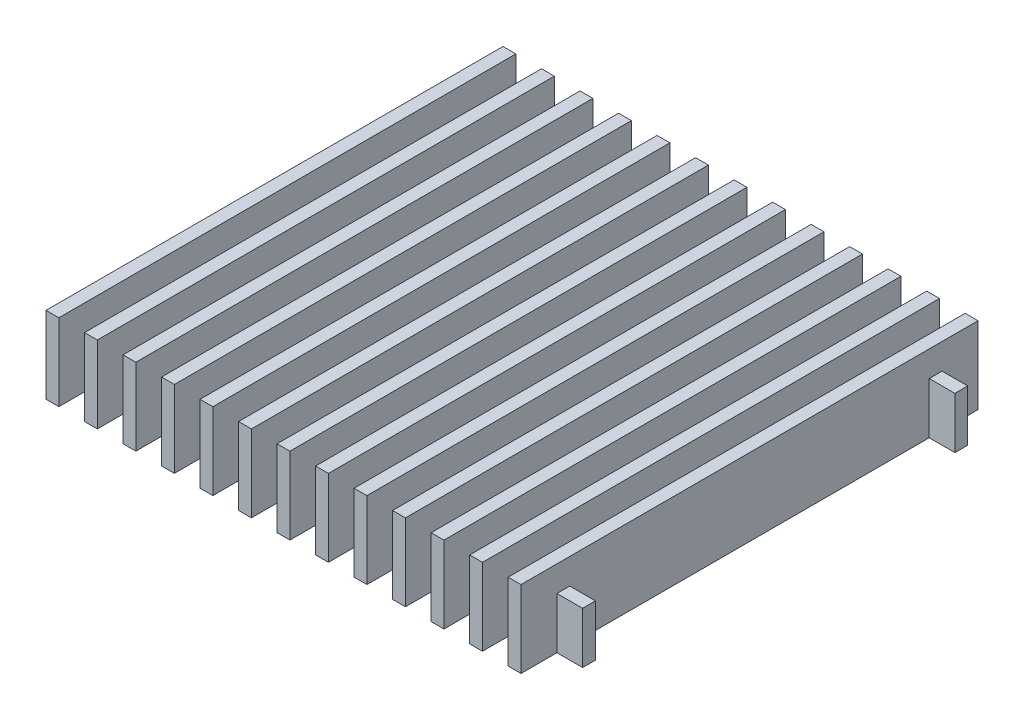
ISO-10303-21;
HEADER;
FILE_DESCRIPTION(('STEP AP214'),'2;1');
FILE_NAME('part.step','',(''),(''),'','','');
FILE_SCHEMA(('AUTOMOTIVE_DESIGN { 1 0 10303 214 1 1 1 1 }'));
ENDSEC;
DATA;
#1=APPLICATION_CONTEXT('core data for automotive mechanical design processes');
#2=APPLICATION_PROTOCOL_DEFINITION('international standard','automotive_design',2000,#1);
#3=PRODUCT_CONTEXT('',#1,'mechanical');
#4=PRODUCT('Part','Part','',(#3));
#5=PRODUCT_RELATED_PRODUCT_CATEGORY('part','',(#4));
#6=PRODUCT_DEFINITION_FORMATION('','',#4);
#7=PRODUCT_DEFINITION_CONTEXT('part definition',#1,'design');
#8=PRODUCT_DEFINITION('design','',#6,#7);
#9=PRODUCT_DEFINITION_SHAPE('','',#8);
#10=(LENGTH_UNIT() NAMED_UNIT(*) SI_UNIT(.MILLI.,.METRE.));
#11=(NAMED_UNIT(*) PLANE_ANGLE_UNIT() SI_UNIT($,.RADIAN.));
#12=(NAMED_UNIT(*) SI_UNIT($,.STERADIAN.) SOLID_ANGLE_UNIT());
#13=UNCERTAINTY_MEASURE_WITH_UNIT(LENGTH_MEASURE(1.E-05),#10,'distance_accuracy_value','');
#14=(GEOMETRIC_REPRESENTATION_CONTEXT(3) GLOBAL_UNCERTAINTY_ASSIGNED_CONTEXT((#13)) GLOBAL_UNIT_ASSIGNED_CONTEXT((#10,
#11,#12)) REPRESENTATION_CONTEXT('',''));
#15=CARTESIAN_POINT('',(0.,0.,0.));
#16=DIRECTION('',(0.,0.,1.));
#17=DIRECTION('',(1.,0.,0.));
#18=AXIS2_PLACEMENT_3D('',#15,#16,#17);
#19=CARTESIAN_POINT('',(0.,3.175,0.));
#20=DIRECTION('',(0.,-1.,0.));
#21=DIRECTION('',(0.,0.,-1.));
#22=AXIS2_PLACEMENT_3D('',#19,#20,#21);
#23=PLANE('',#22);
#24=DIRECTION('',(0.,0.,1.));
#25=VECTOR('',#24,1.);
#26=CARTESIAN_POINT('',(55.5625,3.175,0.));
#27=LINE('',#26,#25);
#28=CARTESIAN_POINT('',(55.5625,3.175,44.45));
#29=VERTEX_POINT('',#28);
#30=CARTESIAN_POINT('',(55.5625,3.175,47.625));
#31=VERTEX_POINT('',#30);
#32=EDGE_CURVE('E1325',#29,#31,#27,.T.);
#33=ORIENTED_EDGE('',*,*,#32,.F.);
#34=DIRECTION('',(1.,0.,0.));
#35=VECTOR('',#34,1.);
#36=CARTESIAN_POINT('',(-65.0875,3.175,44.45));
#37=LINE('',#36,#35);
#38=CARTESIAN_POINT('',(49.2125,3.175,44.45));
#39=VERTEX_POINT('',#38);
#40=EDGE_CURVE('E2155',#39,#29,#37,.T.);
#41=ORIENTED_EDGE('',*,*,#40,.F.);
#42=DIRECTION('',(0.,0.,-1.));
#43=VECTOR('',#42,1.);
#44=CARTESIAN_POINT('',(49.2125,3.175,0.));
#45=LINE('',#44,#43);
#46=CARTESIAN_POINT('',(49.2125,3.175,47.625));
#47=VERTEX_POINT('',#46);
#48=EDGE_CURVE('E1367',#47,#39,#45,.T.);
#49=ORIENTED_EDGE('',*,*,#48,.F.);
#50=DIRECTION('',(-1.,0.,0.));
#51=VECTOR('',#50,1.);
#52=CARTESIAN_POINT('',(-65.0875,3.175,47.625));
#53=LINE('',#52,#51);
#54=EDGE_CURVE('E1891',#31,#47,#53,.T.);
#55=ORIENTED_EDGE('',*,*,#54,.F.);
#56=EDGE_LOOP('',(#33,#41,#49,#55));
#57=FACE_BOUND('',#56,.T.);
#58=ADVANCED_FACE('F33',(#57),#23,.F.);
#59=DIRECTION('',(0.,0.,-1.));
#60=VECTOR('',#59,1.);
#61=CARTESIAN_POINT('',(58.7375,3.175,0.));
#62=LINE('',#61,#60);
#63=CARTESIAN_POINT('',(58.7375,3.175,47.625));
#64=VERTEX_POINT('',#63);
#65=CARTESIAN_POINT('',(58.7375,3.175,44.45));
#66=VERTEX_POINT('',#65);
#67=EDGE_CURVE('E1317',#64,#66,#62,.T.);
#68=ORIENTED_EDGE('',*,*,#67,.F.);
#69=CARTESIAN_POINT('',(65.0875,3.175,47.625));
#70=VERTEX_POINT('',#69);
#71=EDGE_CURVE('E1887',#70,#64,#53,.T.);
#72=ORIENTED_EDGE('',*,*,#71,.F.);
#73=DIRECTION('',(0.,0.,1.));
#74=VECTOR('',#73,1.);
#75=CARTESIAN_POINT('',(65.0875,3.175,47.625));
#76=LINE('',#75,#74);
#77=CARTESIAN_POINT('',(65.0875,3.175,44.45));
#78=VERTEX_POINT('',#77);
#79=EDGE_CURVE('E1882',#78,#70,#76,.T.);
#80=ORIENTED_EDGE('',*,*,#79,.F.);
#81=EDGE_CURVE('E1877',#66,#78,#37,.T.);
#82=ORIENTED_EDGE('',*,*,#81,.F.);
#83=EDGE_LOOP('',(#68,#72,#80,#82));
#84=FACE_BOUND('',#83,.T.);
#85=ADVANCED_FACE('F2172',(#84),#23,.F.);
#86=CARTESIAN_POINT('',(-65.0875,3.175,44.45));
#87=DIRECTION('',(0.,0.,-1.));
#88=DIRECTION('',(-1.,0.,0.));
#89=AXIS2_PLACEMENT_3D('',#86,#87,#88);
#90=PLANE('',#89);
#91=ORIENTED_EDGE('',*,*,#40,.T.);
#92=DIRECTION('',(0.,-1.,0.));
#93=VECTOR('',#92,1.);
#94=CARTESIAN_POINT('',(55.5625,3.175,44.45));
#95=LINE('',#94,#93);
#96=CARTESIAN_POINT('',(55.5625,-9.525,44.45));
#97=VERTEX_POINT('',#96);
#98=EDGE_CURVE('E1327',#29,#97,#95,.T.);
#99=ORIENTED_EDGE('',*,*,#98,.T.);
#100=DIRECTION('',(1.,0.,0.));
#101=VECTOR('',#100,1.);
#102=CARTESIAN_POINT('',(-65.0875,-9.525,44.45));
#103=LINE('',#102,#101);
#104=CARTESIAN_POINT('',(49.2125,-9.525,44.45));
#105=VERTEX_POINT('',#104);
#106=EDGE_CURVE('E2178',#105,#97,#103,.T.);
#107=ORIENTED_EDGE('',*,*,#106,.F.);
#108=DIRECTION('',(0.,1.,0.));
#109=VECTOR('',#108,1.);
#110=CARTESIAN_POINT('',(49.2125,3.175,44.45));
#111=LINE('',#110,#109);
#112=EDGE_CURVE('E1369',#105,#39,#111,.T.);
#113=ORIENTED_EDGE('',*,*,#112,.T.);
#114=EDGE_LOOP('',(#91,#99,#107,#113));
#115=FACE_BOUND('',#114,.T.);
#116=ADVANCED_FACE('F2488',(#115),#90,.T.);
#117=CARTESIAN_POINT('',(58.7375,-9.525,44.45));
#118=VERTEX_POINT('',#117);
#119=CARTESIAN_POINT('',(65.0875,-9.525,44.45));
#120=VERTEX_POINT('',#119);
#121=EDGE_CURVE('E1894',#118,#120,#103,.T.);
#122=ORIENTED_EDGE('',*,*,#121,.F.);
#123=DIRECTION('',(0.,1.,0.));
#124=VECTOR('',#123,1.);
#125=CARTESIAN_POINT('',(58.7375,3.175,44.45));
#126=LINE('',#125,#124);
#127=EDGE_CURVE('E1319',#118,#66,#126,.T.);
#128=ORIENTED_EDGE('',*,*,#127,.T.);
#129=ORIENTED_EDGE('',*,*,#81,.T.);
#130=DIRECTION('',(0.,-1.,0.));
#131=VECTOR('',#130,1.);
#132=CARTESIAN_POINT('',(65.0875,3.175,44.45));
#133=LINE('',#132,#131);
#134=EDGE_CURVE('E1912',#78,#120,#133,.T.);
#135=ORIENTED_EDGE('',*,*,#134,.T.);
#136=EDGE_LOOP('',(#122,#128,#129,#135));
#137=FACE_BOUND('',#136,.T.);
#138=ADVANCED_FACE('F2164',(#137),#90,.T.);
#139=CARTESIAN_POINT('',(-65.0875,3.175,47.625));
#140=DIRECTION('',(0.,0.,1.));
#141=DIRECTION('',(1.,0.,0.));
#142=AXIS2_PLACEMENT_3D('',#139,#140,#141);
#143=PLANE('',#142);
#144=DIRECTION('',(-1.,0.,0.));
#145=VECTOR('',#144,1.);
#146=CARTESIAN_POINT('',(-65.0875,-9.525,47.625));
#147=LINE('',#146,#145);
#148=CARTESIAN_POINT('',(55.5625,-9.525,47.625));
#149=VERTEX_POINT('',#148);
#150=CARTESIAN_POINT('',(49.2125,-9.525,47.625));
#151=VERTEX_POINT('',#150);
#152=EDGE_CURVE('E1905',#149,#151,#147,.T.);
#153=ORIENTED_EDGE('',*,*,#152,.F.);
#154=DIRECTION('',(0.,1.,0.));
#155=VECTOR('',#154,1.);
#156=CARTESIAN_POINT('',(55.5625,3.175,47.625));
#157=LINE('',#156,#155);
#158=EDGE_CURVE('E1322',#149,#31,#157,.T.);
#159=ORIENTED_EDGE('',*,*,#158,.T.);
#160=ORIENTED_EDGE('',*,*,#54,.T.);
#161=DIRECTION('',(0.,-1.,0.));
#162=VECTOR('',#161,1.);
#163=CARTESIAN_POINT('',(49.2125,3.175,47.625));
#164=LINE('',#163,#162);
#165=EDGE_CURVE('E1364',#47,#151,#164,.T.);
#166=ORIENTED_EDGE('',*,*,#165,.T.);
#167=EDGE_LOOP('',(#153,#159,#160,#166));
#168=FACE_BOUND('',#167,.T.);
#169=ADVANCED_FACE('F2145',(#168),#143,.T.);
#170=ORIENTED_EDGE('',*,*,#71,.T.);
#171=DIRECTION('',(0.,-1.,0.));
#172=VECTOR('',#171,1.);
#173=CARTESIAN_POINT('',(58.7375,3.175,47.625));
#174=LINE('',#173,#172);
#175=CARTESIAN_POINT('',(58.7375,-9.525,47.625));
#176=VERTEX_POINT('',#175);
#177=EDGE_CURVE('E1314',#64,#176,#174,.T.);
#178=ORIENTED_EDGE('',*,*,#177,.T.);
#179=CARTESIAN_POINT('',(65.0875,-9.525,47.625));
#180=VERTEX_POINT('',#179);
#181=EDGE_CURVE('E1878',#180,#176,#147,.T.);
#182=ORIENTED_EDGE('',*,*,#181,.F.);
#183=DIRECTION('',(0.,-1.,0.));
#184=VECTOR('',#183,1.);
#185=CARTESIAN_POINT('',(65.0875,3.175,47.625));
#186=LINE('',#185,#184);
#187=EDGE_CURVE('E1910',#70,#180,#186,.T.);
#188=ORIENTED_EDGE('',*,*,#187,.F.);
#189=EDGE_LOOP('',(#170,#178,#182,#188));
#190=FACE_BOUND('',#189,.T.);
#191=ADVANCED_FACE('F2174',(#190),#143,.T.);
#192=DIRECTION('',(0.,0.,1.));
#193=VECTOR('',#192,1.);
#194=CARTESIAN_POINT('',(46.0375,3.175,0.));
#195=LINE('',#194,#193);
#196=CARTESIAN_POINT('',(46.0375,3.175,44.45));
#197=VERTEX_POINT('',#196);
#198=CARTESIAN_POINT('',(46.0375,3.175,47.625));
#199=VERTEX_POINT('',#198);
#200=EDGE_CURVE('E1375',#197,#199,#195,.T.);
#201=ORIENTED_EDGE('',*,*,#200,.F.);
#202=CARTESIAN_POINT('',(39.6875,3.175,44.45));
#203=VERTEX_POINT('',#202);
#204=EDGE_CURVE('E2157',#203,#197,#37,.T.);
#205=ORIENTED_EDGE('',*,*,#204,.F.);
#206=DIRECTION('',(0.,0.,-1.));
#207=VECTOR('',#206,1.);
#208=CARTESIAN_POINT('',(39.6875,3.175,0.));
#209=LINE('',#208,#207);
#210=CARTESIAN_POINT('',(39.6875,3.175,47.625));
#211=VERTEX_POINT('',#210);
#212=EDGE_CURVE('E1417',#211,#203,#209,.T.);
#213=ORIENTED_EDGE('',*,*,#212,.F.);
#214=EDGE_CURVE('E2134',#199,#211,#53,.T.);
#215=ORIENTED_EDGE('',*,*,#214,.F.);
#216=EDGE_LOOP('',(#201,#205,#213,#215));
#217=FACE_BOUND('',#216,.T.);
#218=ADVANCED_FACE('F2489',(#217),#23,.F.);
#219=ORIENTED_EDGE('',*,*,#204,.T.);
#220=DIRECTION('',(0.,-1.,0.));
#221=VECTOR('',#220,1.);
#222=CARTESIAN_POINT('',(46.0375,3.175,44.45));
#223=LINE('',#222,#221);
#224=CARTESIAN_POINT('',(46.0375,-9.525,44.45));
#225=VERTEX_POINT('',#224);
#226=EDGE_CURVE('E1377',#197,#225,#223,.T.);
#227=ORIENTED_EDGE('',*,*,#226,.T.);
#228=CARTESIAN_POINT('',(39.6875,-9.525,44.45));
#229=VERTEX_POINT('',#228);
#230=EDGE_CURVE('E2180',#229,#225,#103,.T.);
#231=ORIENTED_EDGE('',*,*,#230,.F.);
#232=DIRECTION('',(0.,1.,0.));
#233=VECTOR('',#232,1.);
#234=CARTESIAN_POINT('',(39.6875,3.175,44.45));
#235=LINE('',#234,#233);
#236=EDGE_CURVE('E1419',#229,#203,#235,.T.);
#237=ORIENTED_EDGE('',*,*,#236,.T.);
#238=EDGE_LOOP('',(#219,#227,#231,#237));
#239=FACE_BOUND('',#238,.T.);
#240=ADVANCED_FACE('F2944',(#239),#90,.T.);
#241=CARTESIAN_POINT('',(46.0375,-9.525,47.625));
#242=VERTEX_POINT('',#241);
#243=CARTESIAN_POINT('',(39.6875,-9.525,47.625));
#244=VERTEX_POINT('',#243);
#245=EDGE_CURVE('E2444',#242,#244,#147,.T.);
#246=ORIENTED_EDGE('',*,*,#245,.F.);
#247=DIRECTION('',(0.,1.,0.));
#248=VECTOR('',#247,1.);
#249=CARTESIAN_POINT('',(46.0375,3.175,47.625));
#250=LINE('',#249,#248);
#251=EDGE_CURVE('E1372',#242,#199,#250,.T.);
#252=ORIENTED_EDGE('',*,*,#251,.T.);
#253=ORIENTED_EDGE('',*,*,#214,.T.);
#254=DIRECTION('',(0.,-1.,0.));
#255=VECTOR('',#254,1.);
#256=CARTESIAN_POINT('',(39.6875,3.175,47.625));
#257=LINE('',#256,#255);
#258=EDGE_CURVE('E1414',#211,#244,#257,.T.);
#259=ORIENTED_EDGE('',*,*,#258,.T.);
#260=EDGE_LOOP('',(#246,#252,#253,#259));
#261=FACE_BOUND('',#260,.T.);
#262=ADVANCED_FACE('F2936',(#261),#143,.T.);
#263=DIRECTION('',(0.,0.,1.));
#264=VECTOR('',#263,1.);
#265=CARTESIAN_POINT('',(36.5125,3.175,0.));
#266=LINE('',#265,#264);
#267=CARTESIAN_POINT('',(36.5125,3.175,44.45));
#268=VERTEX_POINT('',#267);
#269=CARTESIAN_POINT('',(36.5125,3.175,47.625));
#270=VERTEX_POINT('',#269);
#271=EDGE_CURVE('E1425',#268,#270,#266,.T.);
#272=ORIENTED_EDGE('',*,*,#271,.F.);
#273=CARTESIAN_POINT('',(30.1625,3.175,44.45));
#274=VERTEX_POINT('',#273);
#275=EDGE_CURVE('E2159',#274,#268,#37,.T.);
#276=ORIENTED_EDGE('',*,*,#275,.F.);
#277=DIRECTION('',(0.,0.,-1.));
#278=VECTOR('',#277,1.);
#279=CARTESIAN_POINT('',(30.1625,3.175,0.));
#280=LINE('',#279,#278);
#281=CARTESIAN_POINT('',(30.1625,3.175,47.625));
#282=VERTEX_POINT('',#281);
#283=EDGE_CURVE('E1467',#282,#274,#280,.T.);
#284=ORIENTED_EDGE('',*,*,#283,.F.);
#285=EDGE_CURVE('E2130',#270,#282,#53,.T.);
#286=ORIENTED_EDGE('',*,*,#285,.F.);
#287=EDGE_LOOP('',(#272,#276,#284,#286));
#288=FACE_BOUND('',#287,.T.);
#289=ADVANCED_FACE('F2436',(#288),#23,.F.);
#290=ORIENTED_EDGE('',*,*,#275,.T.);
#291=DIRECTION('',(0.,-1.,0.));
#292=VECTOR('',#291,1.);
#293=CARTESIAN_POINT('',(36.5125,3.175,44.45));
#294=LINE('',#293,#292);
#295=CARTESIAN_POINT('',(36.5125,-9.525,44.45));
#296=VERTEX_POINT('',#295);
#297=EDGE_CURVE('E1427',#268,#296,#294,.T.);
#298=ORIENTED_EDGE('',*,*,#297,.T.);
#299=CARTESIAN_POINT('',(30.1625,-9.525,44.45));
#300=VERTEX_POINT('',#299);
#301=EDGE_CURVE('E2185',#300,#296,#103,.T.);
#302=ORIENTED_EDGE('',*,*,#301,.F.);
#303=DIRECTION('',(0.,1.,0.));
#304=VECTOR('',#303,1.);
#305=CARTESIAN_POINT('',(30.1625,3.175,44.45));
#306=LINE('',#305,#304);
#307=EDGE_CURVE('E1469',#300,#274,#306,.T.);
#308=ORIENTED_EDGE('',*,*,#307,.T.);
#309=EDGE_LOOP('',(#290,#298,#302,#308));
#310=FACE_BOUND('',#309,.T.);
#311=ADVANCED_FACE('F2432',(#310),#90,.T.);
#312=CARTESIAN_POINT('',(36.5125,-9.525,47.625));
#313=VERTEX_POINT('',#312);
#314=CARTESIAN_POINT('',(30.1625,-9.525,47.625));
#315=VERTEX_POINT('',#314);
#316=EDGE_CURVE('E2442',#313,#315,#147,.T.);
#317=ORIENTED_EDGE('',*,*,#316,.F.);
#318=DIRECTION('',(0.,1.,0.));
#319=VECTOR('',#318,1.);
#320=CARTESIAN_POINT('',(36.5125,3.175,47.625));
#321=LINE('',#320,#319);
#322=EDGE_CURVE('E1422',#313,#270,#321,.T.);
#323=ORIENTED_EDGE('',*,*,#322,.T.);
#324=ORIENTED_EDGE('',*,*,#285,.T.);
#325=DIRECTION('',(0.,-1.,0.));
#326=VECTOR('',#325,1.);
#327=CARTESIAN_POINT('',(30.1625,3.175,47.625));
#328=LINE('',#327,#326);
#329=EDGE_CURVE('E1464',#282,#315,#328,.T.);
#330=ORIENTED_EDGE('',*,*,#329,.T.);
#331=EDGE_LOOP('',(#317,#323,#324,#330));
#332=FACE_BOUND('',#331,.T.);
#333=ADVANCED_FACE('F2441',(#332),#143,.T.);
#334=DIRECTION('',(0.,0.,1.));
#335=VECTOR('',#334,1.);
#336=CARTESIAN_POINT('',(26.9875,3.175,0.));
#337=LINE('',#336,#335);
#338=CARTESIAN_POINT('',(26.9875,3.175,44.45));
#339=VERTEX_POINT('',#338);
#340=CARTESIAN_POINT('',(26.9875,3.175,47.625));
#341=VERTEX_POINT('',#340);
#342=EDGE_CURVE('E1475',#339,#341,#337,.T.);
#343=ORIENTED_EDGE('',*,*,#342,.F.);
#344=CARTESIAN_POINT('',(20.6375,3.175,44.45));
#345=VERTEX_POINT('',#344);
#346=EDGE_CURVE('E2423',#345,#339,#37,.T.);
#347=ORIENTED_EDGE('',*,*,#346,.F.);
#348=DIRECTION('',(0.,0.,-1.));
#349=VECTOR('',#348,1.);
#350=CARTESIAN_POINT('',(20.6375,3.175,0.));
#351=LINE('',#350,#349);
#352=CARTESIAN_POINT('',(20.6375,3.175,47.625));
#353=VERTEX_POINT('',#352);
#354=EDGE_CURVE('E1517',#353,#345,#351,.T.);
#355=ORIENTED_EDGE('',*,*,#354,.F.);
#356=EDGE_CURVE('E2126',#341,#353,#53,.T.);
#357=ORIENTED_EDGE('',*,*,#356,.F.);
#358=EDGE_LOOP('',(#343,#347,#355,#357));
#359=FACE_BOUND('',#358,.T.);
#360=ADVANCED_FACE('F2906',(#359),#23,.F.);
#361=ORIENTED_EDGE('',*,*,#346,.T.);
#362=DIRECTION('',(0.,-1.,0.));
#363=VECTOR('',#362,1.);
#364=CARTESIAN_POINT('',(26.9875,3.175,44.45));
#365=LINE('',#364,#363);
#366=CARTESIAN_POINT('',(26.9875,-9.525,44.45));
#367=VERTEX_POINT('',#366);
#368=EDGE_CURVE('E1477',#339,#367,#365,.T.);
#369=ORIENTED_EDGE('',*,*,#368,.T.);
#370=CARTESIAN_POINT('',(20.6375,-9.525,44.45));
#371=VERTEX_POINT('',#370);
#372=EDGE_CURVE('E2190',#371,#367,#103,.T.);
#373=ORIENTED_EDGE('',*,*,#372,.F.);
#374=DIRECTION('',(0.,1.,0.));
#375=VECTOR('',#374,1.);
#376=CARTESIAN_POINT('',(20.6375,3.175,44.45));
#377=LINE('',#376,#375);
#378=EDGE_CURVE('E1519',#371,#345,#377,.T.);
#379=ORIENTED_EDGE('',*,*,#378,.T.);
#380=EDGE_LOOP('',(#361,#369,#373,#379));
#381=FACE_BOUND('',#380,.T.);
#382=ADVANCED_FACE('F2897',(#381),#90,.T.);
#383=CARTESIAN_POINT('',(26.9875,-9.525,47.625));
#384=VERTEX_POINT('',#383);
#385=CARTESIAN_POINT('',(20.6375,-9.525,47.625));
#386=VERTEX_POINT('',#385);
#387=EDGE_CURVE('E2445',#384,#386,#147,.T.);
#388=ORIENTED_EDGE('',*,*,#387,.F.);
#389=DIRECTION('',(0.,1.,0.));
#390=VECTOR('',#389,1.);
#391=CARTESIAN_POINT('',(26.9875,3.175,47.625));
#392=LINE('',#391,#390);
#393=EDGE_CURVE('E1472',#384,#341,#392,.T.);
#394=ORIENTED_EDGE('',*,*,#393,.T.);
#395=ORIENTED_EDGE('',*,*,#356,.T.);
#396=DIRECTION('',(0.,-1.,0.));
#397=VECTOR('',#396,1.);
#398=CARTESIAN_POINT('',(20.6375,3.175,47.625));
#399=LINE('',#398,#397);
#400=EDGE_CURVE('E1514',#353,#386,#399,.T.);
#401=ORIENTED_EDGE('',*,*,#400,.T.);
#402=EDGE_LOOP('',(#388,#394,#395,#401));
#403=FACE_BOUND('',#402,.T.);
#404=ADVANCED_FACE('F2483',(#403),#143,.T.);
#405=DIRECTION('',(0.,0.,1.));
#406=VECTOR('',#405,1.);
#407=CARTESIAN_POINT('',(17.4625,3.175,0.));
#408=LINE('',#407,#406);
#409=CARTESIAN_POINT('',(17.4625,3.175,44.45));
#410=VERTEX_POINT('',#409);
#411=CARTESIAN_POINT('',(17.4625,3.175,47.625));
#412=VERTEX_POINT('',#411);
#413=EDGE_CURVE('E1525',#410,#412,#408,.T.);
#414=ORIENTED_EDGE('',*,*,#413,.F.);
#415=CARTESIAN_POINT('',(11.1125,3.175,44.45));
#416=VERTEX_POINT('',#415);
#417=EDGE_CURVE('E2419',#416,#410,#37,.T.);
#418=ORIENTED_EDGE('',*,*,#417,.F.);
#419=DIRECTION('',(0.,0.,-1.));
#420=VECTOR('',#419,1.);
#421=CARTESIAN_POINT('',(11.1125,3.175,0.));
#422=LINE('',#421,#420);
#423=CARTESIAN_POINT('',(11.1125,3.175,47.625));
#424=VERTEX_POINT('',#423);
#425=EDGE_CURVE('E1567',#424,#416,#422,.T.);
#426=ORIENTED_EDGE('',*,*,#425,.F.);
#427=EDGE_CURVE('E2122',#412,#424,#53,.T.);
#428=ORIENTED_EDGE('',*,*,#427,.F.);
#429=EDGE_LOOP('',(#414,#418,#426,#428));
#430=FACE_BOUND('',#429,.T.);
#431=ADVANCED_FACE('F2883',(#430),#23,.F.);
#432=ORIENTED_EDGE('',*,*,#417,.T.);
#433=DIRECTION('',(0.,-1.,0.));
#434=VECTOR('',#433,1.);
#435=CARTESIAN_POINT('',(17.4625,3.175,44.45));
#436=LINE('',#435,#434);
#437=CARTESIAN_POINT('',(17.4625,-9.525,44.45));
#438=VERTEX_POINT('',#437);
#439=EDGE_CURVE('E1527',#410,#438,#436,.T.);
#440=ORIENTED_EDGE('',*,*,#439,.T.);
#441=CARTESIAN_POINT('',(11.1125,-9.525,44.45));
#442=VERTEX_POINT('',#441);
#443=EDGE_CURVE('E2195',#442,#438,#103,.T.);
#444=ORIENTED_EDGE('',*,*,#443,.F.);
#445=DIRECTION('',(0.,1.,0.));
#446=VECTOR('',#445,1.);
#447=CARTESIAN_POINT('',(11.1125,3.175,44.45));
#448=LINE('',#447,#446);
#449=EDGE_CURVE('E1569',#442,#416,#448,.T.);
#450=ORIENTED_EDGE('',*,*,#449,.T.);
#451=EDGE_LOOP('',(#432,#440,#444,#450));
#452=FACE_BOUND('',#451,.T.);
#453=ADVANCED_FACE('F2478',(#452),#90,.T.);
#454=CARTESIAN_POINT('',(17.4625,-9.525,47.625));
#455=VERTEX_POINT('',#454);
#456=CARTESIAN_POINT('',(11.1125,-9.525,47.625));
#457=VERTEX_POINT('',#456);
#458=EDGE_CURVE('E2446',#455,#457,#147,.T.);
#459=ORIENTED_EDGE('',*,*,#458,.F.);
#460=DIRECTION('',(0.,1.,0.));
#461=VECTOR('',#460,1.);
#462=CARTESIAN_POINT('',(17.4625,3.175,47.625));
#463=LINE('',#462,#461);
#464=EDGE_CURVE('E1522',#455,#412,#463,.T.);
#465=ORIENTED_EDGE('',*,*,#464,.T.);
#466=ORIENTED_EDGE('',*,*,#427,.T.);
#467=DIRECTION('',(0.,-1.,0.));
#468=VECTOR('',#467,1.);
#469=CARTESIAN_POINT('',(11.1125,3.175,47.625));
#470=LINE('',#469,#468);
#471=EDGE_CURVE('E1564',#424,#457,#470,.T.);
#472=ORIENTED_EDGE('',*,*,#471,.T.);
#473=EDGE_LOOP('',(#459,#465,#466,#472));
#474=FACE_BOUND('',#473,.T.);
#475=ADVANCED_FACE('F2467',(#474),#143,.T.);
#476=DIRECTION('',(0.,0.,1.));
#477=VECTOR('',#476,1.);
#478=CARTESIAN_POINT('',(7.93750000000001,3.175,0.));
#479=LINE('',#478,#477);
#480=CARTESIAN_POINT('',(7.93750000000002,3.175,44.45));
#481=VERTEX_POINT('',#480);
#482=CARTESIAN_POINT('',(7.93750000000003,3.175,47.625));
#483=VERTEX_POINT('',#482);
#484=EDGE_CURVE('E1575',#481,#483,#479,.T.);
#485=ORIENTED_EDGE('',*,*,#484,.F.);
#486=CARTESIAN_POINT('',(1.58750000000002,3.175,44.45));
#487=VERTEX_POINT('',#486);
#488=EDGE_CURVE('E2415',#487,#481,#37,.T.);
#489=ORIENTED_EDGE('',*,*,#488,.F.);
#490=DIRECTION('',(0.,0.,-1.));
#491=VECTOR('',#490,1.);
#492=CARTESIAN_POINT('',(1.58750000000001,3.175,0.));
#493=LINE('',#492,#491);
#494=CARTESIAN_POINT('',(1.58750000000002,3.175,47.625));
#495=VERTEX_POINT('',#494);
#496=EDGE_CURVE('E1617',#495,#487,#493,.T.);
#497=ORIENTED_EDGE('',*,*,#496,.F.);
#498=EDGE_CURVE('E2118',#483,#495,#53,.T.);
#499=ORIENTED_EDGE('',*,*,#498,.F.);
#500=EDGE_LOOP('',(#485,#489,#497,#499));
#501=FACE_BOUND('',#500,.T.);
#502=ADVANCED_FACE('F2476',(#501),#23,.F.);
#503=ORIENTED_EDGE('',*,*,#488,.T.);
#504=DIRECTION('',(0.,-1.,0.));
#505=VECTOR('',#504,1.);
#506=CARTESIAN_POINT('',(7.93750000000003,3.175,44.45));
#507=LINE('',#506,#505);
#508=CARTESIAN_POINT('',(7.93750000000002,-9.525,44.45));
#509=VERTEX_POINT('',#508);
#510=EDGE_CURVE('E1577',#481,#509,#507,.T.);
#511=ORIENTED_EDGE('',*,*,#510,.T.);
#512=CARTESIAN_POINT('',(1.58750000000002,-9.525,44.45));
#513=VERTEX_POINT('',#512);
#514=EDGE_CURVE('E2200',#513,#509,#103,.T.);
#515=ORIENTED_EDGE('',*,*,#514,.F.);
#516=DIRECTION('',(0.,1.,0.));
#517=VECTOR('',#516,1.);
#518=CARTESIAN_POINT('',(1.58750000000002,3.175,44.45));
#519=LINE('',#518,#517);
#520=EDGE_CURVE('E1619',#513,#487,#519,.T.);
#521=ORIENTED_EDGE('',*,*,#520,.T.);
#522=EDGE_LOOP('',(#503,#511,#515,#521));
#523=FACE_BOUND('',#522,.T.);
#524=ADVANCED_FACE('F2464',(#523),#90,.T.);
#525=CARTESIAN_POINT('',(7.93750000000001,-9.525,47.625));
#526=VERTEX_POINT('',#525);
#527=CARTESIAN_POINT('',(1.58750000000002,-9.525,47.625));
#528=VERTEX_POINT('',#527);
#529=EDGE_CURVE('E2087',#526,#528,#147,.T.);
#530=ORIENTED_EDGE('',*,*,#529,.F.);
#531=DIRECTION('',(0.,1.,0.));
#532=VECTOR('',#531,1.);
#533=CARTESIAN_POINT('',(7.93750000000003,3.175,47.625));
#534=LINE('',#533,#532);
#535=EDGE_CURVE('E1572',#526,#483,#534,.T.);
#536=ORIENTED_EDGE('',*,*,#535,.T.);
#537=ORIENTED_EDGE('',*,*,#498,.T.);
#538=DIRECTION('',(0.,-1.,0.));
#539=VECTOR('',#538,1.);
#540=CARTESIAN_POINT('',(1.58750000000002,3.175,47.625));
#541=LINE('',#540,#539);
#542=EDGE_CURVE('E1614',#495,#528,#541,.T.);
#543=ORIENTED_EDGE('',*,*,#542,.T.);
#544=EDGE_LOOP('',(#530,#536,#537,#543));
#545=FACE_BOUND('',#544,.T.);
#546=ADVANCED_FACE('F2461',(#545),#143,.T.);
#547=DIRECTION('',(0.,0.,1.));
#548=VECTOR('',#547,1.);
#549=CARTESIAN_POINT('',(-1.58749999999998,3.175,0.));
#550=LINE('',#549,#548);
#551=CARTESIAN_POINT('',(-1.58749999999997,3.175,44.45));
#552=VERTEX_POINT('',#551);
#553=CARTESIAN_POINT('',(-1.58749999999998,3.175,47.625));
#554=VERTEX_POINT('',#553);
#555=EDGE_CURVE('E1625',#552,#554,#550,.T.);
#556=ORIENTED_EDGE('',*,*,#555,.F.);
#557=CARTESIAN_POINT('',(-7.93749999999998,3.175,44.45));
#558=VERTEX_POINT('',#557);
#559=EDGE_CURVE('E2410',#558,#552,#37,.T.);
#560=ORIENTED_EDGE('',*,*,#559,.F.);
#561=DIRECTION('',(0.,0.,-1.));
#562=VECTOR('',#561,1.);
#563=CARTESIAN_POINT('',(-7.93749999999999,3.175,0.));
#564=LINE('',#563,#562);
#565=CARTESIAN_POINT('',(-7.93749999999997,3.175,47.625));
#566=VERTEX_POINT('',#565);
#567=EDGE_CURVE('E1816',#566,#558,#564,.T.);
#568=ORIENTED_EDGE('',*,*,#567,.F.);
#569=EDGE_CURVE('E2110',#554,#566,#53,.T.);
#570=ORIENTED_EDGE('',*,*,#569,.F.);
#571=EDGE_LOOP('',(#556,#560,#568,#570));
#572=FACE_BOUND('',#571,.T.);
#573=ADVANCED_FACE('F2463',(#572),#23,.F.);
#574=ORIENTED_EDGE('',*,*,#559,.T.);
#575=DIRECTION('',(0.,-1.,0.));
#576=VECTOR('',#575,1.);
#577=CARTESIAN_POINT('',(-1.58749999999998,3.175,44.45));
#578=LINE('',#577,#576);
#579=CARTESIAN_POINT('',(-1.58749999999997,-9.525,44.45));
#580=VERTEX_POINT('',#579);
#581=EDGE_CURVE('E1627',#552,#580,#578,.T.);
#582=ORIENTED_EDGE('',*,*,#581,.T.);
#583=CARTESIAN_POINT('',(-7.93749999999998,-9.525,44.45));
#584=VERTEX_POINT('',#583);
#585=EDGE_CURVE('E2205',#584,#580,#103,.T.);
#586=ORIENTED_EDGE('',*,*,#585,.F.);
#587=DIRECTION('',(0.,1.,0.));
#588=VECTOR('',#587,1.);
#589=CARTESIAN_POINT('',(-7.93749999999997,3.175,44.45));
#590=LINE('',#589,#588);
#591=EDGE_CURVE('E1818',#584,#558,#590,.T.);
#592=ORIENTED_EDGE('',*,*,#591,.T.);
#593=EDGE_LOOP('',(#574,#582,#586,#592));
#594=FACE_BOUND('',#593,.T.);
#595=ADVANCED_FACE('F2472',(#594),#90,.T.);
#596=CARTESIAN_POINT('',(-1.58749999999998,-9.525,47.625));
#597=VERTEX_POINT('',#596);
#598=CARTESIAN_POINT('',(-7.93749999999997,-9.525,47.625));
#599=VERTEX_POINT('',#598);
#600=EDGE_CURVE('E2083',#597,#599,#147,.T.);
#601=ORIENTED_EDGE('',*,*,#600,.F.);
#602=DIRECTION('',(0.,1.,0.));
#603=VECTOR('',#602,1.);
#604=CARTESIAN_POINT('',(-1.58749999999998,3.175,47.625));
#605=LINE('',#604,#603);
#606=EDGE_CURVE('E1622',#597,#554,#605,.T.);
#607=ORIENTED_EDGE('',*,*,#606,.T.);
#608=ORIENTED_EDGE('',*,*,#569,.T.);
#609=DIRECTION('',(0.,-1.,0.));
#610=VECTOR('',#609,1.);
#611=CARTESIAN_POINT('',(-7.93749999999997,3.175,47.625));
#612=LINE('',#611,#610);
#613=EDGE_CURVE('E1813',#566,#599,#612,.T.);
#614=ORIENTED_EDGE('',*,*,#613,.T.);
#615=EDGE_LOOP('',(#601,#607,#608,#614));
#616=FACE_BOUND('',#615,.T.);
#617=ADVANCED_FACE('F2466',(#616),#143,.T.);
#618=DIRECTION('',(0.,0.,1.));
#619=VECTOR('',#618,1.);
#620=CARTESIAN_POINT('',(-20.6375,3.175,0.));
#621=LINE('',#620,#619);
#622=CARTESIAN_POINT('',(-20.6375,3.175,44.45));
#623=VERTEX_POINT('',#622);
#624=CARTESIAN_POINT('',(-20.6375,3.175,47.625));
#625=VERTEX_POINT('',#624);
#626=EDGE_CURVE('E1674',#623,#625,#621,.T.);
#627=ORIENTED_EDGE('',*,*,#626,.F.);
#628=CARTESIAN_POINT('',(-26.9875,3.175,44.45));
#629=VERTEX_POINT('',#628);
#630=EDGE_CURVE('E2412',#629,#623,#37,.T.);
#631=ORIENTED_EDGE('',*,*,#630,.F.);
#632=DIRECTION('',(0.,0.,-1.));
#633=VECTOR('',#632,1.);
#634=CARTESIAN_POINT('',(-26.9875,3.175,0.));
#635=LINE('',#634,#633);
#636=CARTESIAN_POINT('',(-26.9875,3.175,47.625));
#637=VERTEX_POINT('',#636);
#638=EDGE_CURVE('E1716',#637,#629,#635,.T.);
#639=ORIENTED_EDGE('',*,*,#638,.F.);
#640=EDGE_CURVE('E2107',#625,#637,#53,.T.);
#641=ORIENTED_EDGE('',*,*,#640,.F.);
#642=EDGE_LOOP('',(#627,#631,#639,#641));
#643=FACE_BOUND('',#642,.T.);
#644=ADVANCED_FACE('F2475',(#643),#23,.F.);
#645=DIRECTION('',(0.,0.,-1.));
#646=VECTOR('',#645,1.);
#647=CARTESIAN_POINT('',(-17.4625,3.175,0.));
#648=LINE('',#647,#646);
#649=CARTESIAN_POINT('',(-17.4625,3.175,47.625));
#650=VERTEX_POINT('',#649);
#651=CARTESIAN_POINT('',(-17.4625,3.175,44.45));
#652=VERTEX_POINT('',#651);
#653=EDGE_CURVE('E1666',#650,#652,#648,.T.);
#654=ORIENTED_EDGE('',*,*,#653,.F.);
#655=CARTESIAN_POINT('',(-11.1125,3.175,47.625));
#656=VERTEX_POINT('',#655);
#657=EDGE_CURVE('E2109',#656,#650,#53,.T.);
#658=ORIENTED_EDGE('',*,*,#657,.F.);
#659=DIRECTION('',(0.,0.,1.));
#660=VECTOR('',#659,1.);
#661=CARTESIAN_POINT('',(-11.1125,3.175,0.));
#662=LINE('',#661,#660);
#663=CARTESIAN_POINT('',(-11.1125,3.175,44.45));
#664=VERTEX_POINT('',#663);
#665=EDGE_CURVE('E1824',#664,#656,#662,.T.);
#666=ORIENTED_EDGE('',*,*,#665,.F.);
#667=EDGE_CURVE('E2414',#652,#664,#37,.T.);
#668=ORIENTED_EDGE('',*,*,#667,.F.);
#669=EDGE_LOOP('',(#654,#658,#666,#668));
#670=FACE_BOUND('',#669,.T.);
#671=ADVANCED_FACE('F2511',(#670),#23,.F.);
#672=ORIENTED_EDGE('',*,*,#630,.T.);
#673=DIRECTION('',(0.,-1.,0.));
#674=VECTOR('',#673,1.);
#675=CARTESIAN_POINT('',(-20.6375,3.175,44.45));
#676=LINE('',#675,#674);
#677=CARTESIAN_POINT('',(-20.6375,-9.525,44.45));
#678=VERTEX_POINT('',#677);
#679=EDGE_CURVE('E1676',#623,#678,#676,.T.);
#680=ORIENTED_EDGE('',*,*,#679,.T.);
#681=CARTESIAN_POINT('',(-26.9875,-9.525,44.45));
#682=VERTEX_POINT('',#681);
#683=EDGE_CURVE('E2214',#682,#678,#103,.T.);
#684=ORIENTED_EDGE('',*,*,#683,.F.);
#685=DIRECTION('',(0.,1.,0.));
#686=VECTOR('',#685,1.);
#687=CARTESIAN_POINT('',(-26.9875,3.175,44.45));
#688=LINE('',#687,#686);
#689=EDGE_CURVE('E1718',#682,#629,#688,.T.);
#690=ORIENTED_EDGE('',*,*,#689,.T.);
#691=EDGE_LOOP('',(#672,#680,#684,#690));
#692=FACE_BOUND('',#691,.T.);
#693=ADVANCED_FACE('F2519',(#692),#90,.T.);
#694=CARTESIAN_POINT('',(-17.4625,-9.525,44.45));
#695=VERTEX_POINT('',#694);
#696=CARTESIAN_POINT('',(-11.1125,-9.525,44.45));
#697=VERTEX_POINT('',#696);
#698=EDGE_CURVE('E2206',#695,#697,#103,.T.);
#699=ORIENTED_EDGE('',*,*,#698,.F.);
#700=DIRECTION('',(0.,1.,0.));
#701=VECTOR('',#700,1.);
#702=CARTESIAN_POINT('',(-17.4625,3.175,44.45));
#703=LINE('',#702,#701);
#704=EDGE_CURVE('E1668',#695,#652,#703,.T.);
#705=ORIENTED_EDGE('',*,*,#704,.T.);
#706=ORIENTED_EDGE('',*,*,#667,.T.);
#707=DIRECTION('',(0.,-1.,0.));
#708=VECTOR('',#707,1.);
#709=CARTESIAN_POINT('',(-11.1125,3.175,44.45));
#710=LINE('',#709,#708);
#711=EDGE_CURVE('E1826',#664,#697,#710,.T.);
#712=ORIENTED_EDGE('',*,*,#711,.T.);
#713=EDGE_LOOP('',(#699,#705,#706,#712));
#714=FACE_BOUND('',#713,.T.);
#715=ADVANCED_FACE('F2517',(#714),#90,.T.);
#716=CARTESIAN_POINT('',(-20.6375,-9.525,47.625));
#717=VERTEX_POINT('',#716);
#718=CARTESIAN_POINT('',(-26.9875,-9.525,47.625));
#719=VERTEX_POINT('',#718);
#720=EDGE_CURVE('E2084',#717,#719,#147,.T.);
#721=ORIENTED_EDGE('',*,*,#720,.F.);
#722=DIRECTION('',(0.,1.,0.));
#723=VECTOR('',#722,1.);
#724=CARTESIAN_POINT('',(-20.6375,3.175,47.625));
#725=LINE('',#724,#723);
#726=EDGE_CURVE('E1671',#717,#625,#725,.T.);
#727=ORIENTED_EDGE('',*,*,#726,.T.);
#728=ORIENTED_EDGE('',*,*,#640,.T.);
#729=DIRECTION('',(0.,-1.,0.));
#730=VECTOR('',#729,1.);
#731=CARTESIAN_POINT('',(-26.9875,3.175,47.625));
#732=LINE('',#731,#730);
#733=EDGE_CURVE('E1713',#637,#719,#732,.T.);
#734=ORIENTED_EDGE('',*,*,#733,.T.);
#735=EDGE_LOOP('',(#721,#727,#728,#734));
#736=FACE_BOUND('',#735,.T.);
#737=ADVANCED_FACE('F2481',(#736),#143,.T.);
#738=ORIENTED_EDGE('',*,*,#657,.T.);
#739=DIRECTION('',(0.,-1.,0.));
#740=VECTOR('',#739,1.);
#741=CARTESIAN_POINT('',(-17.4625,3.175,47.625));
#742=LINE('',#741,#740);
#743=CARTESIAN_POINT('',(-17.4625,-9.525,47.625));
#744=VERTEX_POINT('',#743);
#745=EDGE_CURVE('E1663',#650,#744,#742,.T.);
#746=ORIENTED_EDGE('',*,*,#745,.T.);
#747=CARTESIAN_POINT('',(-11.1125,-9.525,47.625));
#748=VERTEX_POINT('',#747);
#749=EDGE_CURVE('E2078',#748,#744,#147,.T.);
#750=ORIENTED_EDGE('',*,*,#749,.F.);
#751=DIRECTION('',(0.,1.,0.));
#752=VECTOR('',#751,1.);
#753=CARTESIAN_POINT('',(-11.1125,3.175,47.625));
#754=LINE('',#753,#752);
#755=EDGE_CURVE('E1821',#748,#656,#754,.T.);
#756=ORIENTED_EDGE('',*,*,#755,.T.);
#757=EDGE_LOOP('',(#738,#746,#750,#756));
#758=FACE_BOUND('',#757,.T.);
#759=ADVANCED_FACE('F2509',(#758),#143,.T.);
#760=DIRECTION('',(0.,0.,1.));
#761=VECTOR('',#760,1.);
#762=CARTESIAN_POINT('',(-30.1625,3.175,0.));
#763=LINE('',#762,#761);
#764=CARTESIAN_POINT('',(-30.1625,3.175,44.45));
#765=VERTEX_POINT('',#764);
#766=CARTESIAN_POINT('',(-30.1625,3.175,47.625));
#767=VERTEX_POINT('',#766);
#768=EDGE_CURVE('E1724',#765,#767,#763,.T.);
#769=ORIENTED_EDGE('',*,*,#768,.F.);
#770=CARTESIAN_POINT('',(-36.5125,3.175,44.45));
#771=VERTEX_POINT('',#770);
#772=EDGE_CURVE('E2409',#771,#765,#37,.T.);
#773=ORIENTED_EDGE('',*,*,#772,.F.);
#774=DIRECTION('',(0.,0.,-1.));
#775=VECTOR('',#774,1.);
#776=CARTESIAN_POINT('',(-36.5125,3.175,0.));
#777=LINE('',#776,#775);
#778=CARTESIAN_POINT('',(-36.5125,3.175,47.625));
#779=VERTEX_POINT('',#778);
#780=EDGE_CURVE('E1766',#779,#771,#777,.T.);
#781=ORIENTED_EDGE('',*,*,#780,.F.);
#782=EDGE_CURVE('E2104',#767,#779,#53,.T.);
#783=ORIENTED_EDGE('',*,*,#782,.F.);
#784=EDGE_LOOP('',(#769,#773,#781,#783));
#785=FACE_BOUND('',#784,.T.);
#786=ADVANCED_FACE('F2503',(#785),#23,.F.);
#787=ORIENTED_EDGE('',*,*,#772,.T.);
#788=DIRECTION('',(0.,-1.,0.));
#789=VECTOR('',#788,1.);
#790=CARTESIAN_POINT('',(-30.1625,3.175,44.45));
#791=LINE('',#790,#789);
#792=CARTESIAN_POINT('',(-30.1625,-9.525,44.45));
#793=VERTEX_POINT('',#792);
#794=EDGE_CURVE('E1726',#765,#793,#791,.T.);
#795=ORIENTED_EDGE('',*,*,#794,.T.);
#796=CARTESIAN_POINT('',(-36.5125,-9.525,44.45));
#797=VERTEX_POINT('',#796);
#798=EDGE_CURVE('E2212',#797,#793,#103,.T.);
#799=ORIENTED_EDGE('',*,*,#798,.F.);
#800=DIRECTION('',(0.,1.,0.));
#801=VECTOR('',#800,1.);
#802=CARTESIAN_POINT('',(-36.5125,3.175,44.45));
#803=LINE('',#802,#801);
#804=EDGE_CURVE('E1768',#797,#771,#803,.T.);
#805=ORIENTED_EDGE('',*,*,#804,.T.);
#806=EDGE_LOOP('',(#787,#795,#799,#805));
#807=FACE_BOUND('',#806,.T.);
#808=ADVANCED_FACE('F2508',(#807),#90,.T.);
#809=CARTESIAN_POINT('',(-30.1625,-9.525,47.625));
#810=VERTEX_POINT('',#809);
#811=CARTESIAN_POINT('',(-36.5125,-9.525,47.625));
#812=VERTEX_POINT('',#811);
#813=EDGE_CURVE('E2081',#810,#812,#147,.T.);
#814=ORIENTED_EDGE('',*,*,#813,.F.);
#815=DIRECTION('',(0.,1.,0.));
#816=VECTOR('',#815,1.);
#817=CARTESIAN_POINT('',(-30.1625,3.175,47.625));
#818=LINE('',#817,#816);
#819=EDGE_CURVE('E1721',#810,#767,#818,.T.);
#820=ORIENTED_EDGE('',*,*,#819,.T.);
#821=ORIENTED_EDGE('',*,*,#782,.T.);
#822=DIRECTION('',(0.,-1.,0.));
#823=VECTOR('',#822,1.);
#824=CARTESIAN_POINT('',(-36.5125,3.175,47.625));
#825=LINE('',#824,#823);
#826=EDGE_CURVE('E1763',#779,#812,#825,.T.);
#827=ORIENTED_EDGE('',*,*,#826,.T.);
#828=EDGE_LOOP('',(#814,#820,#821,#827));
#829=FACE_BOUND('',#828,.T.);
#830=ADVANCED_FACE('F2102',(#829),#143,.T.);
#831=DIRECTION('',(0.,0.,1.));
#832=VECTOR('',#831,1.);
#833=CARTESIAN_POINT('',(-39.6875,3.175,0.));
#834=LINE('',#833,#832);
#835=CARTESIAN_POINT('',(-39.6875,3.175,44.45));
#836=VERTEX_POINT('',#835);
#837=CARTESIAN_POINT('',(-39.6875,3.175,47.625));
#838=VERTEX_POINT('',#837);
#839=EDGE_CURVE('E1774',#836,#838,#834,.T.);
#840=ORIENTED_EDGE('',*,*,#839,.F.);
#841=CARTESIAN_POINT('',(-46.0375,3.175,44.45));
#842=VERTEX_POINT('',#841);
#843=EDGE_CURVE('E2407',#842,#836,#37,.T.);
#844=ORIENTED_EDGE('',*,*,#843,.F.);
#845=DIRECTION('',(0.,0.,-1.));
#846=VECTOR('',#845,1.);
#847=CARTESIAN_POINT('',(-46.0375,3.175,0.));
#848=LINE('',#847,#846);
#849=CARTESIAN_POINT('',(-46.0375,3.175,47.625));
#850=VERTEX_POINT('',#849);
#851=EDGE_CURVE('E1863',#850,#842,#848,.T.);
#852=ORIENTED_EDGE('',*,*,#851,.F.);
#853=EDGE_CURVE('E2108',#838,#850,#53,.T.);
#854=ORIENTED_EDGE('',*,*,#853,.F.);
#855=EDGE_LOOP('',(#840,#844,#852,#854));
#856=FACE_BOUND('',#855,.T.);
#857=ADVANCED_FACE('F2405',(#856),#23,.F.);
#858=ORIENTED_EDGE('',*,*,#843,.T.);
#859=DIRECTION('',(0.,-1.,0.));
#860=VECTOR('',#859,1.);
#861=CARTESIAN_POINT('',(-39.6875,3.175,44.45));
#862=LINE('',#861,#860);
#863=CARTESIAN_POINT('',(-39.6875,-9.525,44.45));
#864=VERTEX_POINT('',#863);
#865=EDGE_CURVE('E1776',#836,#864,#862,.T.);
#866=ORIENTED_EDGE('',*,*,#865,.T.);
#867=CARTESIAN_POINT('',(-46.0375,-9.525,44.45));
#868=VERTEX_POINT('',#867);
#869=EDGE_CURVE('E2211',#868,#864,#103,.T.);
#870=ORIENTED_EDGE('',*,*,#869,.F.);
#871=DIRECTION('',(0.,1.,0.));
#872=VECTOR('',#871,1.);
#873=CARTESIAN_POINT('',(-46.0375,3.175,44.45));
#874=LINE('',#873,#872);
#875=EDGE_CURVE('E1865',#868,#842,#874,.T.);
#876=ORIENTED_EDGE('',*,*,#875,.T.);
#877=EDGE_LOOP('',(#858,#866,#870,#876));
#878=FACE_BOUND('',#877,.T.);
#879=ADVANCED_FACE('F2501',(#878),#90,.T.);
#880=CARTESIAN_POINT('',(-39.6875,-9.525,47.625));
#881=VERTEX_POINT('',#880);
#882=CARTESIAN_POINT('',(-46.0375,-9.525,47.625));
#883=VERTEX_POINT('',#882);
#884=EDGE_CURVE('E2077',#881,#883,#147,.T.);
#885=ORIENTED_EDGE('',*,*,#884,.F.);
#886=DIRECTION('',(0.,1.,0.));
#887=VECTOR('',#886,1.);
#888=CARTESIAN_POINT('',(-39.6875,3.175,47.625));
#889=LINE('',#888,#887);
#890=EDGE_CURVE('E1771',#881,#838,#889,.T.);
#891=ORIENTED_EDGE('',*,*,#890,.T.);
#892=ORIENTED_EDGE('',*,*,#853,.T.);
#893=DIRECTION('',(0.,-1.,0.));
#894=VECTOR('',#893,1.);
#895=CARTESIAN_POINT('',(-46.0375,3.175,47.625));
#896=LINE('',#895,#894);
#897=EDGE_CURVE('E1966',#850,#883,#896,.T.);
#898=ORIENTED_EDGE('',*,*,#897,.T.);
#899=EDGE_LOOP('',(#885,#891,#892,#898));
#900=FACE_BOUND('',#899,.T.);
#901=ADVANCED_FACE('F2400',(#900),#143,.T.);
#902=DIRECTION('',(0.,0.,1.));
#903=VECTOR('',#902,1.);
#904=CARTESIAN_POINT('',(-49.2125,3.175,0.));
#905=LINE('',#904,#903);
#906=CARTESIAN_POINT('',(-49.2125,3.175,44.45));
#907=VERTEX_POINT('',#906);
#908=CARTESIAN_POINT('',(-49.2125,3.175,47.625));
#909=VERTEX_POINT('',#908);
#910=EDGE_CURVE('E1868',#907,#909,#905,.T.);
#911=ORIENTED_EDGE('',*,*,#910,.F.);
#912=CARTESIAN_POINT('',(-55.5625,3.175,44.45));
#913=VERTEX_POINT('',#912);
#914=EDGE_CURVE('E1883',#913,#907,#37,.T.);
#915=ORIENTED_EDGE('',*,*,#914,.F.);
#916=DIRECTION('',(0.,0.,1.));
#917=VECTOR('',#916,1.);
#918=CARTESIAN_POINT('',(-55.5625,3.175,-56.515));
#919=LINE('',#918,#917);
#920=CARTESIAN_POINT('',(-55.5625,3.175,47.625));
#921=VERTEX_POINT('',#920);
#922=EDGE_CURVE('E1963',#913,#921,#919,.T.);
#923=ORIENTED_EDGE('',*,*,#922,.T.);
#924=EDGE_CURVE('E2111',#909,#921,#53,.T.);
#925=ORIENTED_EDGE('',*,*,#924,.F.);
#926=EDGE_LOOP('',(#911,#915,#923,#925));
#927=FACE_BOUND('',#926,.T.);
#928=ADVANCED_FACE('F2242',(#927),#23,.F.);
#929=ORIENTED_EDGE('',*,*,#914,.T.);
#930=DIRECTION('',(0.,-1.,0.));
#931=VECTOR('',#930,1.);
#932=CARTESIAN_POINT('',(-49.2125,3.175,44.45));
#933=LINE('',#932,#931);
#934=CARTESIAN_POINT('',(-49.2125,-9.525,44.45));
#935=VERTEX_POINT('',#934);
#936=EDGE_CURVE('E1870',#907,#935,#933,.T.);
#937=ORIENTED_EDGE('',*,*,#936,.T.);
#938=CARTESIAN_POINT('',(-55.5625,-9.525,44.45));
#939=VERTEX_POINT('',#938);
#940=EDGE_CURVE('E1899',#939,#935,#103,.T.);
#941=ORIENTED_EDGE('',*,*,#940,.F.);
#942=DIRECTION('',(0.,-1.,0.));
#943=VECTOR('',#942,1.);
#944=CARTESIAN_POINT('',(-55.5625,9.525,44.45));
#945=LINE('',#944,#943);
#946=EDGE_CURVE('E1909',#913,#939,#945,.T.);
#947=ORIENTED_EDGE('',*,*,#946,.F.);
#948=EDGE_LOOP('',(#929,#937,#941,#947));
#949=FACE_BOUND('',#948,.T.);
#950=ADVANCED_FACE('F2236',(#949),#90,.T.);
#951=CARTESIAN_POINT('',(-49.2125,-9.525,47.625));
#952=VERTEX_POINT('',#951);
#953=CARTESIAN_POINT('',(-55.5625,-9.525,47.625));
#954=VERTEX_POINT('',#953);
#955=EDGE_CURVE('E2076',#952,#954,#147,.T.);
#956=ORIENTED_EDGE('',*,*,#955,.F.);
#957=DIRECTION('',(0.,1.,0.));
#958=VECTOR('',#957,1.);
#959=CARTESIAN_POINT('',(-49.2125,3.175,47.625));
#960=LINE('',#959,#958);
#961=EDGE_CURVE('E1969',#952,#909,#960,.T.);
#962=ORIENTED_EDGE('',*,*,#961,.T.);
#963=ORIENTED_EDGE('',*,*,#924,.T.);
#964=DIRECTION('',(0.,1.,0.));
#965=VECTOR('',#964,1.);
#966=CARTESIAN_POINT('',(-55.5625,9.525,47.625));
#967=LINE('',#966,#965);
#968=EDGE_CURVE('E1920',#954,#921,#967,.T.);
#969=ORIENTED_EDGE('',*,*,#968,.F.);
#970=EDGE_LOOP('',(#956,#962,#963,#969));
#971=FACE_BOUND('',#970,.T.);
#972=ADVANCED_FACE('F2245',(#971),#143,.T.);
#973=CARTESIAN_POINT('',(-58.7375,9.525,-56.515));
#974=DIRECTION('',(1.,0.,0.));
#975=DIRECTION('',(0.,0.,-1.));
#976=AXIS2_PLACEMENT_3D('',#973,#974,#975);
#977=PLANE('',#976);
#978=DIRECTION('',(0.,0.,-1.));
#979=VECTOR('',#978,1.);
#980=CARTESIAN_POINT('',(-58.7375,3.175,-56.515));
#981=LINE('',#980,#979);
#982=CARTESIAN_POINT('',(-58.7375,3.175,-44.45));
#983=VERTEX_POINT('',#982);
#984=CARTESIAN_POINT('',(-58.7375,3.175,-47.625));
#985=VERTEX_POINT('',#984);
#986=EDGE_CURVE('E52',#983,#985,#981,.T.);
#987=ORIENTED_EDGE('',*,*,#986,.F.);
#988=DIRECTION('',(0.,-1.,0.));
#989=VECTOR('',#988,1.);
#990=CARTESIAN_POINT('',(-58.7375,9.525,-44.45));
#991=LINE('',#990,#989);
#992=CARTESIAN_POINT('',(-58.7375,-9.525,-44.45));
#993=VERTEX_POINT('',#992);
#994=EDGE_CURVE('E1279',#983,#993,#991,.T.);
#995=ORIENTED_EDGE('',*,*,#994,.T.);
#996=DIRECTION('',(0.,0.,1.));
#997=VECTOR('',#996,1.);
#998=CARTESIAN_POINT('',(-58.7375,-9.525,-56.515));
#999=LINE('',#998,#997);
#1000=CARTESIAN_POINT('',(-58.7375,-9.525,44.45));
#1001=VERTEX_POINT('',#1000);
#1002=EDGE_CURVE('E1944',#993,#1001,#999,.T.);
#1003=ORIENTED_EDGE('',*,*,#1002,.T.);
#1004=DIRECTION('',(0.,1.,0.));
#1005=VECTOR('',#1004,1.);
#1006=CARTESIAN_POINT('',(-58.7375,9.525,44.45));
#1007=LINE('',#1006,#1005);
#1008=CARTESIAN_POINT('',(-58.7375,3.175,44.45));
#1009=VERTEX_POINT('',#1008);
#1010=EDGE_CURVE('E1918',#1001,#1009,#1007,.T.);
#1011=ORIENTED_EDGE('',*,*,#1010,.T.);
#1012=DIRECTION('',(0.,0.,-1.));
#1013=VECTOR('',#1012,1.);
#1014=CARTESIAN_POINT('',(-58.7375,3.175,-56.515));
#1015=LINE('',#1014,#1013);
#1016=CARTESIAN_POINT('',(-58.7375,3.175,47.625));
#1017=VERTEX_POINT('',#1016);
#1018=EDGE_CURVE('E1926',#1017,#1009,#1015,.T.);
#1019=ORIENTED_EDGE('',*,*,#1018,.F.);
#1020=DIRECTION('',(0.,-1.,0.));
#1021=VECTOR('',#1020,1.);
#1022=CARTESIAN_POINT('',(-58.7375,9.525,47.625));
#1023=LINE('',#1022,#1021);
#1024=CARTESIAN_POINT('',(-58.7375,-9.525,47.625));
#1025=VERTEX_POINT('',#1024);
#1026=EDGE_CURVE('E1923',#1017,#1025,#1023,.T.);
#1027=ORIENTED_EDGE('',*,*,#1026,.T.);
#1028=CARTESIAN_POINT('',(-58.7375,-9.525,56.515));
#1029=VERTEX_POINT('',#1028);
#1030=EDGE_CURVE('E1929',#1025,#1029,#999,.T.);
#1031=ORIENTED_EDGE('',*,*,#1030,.T.);
#1032=DIRECTION('',(0.,-1.,0.));
#1033=VECTOR('',#1032,1.);
#1034=CARTESIAN_POINT('',(-58.7375,9.525,56.515));
#1035=LINE('',#1034,#1033);
#1036=CARTESIAN_POINT('',(-58.7375,9.525,56.515));
#1037=VERTEX_POINT('',#1036);
#1038=EDGE_CURVE('E1960',#1037,#1029,#1035,.T.);
#1039=ORIENTED_EDGE('',*,*,#1038,.F.);
#1040=DIRECTION('',(0.,0.,1.));
#1041=VECTOR('',#1040,1.);
#1042=CARTESIAN_POINT('',(-58.7375,9.525,-56.515));
#1043=LINE('',#1042,#1041);
#1044=CARTESIAN_POINT('',(-58.7375,9.525,-56.515));
#1045=VERTEX_POINT('',#1044);
#1046=EDGE_CURVE('E1930',#1045,#1037,#1043,.T.);
#1047=ORIENTED_EDGE('',*,*,#1046,.F.);
#1048=DIRECTION('',(0.,-1.,0.));
#1049=VECTOR('',#1048,1.);
#1050=CARTESIAN_POINT('',(-58.7375,9.525,-56.515));
#1051=LINE('',#1050,#1049);
#1052=CARTESIAN_POINT('',(-58.7375,-9.525,-56.515));
#1053=VERTEX_POINT('',#1052);
#1054=EDGE_CURVE('E1940',#1045,#1053,#1051,.T.);
#1055=ORIENTED_EDGE('',*,*,#1054,.T.);
#1056=CARTESIAN_POINT('',(-58.7375,-9.525,-47.625));
#1057=VERTEX_POINT('',#1056);
#1058=EDGE_CURVE('E1941',#1053,#1057,#999,.T.);
#1059=ORIENTED_EDGE('',*,*,#1058,.T.);
#1060=DIRECTION('',(0.,1.,0.));
#1061=VECTOR('',#1060,1.);
#1062=CARTESIAN_POINT('',(-58.7375,9.525,-47.625));
#1063=LINE('',#1062,#1061);
#1064=EDGE_CURVE('E48',#1057,#985,#1063,.T.);
#1065=ORIENTED_EDGE('',*,*,#1064,.T.);
#1066=EDGE_LOOP('',(#987,#995,#1003,#1011,#1019,#1027,#1031,#1039,#1047,#1055,#1059,#1065));
#1067=FACE_BOUND('',#1066,.T.);
#1068=ADVANCED_FACE('F35',(#1067),#977,.F.);
#1069=CARTESIAN_POINT('',(-58.7375,9.525,56.515));
#1070=DIRECTION('',(0.,0.,-1.));
#1071=DIRECTION('',(-1.,0.,0.));
#1072=AXIS2_PLACEMENT_3D('',#1069,#1070,#1071);
#1073=PLANE('',#1072);
#1074=DIRECTION('',(1.,0.,0.));
#1075=VECTOR('',#1074,1.);
#1076=CARTESIAN_POINT('',(-58.7375,-9.525,56.515));
#1077=LINE('',#1076,#1075);
#1078=CARTESIAN_POINT('',(-55.5625,-9.525,56.515));
#1079=VERTEX_POINT('',#1078);
#1080=EDGE_CURVE('E1943',#1029,#1079,#1077,.T.);
#1081=ORIENTED_EDGE('',*,*,#1080,.T.);
#1082=DIRECTION('',(0.,-1.,0.));
#1083=VECTOR('',#1082,1.);
#1084=CARTESIAN_POINT('',(-55.5625,9.525,56.515));
#1085=LINE('',#1084,#1083);
#1086=CARTESIAN_POINT('',(-55.5625,9.525,56.515));
#1087=VERTEX_POINT('',#1086);
#1088=EDGE_CURVE('E1957',#1087,#1079,#1085,.T.);
#1089=ORIENTED_EDGE('',*,*,#1088,.F.);
#1090=DIRECTION('',(1.,0.,0.));
#1091=VECTOR('',#1090,1.);
#1092=CARTESIAN_POINT('',(-58.7375,9.525,56.515));
#1093=LINE('',#1092,#1091);
#1094=EDGE_CURVE('E1933',#1037,#1087,#1093,.T.);
#1095=ORIENTED_EDGE('',*,*,#1094,.F.);
#1096=ORIENTED_EDGE('',*,*,#1038,.T.);
#1097=EDGE_LOOP('',(#1081,#1089,#1095,#1096));
#1098=FACE_BOUND('',#1097,.T.);
#1099=ADVANCED_FACE('F2253',(#1098),#1073,.F.);
#1100=CARTESIAN_POINT('',(-55.5625,9.525,-56.515));
#1101=DIRECTION('',(-1.,0.,0.));
#1102=DIRECTION('',(0.,0.,1.));
#1103=AXIS2_PLACEMENT_3D('',#1100,#1101,#1102);
#1104=PLANE('',#1103);
#1105=DIRECTION('',(0.,0.,-1.));
#1106=VECTOR('',#1105,1.);
#1107=CARTESIAN_POINT('',(-55.5625,-9.525,-56.515));
#1108=LINE('',#1107,#1106);
#1109=CARTESIAN_POINT('',(-55.5625,-9.525,-44.45));
#1110=VERTEX_POINT('',#1109);
#1111=EDGE_CURVE('E1950',#939,#1110,#1108,.T.);
#1112=ORIENTED_EDGE('',*,*,#1111,.T.);
#1113=DIRECTION('',(0.,1.,0.));
#1114=VECTOR('',#1113,1.);
#1115=CARTESIAN_POINT('',(-55.5625,9.525,-44.45));
#1116=LINE('',#1115,#1114);
#1117=CARTESIAN_POINT('',(-55.5625,3.175,-44.45));
#1118=VERTEX_POINT('',#1117);
#1119=EDGE_CURVE('E1277',#1110,#1118,#1116,.T.);
#1120=ORIENTED_EDGE('',*,*,#1119,.T.);
#1121=DIRECTION('',(0.,0.,1.));
#1122=VECTOR('',#1121,1.);
#1123=CARTESIAN_POINT('',(-55.5625,3.175,-56.515));
#1124=LINE('',#1123,#1122);
#1125=CARTESIAN_POINT('',(-55.5625,3.175,-47.625));
#1126=VERTEX_POINT('',#1125);
#1127=EDGE_CURVE('E1154',#1126,#1118,#1124,.T.);
#1128=ORIENTED_EDGE('',*,*,#1127,.F.);
#1129=DIRECTION('',(0.,-1.,0.));
#1130=VECTOR('',#1129,1.);
#1131=CARTESIAN_POINT('',(-55.5625,9.525,-47.625));
#1132=LINE('',#1131,#1130);
#1133=CARTESIAN_POINT('',(-55.5625,-9.525,-47.625));
#1134=VERTEX_POINT('',#1133);
#1135=EDGE_CURVE('E1215',#1126,#1134,#1132,.T.);
#1136=ORIENTED_EDGE('',*,*,#1135,.T.);
#1137=CARTESIAN_POINT('',(-55.5625,-9.525,-56.515));
#1138=VERTEX_POINT('',#1137);
#1139=EDGE_CURVE('E1946',#1134,#1138,#1108,.T.);
#1140=ORIENTED_EDGE('',*,*,#1139,.T.);
#1141=DIRECTION('',(0.,-1.,0.));
#1142=VECTOR('',#1141,1.);
#1143=CARTESIAN_POINT('',(-55.5625,9.525,-56.515));
#1144=LINE('',#1143,#1142);
#1145=CARTESIAN_POINT('',(-55.5625,9.525,-56.515));
#1146=VERTEX_POINT('',#1145);
#1147=EDGE_CURVE('E1954',#1146,#1138,#1144,.T.);
#1148=ORIENTED_EDGE('',*,*,#1147,.F.);
#1149=DIRECTION('',(0.,0.,-1.));
#1150=VECTOR('',#1149,1.);
#1151=CARTESIAN_POINT('',(-55.5625,9.525,-56.515));
#1152=LINE('',#1151,#1150);
#1153=EDGE_CURVE('E1936',#1087,#1146,#1152,.T.);
#1154=ORIENTED_EDGE('',*,*,#1153,.F.);
#1155=ORIENTED_EDGE('',*,*,#1088,.T.);
#1156=EDGE_CURVE('E1947',#1079,#954,#1108,.T.);
#1157=ORIENTED_EDGE('',*,*,#1156,.T.);
#1158=ORIENTED_EDGE('',*,*,#968,.T.);
#1159=ORIENTED_EDGE('',*,*,#922,.F.);
#1160=ORIENTED_EDGE('',*,*,#946,.T.);
#1161=EDGE_LOOP('',(#1112,#1120,#1128,#1136,#1140,#1148,#1154,#1155,#1157,#1158,#1159,#1160));
#1162=FACE_BOUND('',#1161,.T.);
#1163=ADVANCED_FACE('F2247',(#1162),#1104,.F.);
#1164=CARTESIAN_POINT('',(-58.7375,9.525,-56.515));
#1165=DIRECTION('',(0.,0.,1.));
#1166=DIRECTION('',(1.,0.,0.));
#1167=AXIS2_PLACEMENT_3D('',#1164,#1165,#1166);
#1168=PLANE('',#1167);
#1169=DIRECTION('',(-1.,0.,0.));
#1170=VECTOR('',#1169,1.);
#1171=CARTESIAN_POINT('',(-58.7375,-9.525,-56.515));
#1172=LINE('',#1171,#1170);
#1173=EDGE_CURVE('E1934',#1138,#1053,#1172,.T.);
#1174=ORIENTED_EDGE('',*,*,#1173,.T.);
#1175=ORIENTED_EDGE('',*,*,#1054,.F.);
#1176=DIRECTION('',(-1.,0.,0.));
#1177=VECTOR('',#1176,1.);
#1178=CARTESIAN_POINT('',(-58.7375,9.525,-56.515));
#1179=LINE('',#1178,#1177);
#1180=EDGE_CURVE('E1938',#1146,#1045,#1179,.T.);
#1181=ORIENTED_EDGE('',*,*,#1180,.F.);
#1182=ORIENTED_EDGE('',*,*,#1147,.T.);
#1183=EDGE_LOOP('',(#1174,#1175,#1181,#1182));
#1184=FACE_BOUND('',#1183,.T.);
#1185=ADVANCED_FACE('F2262',(#1184),#1168,.F.);
#1186=CARTESIAN_POINT('',(0.,9.525,0.));
#1187=DIRECTION('',(0.,1.,0.));
#1188=DIRECTION('',(0.,0.,1.));
#1189=AXIS2_PLACEMENT_3D('',#1186,#1187,#1188);
#1190=PLANE('',#1189);
#1191=ORIENTED_EDGE('',*,*,#1046,.T.);
#1192=ORIENTED_EDGE('',*,*,#1094,.T.);
#1193=ORIENTED_EDGE('',*,*,#1153,.T.);
#1194=ORIENTED_EDGE('',*,*,#1180,.T.);
#1195=EDGE_LOOP('',(#1191,#1192,#1193,#1194));
#1196=FACE_BOUND('',#1195,.T.);
#1197=ADVANCED_FACE('F2258',(#1196),#1190,.T.);
#1198=CARTESIAN_POINT('',(0.,-9.525,0.));
#1199=DIRECTION('',(0.,1.,0.));
#1200=DIRECTION('',(0.,0.,1.));
#1201=AXIS2_PLACEMENT_3D('',#1198,#1199,#1200);
#1202=PLANE('',#1201);
#1203=DIRECTION('',(-1.,0.,0.));
#1204=VECTOR('',#1203,1.);
#1205=CARTESIAN_POINT('',(-65.0875,-9.525,-44.45));
#1206=LINE('',#1205,#1204);
#1207=CARTESIAN_POINT('',(-49.2125,-9.525,-44.45));
#1208=VERTEX_POINT('',#1207);
#1209=EDGE_CURVE('E2263',#1208,#1110,#1206,.T.);
#1210=ORIENTED_EDGE('',*,*,#1209,.T.);
#1211=ORIENTED_EDGE('',*,*,#1111,.F.);
#1212=ORIENTED_EDGE('',*,*,#940,.T.);
#1213=DIRECTION('',(0.,0.,1.));
#1214=VECTOR('',#1213,1.);
#1215=CARTESIAN_POINT('',(-49.2125,-9.525,-56.515));
#1216=LINE('',#1215,#1214);
#1217=EDGE_CURVE('E1844',#1208,#935,#1216,.T.);
#1218=ORIENTED_EDGE('',*,*,#1217,.F.);
#1219=EDGE_LOOP('',(#1210,#1211,#1212,#1218));
#1220=FACE_BOUND('',#1219,.T.);
#1221=ORIENTED_EDGE('',*,*,#1139,.F.);
#1222=DIRECTION('',(1.,0.,0.));
#1223=VECTOR('',#1222,1.);
#1224=CARTESIAN_POINT('',(-65.0875,-9.525,-47.625));
#1225=LINE('',#1224,#1223);
#1226=CARTESIAN_POINT('',(-49.2125,-9.525,-47.625));
#1227=VERTEX_POINT('',#1226);
#1228=EDGE_CURVE('E1077',#1134,#1227,#1225,.T.);
#1229=ORIENTED_EDGE('',*,*,#1228,.T.);
#1230=CARTESIAN_POINT('',(-49.2125,-9.525,-56.515));
#1231=VERTEX_POINT('',#1230);
#1232=EDGE_CURVE('E1841',#1231,#1227,#1216,.T.);
#1233=ORIENTED_EDGE('',*,*,#1232,.F.);
#1234=DIRECTION('',(-1.,0.,0.));
#1235=VECTOR('',#1234,1.);
#1236=CARTESIAN_POINT('',(-49.2125,-9.525,-56.515));
#1237=LINE('',#1236,#1235);
#1238=CARTESIAN_POINT('',(-46.0375,-9.525,-56.515));
#1239=VERTEX_POINT('',#1238);
#1240=EDGE_CURVE('E1834',#1239,#1231,#1237,.T.);
#1241=ORIENTED_EDGE('',*,*,#1240,.F.);
#1242=DIRECTION('',(0.,0.,-1.));
#1243=VECTOR('',#1242,1.);
#1244=CARTESIAN_POINT('',(-46.0375,-9.525,-56.515));
#1245=LINE('',#1244,#1243);
#1246=CARTESIAN_POINT('',(-46.0375,-9.525,-47.625));
#1247=VERTEX_POINT('',#1246);
#1248=EDGE_CURVE('E1846',#1247,#1239,#1245,.T.);
#1249=ORIENTED_EDGE('',*,*,#1248,.F.);
#1250=CARTESIAN_POINT('',(-39.6875,-9.525,-47.625));
#1251=VERTEX_POINT('',#1250);
#1252=EDGE_CURVE('E2024',#1247,#1251,#1225,.T.);
#1253=ORIENTED_EDGE('',*,*,#1252,.T.);
#1254=DIRECTION('',(0.,0.,1.));
#1255=VECTOR('',#1254,1.);
#1256=CARTESIAN_POINT('',(-39.6875,-9.525,-56.515));
#1257=LINE('',#1256,#1255);
#1258=CARTESIAN_POINT('',(-39.6875,-9.525,-56.515));
#1259=VERTEX_POINT('',#1258);
#1260=EDGE_CURVE('E1741',#1259,#1251,#1257,.T.);
#1261=ORIENTED_EDGE('',*,*,#1260,.F.);
#1262=DIRECTION('',(-1.,0.,0.));
#1263=VECTOR('',#1262,1.);
#1264=CARTESIAN_POINT('',(-39.6875,-9.525,-56.515));
#1265=LINE('',#1264,#1263);
#1266=CARTESIAN_POINT('',(-36.5125,-9.525,-56.515));
#1267=VERTEX_POINT('',#1266);
#1268=EDGE_CURVE('E1734',#1267,#1259,#1265,.T.);
#1269=ORIENTED_EDGE('',*,*,#1268,.F.);
#1270=DIRECTION('',(0.,0.,-1.));
#1271=VECTOR('',#1270,1.);
#1272=CARTESIAN_POINT('',(-36.5125,-9.525,-56.515));
#1273=LINE('',#1272,#1271);
#1274=CARTESIAN_POINT('',(-36.5125,-9.525,-47.625));
#1275=VERTEX_POINT('',#1274);
#1276=EDGE_CURVE('E1746',#1275,#1267,#1273,.T.);
#1277=ORIENTED_EDGE('',*,*,#1276,.F.);
#1278=CARTESIAN_POINT('',(-30.1625,-9.525,-47.625));
#1279=VERTEX_POINT('',#1278);
#1280=EDGE_CURVE('E2020',#1275,#1279,#1225,.T.);
#1281=ORIENTED_EDGE('',*,*,#1280,.T.);
#1282=DIRECTION('',(0.,0.,1.));
#1283=VECTOR('',#1282,1.);
#1284=CARTESIAN_POINT('',(-30.1625,-9.525,-56.515));
#1285=LINE('',#1284,#1283);
#1286=CARTESIAN_POINT('',(-30.1625,-9.525,-56.515));
#1287=VERTEX_POINT('',#1286);
#1288=EDGE_CURVE('E1691',#1287,#1279,#1285,.T.);
#1289=ORIENTED_EDGE('',*,*,#1288,.F.);
#1290=DIRECTION('',(-1.,0.,0.));
#1291=VECTOR('',#1290,1.);
#1292=CARTESIAN_POINT('',(-30.1625,-9.525,-56.515));
#1293=LINE('',#1292,#1291);
#1294=CARTESIAN_POINT('',(-26.9875,-9.525,-56.515));
#1295=VERTEX_POINT('',#1294);
#1296=EDGE_CURVE('E1684',#1295,#1287,#1293,.T.);
#1297=ORIENTED_EDGE('',*,*,#1296,.F.);
#1298=DIRECTION('',(0.,0.,-1.));
#1299=VECTOR('',#1298,1.);
#1300=CARTESIAN_POINT('',(-26.9875,-9.525,-56.515));
#1301=LINE('',#1300,#1299);
#1302=CARTESIAN_POINT('',(-26.9875,-9.525,-47.625));
#1303=VERTEX_POINT('',#1302);
#1304=EDGE_CURVE('E1696',#1303,#1295,#1301,.T.);
#1305=ORIENTED_EDGE('',*,*,#1304,.F.);
#1306=CARTESIAN_POINT('',(-20.6375,-9.525,-47.625));
#1307=VERTEX_POINT('',#1306);
#1308=EDGE_CURVE('E2016',#1303,#1307,#1225,.T.);
#1309=ORIENTED_EDGE('',*,*,#1308,.T.);
#1310=DIRECTION('',(0.,0.,1.));
#1311=VECTOR('',#1310,1.);
#1312=CARTESIAN_POINT('',(-20.6375,-9.525,-56.515));
#1313=LINE('',#1312,#1311);
#1314=CARTESIAN_POINT('',(-20.6375,-9.525,-56.515));
#1315=VERTEX_POINT('',#1314);
#1316=EDGE_CURVE('E1642',#1315,#1307,#1313,.T.);
#1317=ORIENTED_EDGE('',*,*,#1316,.F.);
#1318=DIRECTION('',(-1.,0.,0.));
#1319=VECTOR('',#1318,1.);
#1320=CARTESIAN_POINT('',(-20.6375,-9.525,-56.515));
#1321=LINE('',#1320,#1319);
#1322=CARTESIAN_POINT('',(-17.4625,-9.525,-56.515));
#1323=VERTEX_POINT('',#1322);
#1324=EDGE_CURVE('E1635',#1323,#1315,#1321,.T.);
#1325=ORIENTED_EDGE('',*,*,#1324,.F.);
#1326=DIRECTION('',(0.,0.,-1.));
#1327=VECTOR('',#1326,1.);
#1328=CARTESIAN_POINT('',(-17.4625,-9.525,-56.515));
#1329=LINE('',#1328,#1327);
#1330=CARTESIAN_POINT('',(-17.4625,-9.525,-47.625));
#1331=VERTEX_POINT('',#1330);
#1332=EDGE_CURVE('E1647',#1331,#1323,#1329,.T.);
#1333=ORIENTED_EDGE('',*,*,#1332,.F.);
#1334=CARTESIAN_POINT('',(-11.1125,-9.525,-47.625));
#1335=VERTEX_POINT('',#1334);
#1336=EDGE_CURVE('E2012',#1331,#1335,#1225,.T.);
#1337=ORIENTED_EDGE('',*,*,#1336,.T.);
#1338=DIRECTION('',(0.,0.,1.));
#1339=VECTOR('',#1338,1.);
#1340=CARTESIAN_POINT('',(-11.1125,-9.525,-56.515));
#1341=LINE('',#1340,#1339);
#1342=CARTESIAN_POINT('',(-11.1125,-9.525,-56.515));
#1343=VERTEX_POINT('',#1342);
#1344=EDGE_CURVE('E1791',#1343,#1335,#1341,.T.);
#1345=ORIENTED_EDGE('',*,*,#1344,.F.);
#1346=DIRECTION('',(-1.,0.,0.));
#1347=VECTOR('',#1346,1.);
#1348=CARTESIAN_POINT('',(-11.1125,-9.525,-56.515));
#1349=LINE('',#1348,#1347);
#1350=CARTESIAN_POINT('',(-7.9375,-9.525,-56.515));
#1351=VERTEX_POINT('',#1350);
#1352=EDGE_CURVE('E1784',#1351,#1343,#1349,.T.);
#1353=ORIENTED_EDGE('',*,*,#1352,.F.);
#1354=DIRECTION('',(0.,0.,-1.));
#1355=VECTOR('',#1354,1.);
#1356=CARTESIAN_POINT('',(-7.9375,-9.525,-56.515));
#1357=LINE('',#1356,#1355);
#1358=CARTESIAN_POINT('',(-7.9375,-9.525,-47.625));
#1359=VERTEX_POINT('',#1358);
#1360=EDGE_CURVE('E1796',#1359,#1351,#1357,.T.);
#1361=ORIENTED_EDGE('',*,*,#1360,.F.);
#1362=CARTESIAN_POINT('',(-1.58749999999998,-9.525,-47.625));
#1363=VERTEX_POINT('',#1362);
#1364=EDGE_CURVE('E2008',#1359,#1363,#1225,.T.);
#1365=ORIENTED_EDGE('',*,*,#1364,.T.);
#1366=DIRECTION('',(0.,0.,1.));
#1367=VECTOR('',#1366,1.);
#1368=CARTESIAN_POINT('',(-1.58749999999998,-9.525,-56.515));
#1369=LINE('',#1368,#1367);
#1370=CARTESIAN_POINT('',(-1.58749999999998,-9.525,-56.515));
#1371=VERTEX_POINT('',#1370);
#1372=EDGE_CURVE('E1592',#1371,#1363,#1369,.T.);
#1373=ORIENTED_EDGE('',*,*,#1372,.F.);
#1374=DIRECTION('',(-1.,0.,0.));
#1375=VECTOR('',#1374,1.);
#1376=CARTESIAN_POINT('',(-1.58749999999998,-9.525,-56.515));
#1377=LINE('',#1376,#1375);
#1378=CARTESIAN_POINT('',(1.5875,-9.525,-56.515));
#1379=VERTEX_POINT('',#1378);
#1380=EDGE_CURVE('E1585',#1379,#1371,#1377,.T.);
#1381=ORIENTED_EDGE('',*,*,#1380,.F.);
#1382=DIRECTION('',(0.,0.,-1.));
#1383=VECTOR('',#1382,1.);
#1384=CARTESIAN_POINT('',(1.5875,-9.525,-56.515));
#1385=LINE('',#1384,#1383);
#1386=CARTESIAN_POINT('',(1.58750000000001,-9.525,-47.625));
#1387=VERTEX_POINT('',#1386);
#1388=EDGE_CURVE('E1597',#1387,#1379,#1385,.T.);
#1389=ORIENTED_EDGE('',*,*,#1388,.F.);
#1390=CARTESIAN_POINT('',(7.93750000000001,-9.525,-47.625));
#1391=VERTEX_POINT('',#1390);
#1392=EDGE_CURVE('E2004',#1387,#1391,#1225,.T.);
#1393=ORIENTED_EDGE('',*,*,#1392,.T.);
#1394=DIRECTION('',(0.,0.,1.));
#1395=VECTOR('',#1394,1.);
#1396=CARTESIAN_POINT('',(7.93750000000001,-9.525,-56.515));
#1397=LINE('',#1396,#1395);
#1398=CARTESIAN_POINT('',(7.93750000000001,-9.525,-56.515));
#1399=VERTEX_POINT('',#1398);
#1400=EDGE_CURVE('E1542',#1399,#1391,#1397,.T.);
#1401=ORIENTED_EDGE('',*,*,#1400,.F.);
#1402=DIRECTION('',(-1.,0.,0.));
#1403=VECTOR('',#1402,1.);
#1404=CARTESIAN_POINT('',(7.93750000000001,-9.525,-56.515));
#1405=LINE('',#1404,#1403);
#1406=CARTESIAN_POINT('',(11.1125,-9.525,-56.515));
#1407=VERTEX_POINT('',#1406);
#1408=EDGE_CURVE('E1535',#1407,#1399,#1405,.T.);
#1409=ORIENTED_EDGE('',*,*,#1408,.F.);
#1410=DIRECTION('',(0.,0.,-1.));
#1411=VECTOR('',#1410,1.);
#1412=CARTESIAN_POINT('',(11.1125,-9.525,-56.515));
#1413=LINE('',#1412,#1411);
#1414=CARTESIAN_POINT('',(11.1125,-9.525,-47.625));
#1415=VERTEX_POINT('',#1414);
#1416=EDGE_CURVE('E1547',#1415,#1407,#1413,.T.);
#1417=ORIENTED_EDGE('',*,*,#1416,.F.);
#1418=CARTESIAN_POINT('',(17.4625,-9.525,-47.625));
#1419=VERTEX_POINT('',#1418);
#1420=EDGE_CURVE('E2000',#1415,#1419,#1225,.T.);
#1421=ORIENTED_EDGE('',*,*,#1420,.T.);
#1422=DIRECTION('',(0.,0.,1.));
#1423=VECTOR('',#1422,1.);
#1424=CARTESIAN_POINT('',(17.4625,-9.525,-56.515));
#1425=LINE('',#1424,#1423);
#1426=CARTESIAN_POINT('',(17.4625,-9.525,-56.515));
#1427=VERTEX_POINT('',#1426);
#1428=EDGE_CURVE('E1492',#1427,#1419,#1425,.T.);
#1429=ORIENTED_EDGE('',*,*,#1428,.F.);
#1430=DIRECTION('',(-1.,0.,0.));
#1431=VECTOR('',#1430,1.);
#1432=CARTESIAN_POINT('',(17.4625,-9.525,-56.515));
#1433=LINE('',#1432,#1431);
#1434=CARTESIAN_POINT('',(20.6375,-9.525,-56.515));
#1435=VERTEX_POINT('',#1434);
#1436=EDGE_CURVE('E1485',#1435,#1427,#1433,.T.);
#1437=ORIENTED_EDGE('',*,*,#1436,.F.);
#1438=DIRECTION('',(0.,0.,-1.));
#1439=VECTOR('',#1438,1.);
#1440=CARTESIAN_POINT('',(20.6375,-9.525,-56.515));
#1441=LINE('',#1440,#1439);
#1442=CARTESIAN_POINT('',(20.6375,-9.525,-47.625));
#1443=VERTEX_POINT('',#1442);
#1444=EDGE_CURVE('E1497',#1443,#1435,#1441,.T.);
#1445=ORIENTED_EDGE('',*,*,#1444,.F.);
#1446=CARTESIAN_POINT('',(26.9875,-9.525,-47.625));
#1447=VERTEX_POINT('',#1446);
#1448=EDGE_CURVE('E1996',#1443,#1447,#1225,.T.);
#1449=ORIENTED_EDGE('',*,*,#1448,.T.);
#1450=DIRECTION('',(0.,0.,1.));
#1451=VECTOR('',#1450,1.);
#1452=CARTESIAN_POINT('',(26.9875,-9.525,-56.515));
#1453=LINE('',#1452,#1451);
#1454=CARTESIAN_POINT('',(26.9875,-9.525,-56.515));
#1455=VERTEX_POINT('',#1454);
#1456=EDGE_CURVE('E1442',#1455,#1447,#1453,.T.);
#1457=ORIENTED_EDGE('',*,*,#1456,.F.);
#1458=DIRECTION('',(-1.,0.,0.));
#1459=VECTOR('',#1458,1.);
#1460=CARTESIAN_POINT('',(26.9875,-9.525,-56.515));
#1461=LINE('',#1460,#1459);
#1462=CARTESIAN_POINT('',(30.1625,-9.525,-56.515));
#1463=VERTEX_POINT('',#1462);
#1464=EDGE_CURVE('E1435',#1463,#1455,#1461,.T.);
#1465=ORIENTED_EDGE('',*,*,#1464,.F.);
#1466=DIRECTION('',(0.,0.,-1.));
#1467=VECTOR('',#1466,1.);
#1468=CARTESIAN_POINT('',(30.1625,-9.525,-56.515));
#1469=LINE('',#1468,#1467);
#1470=CARTESIAN_POINT('',(30.1625,-9.525,-47.625));
#1471=VERTEX_POINT('',#1470);
#1472=EDGE_CURVE('E1447',#1471,#1463,#1469,.T.);
#1473=ORIENTED_EDGE('',*,*,#1472,.F.);
#1474=CARTESIAN_POINT('',(36.5125,-9.525,-47.625));
#1475=VERTEX_POINT('',#1474);
#1476=EDGE_CURVE('E1992',#1471,#1475,#1225,.T.);
#1477=ORIENTED_EDGE('',*,*,#1476,.T.);
#1478=DIRECTION('',(0.,0.,1.));
#1479=VECTOR('',#1478,1.);
#1480=CARTESIAN_POINT('',(36.5125,-9.525,-56.515));
#1481=LINE('',#1480,#1479);
#1482=CARTESIAN_POINT('',(36.5125,-9.525,-56.515));
#1483=VERTEX_POINT('',#1482);
#1484=EDGE_CURVE('E1392',#1483,#1475,#1481,.T.);
#1485=ORIENTED_EDGE('',*,*,#1484,.F.);
#1486=DIRECTION('',(-1.,0.,0.));
#1487=VECTOR('',#1486,1.);
#1488=CARTESIAN_POINT('',(36.5125,-9.525,-56.515));
#1489=LINE('',#1488,#1487);
#1490=CARTESIAN_POINT('',(39.6875,-9.525,-56.515));
#1491=VERTEX_POINT('',#1490);
#1492=EDGE_CURVE('E1385',#1491,#1483,#1489,.T.);
#1493=ORIENTED_EDGE('',*,*,#1492,.F.);
#1494=DIRECTION('',(0.,0.,-1.));
#1495=VECTOR('',#1494,1.);
#1496=CARTESIAN_POINT('',(39.6875,-9.525,-56.515));
#1497=LINE('',#1496,#1495);
#1498=CARTESIAN_POINT('',(39.6875,-9.525,-47.625));
#1499=VERTEX_POINT('',#1498);
#1500=EDGE_CURVE('E1397',#1499,#1491,#1497,.T.);
#1501=ORIENTED_EDGE('',*,*,#1500,.F.);
#1502=CARTESIAN_POINT('',(46.0375,-9.525,-47.625));
#1503=VERTEX_POINT('',#1502);
#1504=EDGE_CURVE('E1988',#1499,#1503,#1225,.T.);
#1505=ORIENTED_EDGE('',*,*,#1504,.T.);
#1506=DIRECTION('',(0.,0.,1.));
#1507=VECTOR('',#1506,1.);
#1508=CARTESIAN_POINT('',(46.0375,-9.525,-56.515));
#1509=LINE('',#1508,#1507);
#1510=CARTESIAN_POINT('',(46.0375,-9.525,-56.515));
#1511=VERTEX_POINT('',#1510);
#1512=EDGE_CURVE('E1342',#1511,#1503,#1509,.T.);
#1513=ORIENTED_EDGE('',*,*,#1512,.F.);
#1514=DIRECTION('',(-1.,0.,0.));
#1515=VECTOR('',#1514,1.);
#1516=CARTESIAN_POINT('',(46.0375,-9.525,-56.515));
#1517=LINE('',#1516,#1515);
#1518=CARTESIAN_POINT('',(49.2125,-9.525,-56.515));
#1519=VERTEX_POINT('',#1518);
#1520=EDGE_CURVE('E1335',#1519,#1511,#1517,.T.);
#1521=ORIENTED_EDGE('',*,*,#1520,.F.);
#1522=DIRECTION('',(0.,0.,-1.));
#1523=VECTOR('',#1522,1.);
#1524=CARTESIAN_POINT('',(49.2125,-9.525,-56.515));
#1525=LINE('',#1524,#1523);
#1526=CARTESIAN_POINT('',(49.2125,-9.525,-47.625));
#1527=VERTEX_POINT('',#1526);
#1528=EDGE_CURVE('E1347',#1527,#1519,#1525,.T.);
#1529=ORIENTED_EDGE('',*,*,#1528,.F.);
#1530=CARTESIAN_POINT('',(55.5625,-9.525,-47.625));
#1531=VERTEX_POINT('',#1530);
#1532=EDGE_CURVE('E1986',#1527,#1531,#1225,.T.);
#1533=ORIENTED_EDGE('',*,*,#1532,.T.);
#1534=DIRECTION('',(0.,0.,1.));
#1535=VECTOR('',#1534,1.);
#1536=CARTESIAN_POINT('',(55.5625,-9.525,-56.515));
#1537=LINE('',#1536,#1535);
#1538=CARTESIAN_POINT('',(55.5625,-9.525,-56.515));
#1539=VERTEX_POINT('',#1538);
#1540=EDGE_CURVE('E1293',#1539,#1531,#1537,.T.);
#1541=ORIENTED_EDGE('',*,*,#1540,.F.);
#1542=DIRECTION('',(-1.,0.,0.));
#1543=VECTOR('',#1542,1.);
#1544=CARTESIAN_POINT('',(55.5625,-9.525,-56.515));
#1545=LINE('',#1544,#1543);
#1546=CARTESIAN_POINT('',(58.7375,-9.525,-56.515));
#1547=VERTEX_POINT('',#1546);
#1548=EDGE_CURVE('E1286',#1547,#1539,#1545,.T.);
#1549=ORIENTED_EDGE('',*,*,#1548,.F.);
#1550=DIRECTION('',(0.,0.,-1.));
#1551=VECTOR('',#1550,1.);
#1552=CARTESIAN_POINT('',(58.7375,-9.525,-56.515));
#1553=LINE('',#1552,#1551);
#1554=CARTESIAN_POINT('',(58.7375,-9.525,-47.625));
#1555=VERTEX_POINT('',#1554);
#1556=EDGE_CURVE('E1298',#1555,#1547,#1553,.T.);
#1557=ORIENTED_EDGE('',*,*,#1556,.F.);
#1558=CARTESIAN_POINT('',(65.0875,-9.525,-47.625));
#1559=VERTEX_POINT('',#1558);
#1560=EDGE_CURVE('E1074',#1555,#1559,#1225,.T.);
#1561=ORIENTED_EDGE('',*,*,#1560,.T.);
#1562=DIRECTION('',(0.,0.,1.));
#1563=VECTOR('',#1562,1.);
#1564=CARTESIAN_POINT('',(65.0875,-9.525,-44.45));
#1565=LINE('',#1564,#1563);
#1566=CARTESIAN_POINT('',(65.0875,-9.525,-44.45));
#1567=VERTEX_POINT('',#1566);
#1568=EDGE_CURVE('E1076',#1559,#1567,#1565,.T.);
#1569=ORIENTED_EDGE('',*,*,#1568,.T.);
#1570=CARTESIAN_POINT('',(58.7375,-9.525,-44.45));
#1571=VERTEX_POINT('',#1570);
#1572=EDGE_CURVE('E1058',#1567,#1571,#1206,.T.);
#1573=ORIENTED_EDGE('',*,*,#1572,.T.);
#1574=EDGE_CURVE('E1301',#118,#1571,#1553,.T.);
#1575=ORIENTED_EDGE('',*,*,#1574,.F.);
#1576=ORIENTED_EDGE('',*,*,#121,.T.);
#1577=DIRECTION('',(0.,0.,1.));
#1578=VECTOR('',#1577,1.);
#1579=CARTESIAN_POINT('',(65.0875,-9.525,47.625));
#1580=LINE('',#1579,#1578);
#1581=EDGE_CURVE('E1898',#120,#180,#1580,.T.);
#1582=ORIENTED_EDGE('',*,*,#1581,.T.);
#1583=ORIENTED_EDGE('',*,*,#181,.T.);
#1584=CARTESIAN_POINT('',(58.7375,-9.525,56.515));
#1585=VERTEX_POINT('',#1584);
#1586=EDGE_CURVE('E1299',#1585,#176,#1553,.T.);
#1587=ORIENTED_EDGE('',*,*,#1586,.F.);
#1588=DIRECTION('',(1.,0.,0.));
#1589=VECTOR('',#1588,1.);
#1590=CARTESIAN_POINT('',(55.5625,-9.525,56.515));
#1591=LINE('',#1590,#1589);
#1592=CARTESIAN_POINT('',(55.5625,-9.525,56.515));
#1593=VERTEX_POINT('',#1592);
#1594=EDGE_CURVE('E1295',#1593,#1585,#1591,.T.);
#1595=ORIENTED_EDGE('',*,*,#1594,.F.);
#1596=EDGE_CURVE('E1281',#149,#1593,#1537,.T.);
#1597=ORIENTED_EDGE('',*,*,#1596,.F.);
#1598=ORIENTED_EDGE('',*,*,#152,.T.);
#1599=CARTESIAN_POINT('',(49.2125,-9.525,56.515));
#1600=VERTEX_POINT('',#1599);
#1601=EDGE_CURVE('E1348',#1600,#151,#1525,.T.);
#1602=ORIENTED_EDGE('',*,*,#1601,.F.);
#1603=DIRECTION('',(1.,0.,0.));
#1604=VECTOR('',#1603,1.);
#1605=CARTESIAN_POINT('',(46.0375,-9.525,56.515));
#1606=LINE('',#1605,#1604);
#1607=CARTESIAN_POINT('',(46.0375,-9.525,56.515));
#1608=VERTEX_POINT('',#1607);
#1609=EDGE_CURVE('E1344',#1608,#1600,#1606,.T.);
#1610=ORIENTED_EDGE('',*,*,#1609,.F.);
#1611=EDGE_CURVE('E1330',#242,#1608,#1509,.T.);
#1612=ORIENTED_EDGE('',*,*,#1611,.F.);
#1613=ORIENTED_EDGE('',*,*,#245,.T.);
#1614=CARTESIAN_POINT('',(39.6875,-9.525,56.515));
#1615=VERTEX_POINT('',#1614);
#1616=EDGE_CURVE('E1398',#1615,#244,#1497,.T.);
#1617=ORIENTED_EDGE('',*,*,#1616,.F.);
#1618=DIRECTION('',(1.,0.,0.));
#1619=VECTOR('',#1618,1.);
#1620=CARTESIAN_POINT('',(36.5125,-9.525,56.515));
#1621=LINE('',#1620,#1619);
#1622=CARTESIAN_POINT('',(36.5125,-9.525,56.515));
#1623=VERTEX_POINT('',#1622);
#1624=EDGE_CURVE('E1394',#1623,#1615,#1621,.T.);
#1625=ORIENTED_EDGE('',*,*,#1624,.F.);
#1626=EDGE_CURVE('E1380',#313,#1623,#1481,.T.);
#1627=ORIENTED_EDGE('',*,*,#1626,.F.);
#1628=ORIENTED_EDGE('',*,*,#316,.T.);
#1629=CARTESIAN_POINT('',(30.1625,-9.525,56.515));
#1630=VERTEX_POINT('',#1629);
#1631=EDGE_CURVE('E1448',#1630,#315,#1469,.T.);
#1632=ORIENTED_EDGE('',*,*,#1631,.F.);
#1633=DIRECTION('',(1.,0.,0.));
#1634=VECTOR('',#1633,1.);
#1635=CARTESIAN_POINT('',(26.9875,-9.525,56.515));
#1636=LINE('',#1635,#1634);
#1637=CARTESIAN_POINT('',(26.9875,-9.525,56.515));
#1638=VERTEX_POINT('',#1637);
#1639=EDGE_CURVE('E1444',#1638,#1630,#1636,.T.);
#1640=ORIENTED_EDGE('',*,*,#1639,.F.);
#1641=EDGE_CURVE('E1430',#384,#1638,#1453,.T.);
#1642=ORIENTED_EDGE('',*,*,#1641,.F.);
#1643=ORIENTED_EDGE('',*,*,#387,.T.);
#1644=CARTESIAN_POINT('',(20.6375,-9.525,56.515));
#1645=VERTEX_POINT('',#1644);
#1646=EDGE_CURVE('E1498',#1645,#386,#1441,.T.);
#1647=ORIENTED_EDGE('',*,*,#1646,.F.);
#1648=DIRECTION('',(1.,0.,0.));
#1649=VECTOR('',#1648,1.);
#1650=CARTESIAN_POINT('',(17.4625,-9.525,56.515));
#1651=LINE('',#1650,#1649);
#1652=CARTESIAN_POINT('',(17.4625,-9.525,56.515));
#1653=VERTEX_POINT('',#1652);
#1654=EDGE_CURVE('E1494',#1653,#1645,#1651,.T.);
#1655=ORIENTED_EDGE('',*,*,#1654,.F.);
#1656=EDGE_CURVE('E1480',#455,#1653,#1425,.T.);
#1657=ORIENTED_EDGE('',*,*,#1656,.F.);
#1658=ORIENTED_EDGE('',*,*,#458,.T.);
#1659=CARTESIAN_POINT('',(11.1125,-9.525,56.515));
#1660=VERTEX_POINT('',#1659);
#1661=EDGE_CURVE('E1548',#1660,#457,#1413,.T.);
#1662=ORIENTED_EDGE('',*,*,#1661,.F.);
#1663=DIRECTION('',(1.,0.,0.));
#1664=VECTOR('',#1663,1.);
#1665=CARTESIAN_POINT('',(7.93750000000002,-9.525,56.515));
#1666=LINE('',#1665,#1664);
#1667=CARTESIAN_POINT('',(7.93750000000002,-9.525,56.515));
#1668=VERTEX_POINT('',#1667);
#1669=EDGE_CURVE('E1544',#1668,#1660,#1666,.T.);
#1670=ORIENTED_EDGE('',*,*,#1669,.F.);
#1671=EDGE_CURVE('E1530',#526,#1668,#1397,.T.);
#1672=ORIENTED_EDGE('',*,*,#1671,.F.);
#1673=ORIENTED_EDGE('',*,*,#529,.T.);
#1674=CARTESIAN_POINT('',(1.58750000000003,-9.525,56.515));
#1675=VERTEX_POINT('',#1674);
#1676=EDGE_CURVE('E1598',#1675,#528,#1385,.T.);
#1677=ORIENTED_EDGE('',*,*,#1676,.F.);
#1678=DIRECTION('',(1.,0.,0.));
#1679=VECTOR('',#1678,1.);
#1680=CARTESIAN_POINT('',(-1.58749999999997,-9.525,56.515));
#1681=LINE('',#1680,#1679);
#1682=CARTESIAN_POINT('',(-1.58749999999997,-9.525,56.515));
#1683=VERTEX_POINT('',#1682);
#1684=EDGE_CURVE('E1594',#1683,#1675,#1681,.T.);
#1685=ORIENTED_EDGE('',*,*,#1684,.F.);
#1686=EDGE_CURVE('E1580',#597,#1683,#1369,.T.);
#1687=ORIENTED_EDGE('',*,*,#1686,.F.);
#1688=ORIENTED_EDGE('',*,*,#600,.T.);
#1689=CARTESIAN_POINT('',(-7.93749999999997,-9.525,56.515));
#1690=VERTEX_POINT('',#1689);
#1691=EDGE_CURVE('E1797',#1690,#599,#1357,.T.);
#1692=ORIENTED_EDGE('',*,*,#1691,.F.);
#1693=DIRECTION('',(1.,0.,0.));
#1694=VECTOR('',#1693,1.);
#1695=CARTESIAN_POINT('',(-11.1125,-9.525,56.515));
#1696=LINE('',#1695,#1694);
#1697=CARTESIAN_POINT('',(-11.1125,-9.525,56.515));
#1698=VERTEX_POINT('',#1697);
#1699=EDGE_CURVE('E1793',#1698,#1690,#1696,.T.);
#1700=ORIENTED_EDGE('',*,*,#1699,.F.);
#1701=EDGE_CURVE('E1779',#748,#1698,#1341,.T.);
#1702=ORIENTED_EDGE('',*,*,#1701,.F.);
#1703=ORIENTED_EDGE('',*,*,#749,.T.);
#1704=CARTESIAN_POINT('',(-17.4625,-9.525,56.515));
#1705=VERTEX_POINT('',#1704);
#1706=EDGE_CURVE('E1648',#1705,#744,#1329,.T.);
#1707=ORIENTED_EDGE('',*,*,#1706,.F.);
#1708=DIRECTION('',(1.,0.,0.));
#1709=VECTOR('',#1708,1.);
#1710=CARTESIAN_POINT('',(-20.6375,-9.525,56.515));
#1711=LINE('',#1710,#1709);
#1712=CARTESIAN_POINT('',(-20.6375,-9.525,56.515));
#1713=VERTEX_POINT('',#1712);
#1714=EDGE_CURVE('E1644',#1713,#1705,#1711,.T.);
#1715=ORIENTED_EDGE('',*,*,#1714,.F.);
#1716=EDGE_CURVE('E1630',#717,#1713,#1313,.T.);
#1717=ORIENTED_EDGE('',*,*,#1716,.F.);
#1718=ORIENTED_EDGE('',*,*,#720,.T.);
#1719=CARTESIAN_POINT('',(-26.9875,-9.525,56.515));
#1720=VERTEX_POINT('',#1719);
#1721=EDGE_CURVE('E1697',#1720,#719,#1301,.T.);
#1722=ORIENTED_EDGE('',*,*,#1721,.F.);
#1723=DIRECTION('',(1.,0.,0.));
#1724=VECTOR('',#1723,1.);
#1725=CARTESIAN_POINT('',(-30.1625,-9.525,56.515));
#1726=LINE('',#1725,#1724);
#1727=CARTESIAN_POINT('',(-30.1625,-9.525,56.515));
#1728=VERTEX_POINT('',#1727);
#1729=EDGE_CURVE('E1693',#1728,#1720,#1726,.T.);
#1730=ORIENTED_EDGE('',*,*,#1729,.F.);
#1731=EDGE_CURVE('E1679',#810,#1728,#1285,.T.);
#1732=ORIENTED_EDGE('',*,*,#1731,.F.);
#1733=ORIENTED_EDGE('',*,*,#813,.T.);
#1734=CARTESIAN_POINT('',(-36.5125,-9.525,56.515));
#1735=VERTEX_POINT('',#1734);
#1736=EDGE_CURVE('E1747',#1735,#812,#1273,.T.);
#1737=ORIENTED_EDGE('',*,*,#1736,.F.);
#1738=DIRECTION('',(1.,0.,0.));
#1739=VECTOR('',#1738,1.);
#1740=CARTESIAN_POINT('',(-39.6875,-9.525,56.515));
#1741=LINE('',#1740,#1739);
#1742=CARTESIAN_POINT('',(-39.6875,-9.525,56.515));
#1743=VERTEX_POINT('',#1742);
#1744=EDGE_CURVE('E1743',#1743,#1735,#1741,.T.);
#1745=ORIENTED_EDGE('',*,*,#1744,.F.);
#1746=EDGE_CURVE('E1729',#881,#1743,#1257,.T.);
#1747=ORIENTED_EDGE('',*,*,#1746,.F.);
#1748=ORIENTED_EDGE('',*,*,#884,.T.);
#1749=CARTESIAN_POINT('',(-46.0375,-9.525,56.515));
#1750=VERTEX_POINT('',#1749);
#1751=EDGE_CURVE('E1847',#1750,#883,#1245,.T.);
#1752=ORIENTED_EDGE('',*,*,#1751,.F.);
#1753=DIRECTION('',(1.,0.,0.));
#1754=VECTOR('',#1753,1.);
#1755=CARTESIAN_POINT('',(-49.2125,-9.525,56.515));
#1756=LINE('',#1755,#1754);
#1757=CARTESIAN_POINT('',(-49.2125,-9.525,56.515));
#1758=VERTEX_POINT('',#1757);
#1759=EDGE_CURVE('E1843',#1758,#1750,#1756,.T.);
#1760=ORIENTED_EDGE('',*,*,#1759,.F.);
#1761=EDGE_CURVE('E1829',#952,#1758,#1216,.T.);
#1762=ORIENTED_EDGE('',*,*,#1761,.F.);
#1763=ORIENTED_EDGE('',*,*,#955,.T.);
#1764=ORIENTED_EDGE('',*,*,#1156,.F.);
#1765=ORIENTED_EDGE('',*,*,#1080,.F.);
#1766=ORIENTED_EDGE('',*,*,#1030,.F.);
#1767=CARTESIAN_POINT('',(-65.0875,-9.525,47.625));
#1768=VERTEX_POINT('',#1767);
#1769=EDGE_CURVE('E1902',#1025,#1768,#147,.T.);
#1770=ORIENTED_EDGE('',*,*,#1769,.T.);
#1771=DIRECTION('',(0.,0.,-1.));
#1772=VECTOR('',#1771,1.);
#1773=CARTESIAN_POINT('',(-65.0875,-9.525,47.625));
#1774=LINE('',#1773,#1772);
#1775=CARTESIAN_POINT('',(-65.0875,-9.525,44.45));
#1776=VERTEX_POINT('',#1775);
#1777=EDGE_CURVE('E1873',#1768,#1776,#1774,.T.);
#1778=ORIENTED_EDGE('',*,*,#1777,.T.);
#1779=EDGE_CURVE('E1895',#1776,#1001,#103,.T.);
#1780=ORIENTED_EDGE('',*,*,#1779,.T.);
#1781=ORIENTED_EDGE('',*,*,#1002,.F.);
#1782=CARTESIAN_POINT('',(-65.0875,-9.525,-44.45));
#1783=VERTEX_POINT('',#1782);
#1784=EDGE_CURVE('E1064',#993,#1783,#1206,.T.);
#1785=ORIENTED_EDGE('',*,*,#1784,.T.);
#1786=DIRECTION('',(0.,0.,-1.));
#1787=VECTOR('',#1786,1.);
#1788=CARTESIAN_POINT('',(-65.0875,-9.525,-44.45));
#1789=LINE('',#1788,#1787);
#1790=CARTESIAN_POINT('',(-65.0875,-9.525,-47.625));
#1791=VERTEX_POINT('',#1790);
#1792=EDGE_CURVE('E1072',#1783,#1791,#1789,.T.);
#1793=ORIENTED_EDGE('',*,*,#1792,.T.);
#1794=EDGE_CURVE('E1037',#1791,#1057,#1225,.T.);
#1795=ORIENTED_EDGE('',*,*,#1794,.T.);
#1796=ORIENTED_EDGE('',*,*,#1058,.F.);
#1797=ORIENTED_EDGE('',*,*,#1173,.F.);
#1798=EDGE_LOOP('',(#1221,#1229,#1233,#1241,#1249,#1253,#1261,#1269,#1277,#1281,#1289,#1297,
#1305,#1309,#1317,#1325,#1333,#1337,#1345,#1353,#1361,#1365,#1373,#1381,#1389,#1393,#1401,#1409,
#1417,#1421,#1429,#1437,#1445,#1449,#1457,#1465,#1473,#1477,#1485,#1493,#1501,#1505,#1513,#1521,
#1529,#1533,#1541,#1549,#1557,#1561,#1569,#1573,#1575,#1576,#1582,#1583,#1587,#1595,#1597,#1598,
#1602,#1610,#1612,#1613,#1617,#1625,#1627,#1628,#1632,#1640,#1642,#1643,#1647,#1655,#1657,#1658,
#1662,#1670,#1672,#1673,#1677,#1685,#1687,#1688,#1692,#1700,#1702,#1703,#1707,#1715,#1717,#1718,
#1722,#1730,#1732,#1733,#1737,#1745,#1747,#1748,#1752,#1760,#1762,#1763,#1764,#1765,#1766,#1770,
#1778,#1780,#1781,#1785,#1793,#1795,#1796,#1797));
#1799=FACE_BOUND('',#1798,.T.);
#1800=CARTESIAN_POINT('',(-39.6875,-9.525,-44.45));
#1801=VERTEX_POINT('',#1800);
#1802=CARTESIAN_POINT('',(-46.0375,-9.525,-44.45));
#1803=VERTEX_POINT('',#1802);
#1804=EDGE_CURVE('E2264',#1801,#1803,#1206,.T.);
#1805=ORIENTED_EDGE('',*,*,#1804,.T.);
#1806=EDGE_CURVE('E1850',#868,#1803,#1245,.T.);
#1807=ORIENTED_EDGE('',*,*,#1806,.F.);
#1808=ORIENTED_EDGE('',*,*,#869,.T.);
#1809=EDGE_CURVE('E1744',#1801,#864,#1257,.T.);
#1810=ORIENTED_EDGE('',*,*,#1809,.F.);
#1811=EDGE_LOOP('',(#1805,#1807,#1808,#1810));
#1812=FACE_BOUND('',#1811,.T.);
#1813=CARTESIAN_POINT('',(-30.1625,-9.525,-44.45));
#1814=VERTEX_POINT('',#1813);
#1815=CARTESIAN_POINT('',(-36.5125,-9.525,-44.45));
#1816=VERTEX_POINT('',#1815);
#1817=EDGE_CURVE('E2267',#1814,#1816,#1206,.T.);
#1818=ORIENTED_EDGE('',*,*,#1817,.T.);
#1819=EDGE_CURVE('E1750',#797,#1816,#1273,.T.);
#1820=ORIENTED_EDGE('',*,*,#1819,.F.);
#1821=ORIENTED_EDGE('',*,*,#798,.T.);
#1822=EDGE_CURVE('E1694',#1814,#793,#1285,.T.);
#1823=ORIENTED_EDGE('',*,*,#1822,.F.);
#1824=EDGE_LOOP('',(#1818,#1820,#1821,#1823));
#1825=FACE_BOUND('',#1824,.T.);
#1826=CARTESIAN_POINT('',(-20.6375,-9.525,-44.45));
#1827=VERTEX_POINT('',#1826);
#1828=CARTESIAN_POINT('',(-26.9875,-9.525,-44.45));
#1829=VERTEX_POINT('',#1828);
#1830=EDGE_CURVE('E2270',#1827,#1829,#1206,.T.);
#1831=ORIENTED_EDGE('',*,*,#1830,.T.);
#1832=EDGE_CURVE('E1700',#682,#1829,#1301,.T.);
#1833=ORIENTED_EDGE('',*,*,#1832,.F.);
#1834=ORIENTED_EDGE('',*,*,#683,.T.);
#1835=EDGE_CURVE('E1645',#1827,#678,#1313,.T.);
#1836=ORIENTED_EDGE('',*,*,#1835,.F.);
#1837=EDGE_LOOP('',(#1831,#1833,#1834,#1836));
#1838=FACE_BOUND('',#1837,.T.);
#1839=CARTESIAN_POINT('',(-11.1125,-9.525,-44.45));
#1840=VERTEX_POINT('',#1839);
#1841=CARTESIAN_POINT('',(-17.4625,-9.525,-44.45));
#1842=VERTEX_POINT('',#1841);
#1843=EDGE_CURVE('E2273',#1840,#1842,#1206,.T.);
#1844=ORIENTED_EDGE('',*,*,#1843,.T.);
#1845=EDGE_CURVE('E1650',#695,#1842,#1329,.T.);
#1846=ORIENTED_EDGE('',*,*,#1845,.F.);
#1847=ORIENTED_EDGE('',*,*,#698,.T.);
#1848=EDGE_CURVE('E1794',#1840,#697,#1341,.T.);
#1849=ORIENTED_EDGE('',*,*,#1848,.F.);
#1850=EDGE_LOOP('',(#1844,#1846,#1847,#1849));
#1851=FACE_BOUND('',#1850,.T.);
#1852=CARTESIAN_POINT('',(-1.58749999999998,-9.525,-44.45));
#1853=VERTEX_POINT('',#1852);
#1854=CARTESIAN_POINT('',(-7.9375,-9.525,-44.45));
#1855=VERTEX_POINT('',#1854);
#1856=EDGE_CURVE('E2276',#1853,#1855,#1206,.T.);
#1857=ORIENTED_EDGE('',*,*,#1856,.T.);
#1858=EDGE_CURVE('E1800',#584,#1855,#1357,.T.);
#1859=ORIENTED_EDGE('',*,*,#1858,.F.);
#1860=ORIENTED_EDGE('',*,*,#585,.T.);
#1861=EDGE_CURVE('E1595',#1853,#580,#1369,.T.);
#1862=ORIENTED_EDGE('',*,*,#1861,.F.);
#1863=EDGE_LOOP('',(#1857,#1859,#1860,#1862));
#1864=FACE_BOUND('',#1863,.T.);
#1865=CARTESIAN_POINT('',(7.93750000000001,-9.525,-44.45));
#1866=VERTEX_POINT('',#1865);
#1867=CARTESIAN_POINT('',(1.5875,-9.525,-44.45));
#1868=VERTEX_POINT('',#1867);
#1869=EDGE_CURVE('E2279',#1866,#1868,#1206,.T.);
#1870=ORIENTED_EDGE('',*,*,#1869,.T.);
#1871=EDGE_CURVE('E1601',#513,#1868,#1385,.T.);
#1872=ORIENTED_EDGE('',*,*,#1871,.F.);
#1873=ORIENTED_EDGE('',*,*,#514,.T.);
#1874=EDGE_CURVE('E1545',#1866,#509,#1397,.T.);
#1875=ORIENTED_EDGE('',*,*,#1874,.F.);
#1876=EDGE_LOOP('',(#1870,#1872,#1873,#1875));
#1877=FACE_BOUND('',#1876,.T.);
#1878=CARTESIAN_POINT('',(17.4625,-9.525,-44.45));
#1879=VERTEX_POINT('',#1878);
#1880=CARTESIAN_POINT('',(11.1125,-9.525,-44.45));
#1881=VERTEX_POINT('',#1880);
#1882=EDGE_CURVE('E2284',#1879,#1881,#1206,.T.);
#1883=ORIENTED_EDGE('',*,*,#1882,.T.);
#1884=EDGE_CURVE('E1551',#442,#1881,#1413,.T.);
#1885=ORIENTED_EDGE('',*,*,#1884,.F.);
#1886=ORIENTED_EDGE('',*,*,#443,.T.);
#1887=EDGE_CURVE('E1495',#1879,#438,#1425,.T.);
#1888=ORIENTED_EDGE('',*,*,#1887,.F.);
#1889=EDGE_LOOP('',(#1883,#1885,#1886,#1888));
#1890=FACE_BOUND('',#1889,.T.);
#1891=CARTESIAN_POINT('',(26.9875,-9.525,-44.45));
#1892=VERTEX_POINT('',#1891);
#1893=CARTESIAN_POINT('',(20.6375,-9.525,-44.45));
#1894=VERTEX_POINT('',#1893);
#1895=EDGE_CURVE('E2287',#1892,#1894,#1206,.T.);
#1896=ORIENTED_EDGE('',*,*,#1895,.T.);
#1897=EDGE_CURVE('E1501',#371,#1894,#1441,.T.);
#1898=ORIENTED_EDGE('',*,*,#1897,.F.);
#1899=ORIENTED_EDGE('',*,*,#372,.T.);
#1900=EDGE_CURVE('E1445',#1892,#367,#1453,.T.);
#1901=ORIENTED_EDGE('',*,*,#1900,.F.);
#1902=EDGE_LOOP('',(#1896,#1898,#1899,#1901));
#1903=FACE_BOUND('',#1902,.T.);
#1904=CARTESIAN_POINT('',(36.5125,-9.525,-44.45));
#1905=VERTEX_POINT('',#1904);
#1906=CARTESIAN_POINT('',(30.1625,-9.525,-44.45));
#1907=VERTEX_POINT('',#1906);
#1908=EDGE_CURVE('E2290',#1905,#1907,#1206,.T.);
#1909=ORIENTED_EDGE('',*,*,#1908,.T.);
#1910=EDGE_CURVE('E1451',#300,#1907,#1469,.T.);
#1911=ORIENTED_EDGE('',*,*,#1910,.F.);
#1912=ORIENTED_EDGE('',*,*,#301,.T.);
#1913=EDGE_CURVE('E1395',#1905,#296,#1481,.T.);
#1914=ORIENTED_EDGE('',*,*,#1913,.F.);
#1915=EDGE_LOOP('',(#1909,#1911,#1912,#1914));
#1916=FACE_BOUND('',#1915,.T.);
#1917=CARTESIAN_POINT('',(46.0375,-9.525,-44.45));
#1918=VERTEX_POINT('',#1917);
#1919=CARTESIAN_POINT('',(39.6875,-9.525,-44.45));
#1920=VERTEX_POINT('',#1919);
#1921=EDGE_CURVE('E2293',#1918,#1920,#1206,.T.);
#1922=ORIENTED_EDGE('',*,*,#1921,.T.);
#1923=EDGE_CURVE('E1401',#229,#1920,#1497,.T.);
#1924=ORIENTED_EDGE('',*,*,#1923,.F.);
#1925=ORIENTED_EDGE('',*,*,#230,.T.);
#1926=EDGE_CURVE('E1345',#1918,#225,#1509,.T.);
#1927=ORIENTED_EDGE('',*,*,#1926,.F.);
#1928=EDGE_LOOP('',(#1922,#1924,#1925,#1927));
#1929=FACE_BOUND('',#1928,.T.);
#1930=CARTESIAN_POINT('',(55.5625,-9.525,-44.45));
#1931=VERTEX_POINT('',#1930);
#1932=CARTESIAN_POINT('',(49.2125,-9.525,-44.45));
#1933=VERTEX_POINT('',#1932);
#1934=EDGE_CURVE('E1062',#1931,#1933,#1206,.T.);
#1935=ORIENTED_EDGE('',*,*,#1934,.T.);
#1936=EDGE_CURVE('E1351',#105,#1933,#1525,.T.);
#1937=ORIENTED_EDGE('',*,*,#1936,.F.);
#1938=ORIENTED_EDGE('',*,*,#106,.T.);
#1939=EDGE_CURVE('E1296',#1931,#97,#1537,.T.);
#1940=ORIENTED_EDGE('',*,*,#1939,.F.);
#1941=EDGE_LOOP('',(#1935,#1937,#1938,#1940));
#1942=FACE_BOUND('',#1941,.T.);
#1943=ADVANCED_FACE('F2033',(#1220,#1799,#1812,#1825,#1838,#1851,#1864,#1877,#1890,#1903,#1916,
#1929,#1942),#1202,.F.);
#1944=CARTESIAN_POINT('',(65.0875,3.175,47.625));
#1945=DIRECTION('',(1.,0.,0.));
#1946=DIRECTION('',(0.,0.,-1.));
#1947=AXIS2_PLACEMENT_3D('',#1944,#1945,#1946);
#1948=PLANE('',#1947);
#1949=ORIENTED_EDGE('',*,*,#1581,.F.);
#1950=ORIENTED_EDGE('',*,*,#134,.F.);
#1951=ORIENTED_EDGE('',*,*,#79,.T.);
#1952=ORIENTED_EDGE('',*,*,#187,.T.);
#1953=EDGE_LOOP('',(#1949,#1950,#1951,#1952));
#1954=FACE_BOUND('',#1953,.T.);
#1955=ADVANCED_FACE('F2170',(#1954),#1948,.T.);
#1956=CARTESIAN_POINT('',(-65.0875,3.175,47.625));
#1957=VERTEX_POINT('',#1956);
#1958=EDGE_CURVE('E1886',#1017,#1957,#53,.T.);
#1959=ORIENTED_EDGE('',*,*,#1958,.F.);
#1960=ORIENTED_EDGE('',*,*,#1018,.T.);
#1961=CARTESIAN_POINT('',(-65.0875,3.175,44.45));
#1962=VERTEX_POINT('',#1961);
#1963=EDGE_CURVE('E1879',#1962,#1009,#37,.T.);
#1964=ORIENTED_EDGE('',*,*,#1963,.F.);
#1965=DIRECTION('',(0.,0.,-1.));
#1966=VECTOR('',#1965,1.);
#1967=CARTESIAN_POINT('',(-65.0875,3.175,47.625));
#1968=LINE('',#1967,#1966);
#1969=EDGE_CURVE('E1874',#1957,#1962,#1968,.T.);
#1970=ORIENTED_EDGE('',*,*,#1969,.F.);
#1971=EDGE_LOOP('',(#1959,#1960,#1964,#1970));
#1972=FACE_BOUND('',#1971,.T.);
#1973=ADVANCED_FACE('F2072',(#1972),#23,.F.);
#1974=ORIENTED_EDGE('',*,*,#1026,.F.);
#1975=ORIENTED_EDGE('',*,*,#1958,.T.);
#1976=DIRECTION('',(0.,-1.,0.));
#1977=VECTOR('',#1976,1.);
#1978=CARTESIAN_POINT('',(-65.0875,3.175,47.625));
#1979=LINE('',#1978,#1977);
#1980=EDGE_CURVE('E1906',#1957,#1768,#1979,.T.);
#1981=ORIENTED_EDGE('',*,*,#1980,.T.);
#1982=ORIENTED_EDGE('',*,*,#1769,.F.);
#1983=EDGE_LOOP('',(#1974,#1975,#1981,#1982));
#1984=FACE_BOUND('',#1983,.T.);
#1985=ADVANCED_FACE('F2075',(#1984),#143,.T.);
#1986=ORIENTED_EDGE('',*,*,#1010,.F.);
#1987=ORIENTED_EDGE('',*,*,#1779,.F.);
#1988=DIRECTION('',(0.,-1.,0.));
#1989=VECTOR('',#1988,1.);
#1990=CARTESIAN_POINT('',(-65.0875,3.175,44.45));
#1991=LINE('',#1990,#1989);
#1992=EDGE_CURVE('E1890',#1962,#1776,#1991,.T.);
#1993=ORIENTED_EDGE('',*,*,#1992,.F.);
#1994=ORIENTED_EDGE('',*,*,#1963,.T.);
#1995=EDGE_LOOP('',(#1986,#1987,#1993,#1994));
#1996=FACE_BOUND('',#1995,.T.);
#1997=ADVANCED_FACE('F2062',(#1996),#90,.T.);
#1998=CARTESIAN_POINT('',(-65.0875,3.175,47.625));
#1999=DIRECTION('',(-1.,0.,0.));
#2000=DIRECTION('',(0.,0.,1.));
#2001=AXIS2_PLACEMENT_3D('',#1998,#1999,#2000);
#2002=PLANE('',#2001);
#2003=ORIENTED_EDGE('',*,*,#1777,.F.);
#2004=ORIENTED_EDGE('',*,*,#1980,.F.);
#2005=ORIENTED_EDGE('',*,*,#1969,.T.);
#2006=ORIENTED_EDGE('',*,*,#1992,.T.);
#2007=EDGE_LOOP('',(#2003,#2004,#2005,#2006));
#2008=FACE_BOUND('',#2007,.T.);
#2009=ADVANCED_FACE('F2068',(#2008),#2002,.T.);
#2010=CARTESIAN_POINT('',(-49.2125,9.525,-56.515));
#2011=DIRECTION('',(1.,0.,0.));
#2012=DIRECTION('',(0.,0.,-1.));
#2013=AXIS2_PLACEMENT_3D('',#2010,#2011,#2012);
#2014=PLANE('',#2013);
#2015=DIRECTION('',(0.,0.,-1.));
#2016=VECTOR('',#2015,1.);
#2017=CARTESIAN_POINT('',(-49.2125,3.175,-56.515));
#2018=LINE('',#2017,#2016);
#2019=CARTESIAN_POINT('',(-49.2125,3.175,-44.45));
#2020=VERTEX_POINT('',#2019);
#2021=CARTESIAN_POINT('',(-49.2125,3.175,-47.625));
#2022=VERTEX_POINT('',#2021);
#2023=EDGE_CURVE('E1151',#2020,#2022,#2018,.T.);
#2024=ORIENTED_EDGE('',*,*,#2023,.F.);
#2025=DIRECTION('',(0.,-1.,0.));
#2026=VECTOR('',#2025,1.);
#2027=CARTESIAN_POINT('',(-49.2125,9.525,-44.45));
#2028=LINE('',#2027,#2026);
#2029=EDGE_CURVE('E1274',#2020,#1208,#2028,.T.);
#2030=ORIENTED_EDGE('',*,*,#2029,.T.);
#2031=ORIENTED_EDGE('',*,*,#1217,.T.);
#2032=ORIENTED_EDGE('',*,*,#936,.F.);
#2033=ORIENTED_EDGE('',*,*,#910,.T.);
#2034=ORIENTED_EDGE('',*,*,#961,.F.);
#2035=ORIENTED_EDGE('',*,*,#1761,.T.);
#2036=DIRECTION('',(0.,-1.,0.));
#2037=VECTOR('',#2036,1.);
#2038=CARTESIAN_POINT('',(-49.2125,9.525,56.515));
#2039=LINE('',#2038,#2037);
#2040=CARTESIAN_POINT('',(-49.2125,9.525,56.515));
#2041=VERTEX_POINT('',#2040);
#2042=EDGE_CURVE('E1860',#2041,#1758,#2039,.T.);
#2043=ORIENTED_EDGE('',*,*,#2042,.F.);
#2044=DIRECTION('',(0.,0.,1.));
#2045=VECTOR('',#2044,1.);
#2046=CARTESIAN_POINT('',(-49.2125,9.525,-56.515));
#2047=LINE('',#2046,#2045);
#2048=CARTESIAN_POINT('',(-49.2125,9.525,-56.515));
#2049=VERTEX_POINT('',#2048);
#2050=EDGE_CURVE('E1830',#2049,#2041,#2047,.T.);
#2051=ORIENTED_EDGE('',*,*,#2050,.F.);
#2052=DIRECTION('',(0.,-1.,0.));
#2053=VECTOR('',#2052,1.);
#2054=CARTESIAN_POINT('',(-49.2125,9.525,-56.515));
#2055=LINE('',#2054,#2053);
#2056=EDGE_CURVE('E1840',#2049,#1231,#2055,.T.);
#2057=ORIENTED_EDGE('',*,*,#2056,.T.);
#2058=ORIENTED_EDGE('',*,*,#1232,.T.);
#2059=DIRECTION('',(0.,1.,0.));
#2060=VECTOR('',#2059,1.);
#2061=CARTESIAN_POINT('',(-49.2125,9.525,-47.625));
#2062=LINE('',#2061,#2060);
#2063=EDGE_CURVE('E1213',#1227,#2022,#2062,.T.);
#2064=ORIENTED_EDGE('',*,*,#2063,.T.);
#2065=EDGE_LOOP('',(#2024,#2030,#2031,#2032,#2033,#2034,#2035,#2043,#2051,#2057,#2058,#2064));
#2066=FACE_BOUND('',#2065,.T.);
#2067=ADVANCED_FACE('F2044',(#2066),#2014,.F.);
#2068=CARTESIAN_POINT('',(-49.2125,9.525,56.515));
#2069=DIRECTION('',(0.,0.,-1.));
#2070=DIRECTION('',(-1.,0.,0.));
#2071=AXIS2_PLACEMENT_3D('',#2068,#2069,#2070);
#2072=PLANE('',#2071);
#2073=ORIENTED_EDGE('',*,*,#1759,.T.);
#2074=DIRECTION('',(0.,-1.,0.));
#2075=VECTOR('',#2074,1.);
#2076=CARTESIAN_POINT('',(-46.0375,9.525,56.515));
#2077=LINE('',#2076,#2075);
#2078=CARTESIAN_POINT('',(-46.0375,9.525,56.515));
#2079=VERTEX_POINT('',#2078);
#2080=EDGE_CURVE('E1857',#2079,#1750,#2077,.T.);
#2081=ORIENTED_EDGE('',*,*,#2080,.F.);
#2082=DIRECTION('',(1.,0.,0.));
#2083=VECTOR('',#2082,1.);
#2084=CARTESIAN_POINT('',(-49.2125,9.525,56.515));
#2085=LINE('',#2084,#2083);
#2086=EDGE_CURVE('E1833',#2041,#2079,#2085,.T.);
#2087=ORIENTED_EDGE('',*,*,#2086,.F.);
#2088=ORIENTED_EDGE('',*,*,#2042,.T.);
#2089=EDGE_LOOP('',(#2073,#2081,#2087,#2088));
#2090=FACE_BOUND('',#2089,.T.);
#2091=ADVANCED_FACE('F3084',(#2090),#2072,.F.);
#2092=CARTESIAN_POINT('',(-46.0375,9.525,-56.515));
#2093=DIRECTION('',(-1.,0.,0.));
#2094=DIRECTION('',(0.,0.,1.));
#2095=AXIS2_PLACEMENT_3D('',#2092,#2093,#2094);
#2096=PLANE('',#2095);
#2097=ORIENTED_EDGE('',*,*,#1806,.T.);
#2098=DIRECTION('',(0.,1.,0.));
#2099=VECTOR('',#2098,1.);
#2100=CARTESIAN_POINT('',(-46.0375,9.525,-44.45));
#2101=LINE('',#2100,#2099);
#2102=CARTESIAN_POINT('',(-46.0375,3.175,-44.45));
#2103=VERTEX_POINT('',#2102);
#2104=EDGE_CURVE('E1272',#1803,#2103,#2101,.T.);
#2105=ORIENTED_EDGE('',*,*,#2104,.T.);
#2106=DIRECTION('',(0.,0.,1.));
#2107=VECTOR('',#2106,1.);
#2108=CARTESIAN_POINT('',(-46.0375,3.175,-56.515));
#2109=LINE('',#2108,#2107);
#2110=CARTESIAN_POINT('',(-46.0375,3.175,-47.625));
#2111=VERTEX_POINT('',#2110);
#2112=EDGE_CURVE('E1148',#2111,#2103,#2109,.T.);
#2113=ORIENTED_EDGE('',*,*,#2112,.F.);
#2114=DIRECTION('',(0.,-1.,0.));
#2115=VECTOR('',#2114,1.);
#2116=CARTESIAN_POINT('',(-46.0375,9.525,-47.625));
#2117=LINE('',#2116,#2115);
#2118=EDGE_CURVE('E1210',#2111,#1247,#2117,.T.);
#2119=ORIENTED_EDGE('',*,*,#2118,.T.);
#2120=ORIENTED_EDGE('',*,*,#1248,.T.);
#2121=DIRECTION('',(0.,-1.,0.));
#2122=VECTOR('',#2121,1.);
#2123=CARTESIAN_POINT('',(-46.0375,9.525,-56.515));
#2124=LINE('',#2123,#2122);
#2125=CARTESIAN_POINT('',(-46.0375,9.525,-56.515));
#2126=VERTEX_POINT('',#2125);
#2127=EDGE_CURVE('E1854',#2126,#1239,#2124,.T.);
#2128=ORIENTED_EDGE('',*,*,#2127,.F.);
#2129=DIRECTION('',(0.,0.,-1.));
#2130=VECTOR('',#2129,1.);
#2131=CARTESIAN_POINT('',(-46.0375,9.525,-56.515));
#2132=LINE('',#2131,#2130);
#2133=EDGE_CURVE('E1836',#2079,#2126,#2132,.T.);
#2134=ORIENTED_EDGE('',*,*,#2133,.F.);
#2135=ORIENTED_EDGE('',*,*,#2080,.T.);
#2136=ORIENTED_EDGE('',*,*,#1751,.T.);
#2137=ORIENTED_EDGE('',*,*,#897,.F.);
#2138=ORIENTED_EDGE('',*,*,#851,.T.);
#2139=ORIENTED_EDGE('',*,*,#875,.F.);
#2140=EDGE_LOOP('',(#2097,#2105,#2113,#2119,#2120,#2128,#2134,#2135,#2136,#2137,#2138,#2139));
#2141=FACE_BOUND('',#2140,.T.);
#2142=ADVANCED_FACE('F2383',(#2141),#2096,.F.);
#2143=CARTESIAN_POINT('',(-49.2125,9.525,-56.515));
#2144=DIRECTION('',(0.,0.,1.));
#2145=DIRECTION('',(1.,0.,0.));
#2146=AXIS2_PLACEMENT_3D('',#2143,#2144,#2145);
#2147=PLANE('',#2146);
#2148=ORIENTED_EDGE('',*,*,#1240,.T.);
#2149=ORIENTED_EDGE('',*,*,#2056,.F.);
#2150=DIRECTION('',(-1.,0.,0.));
#2151=VECTOR('',#2150,1.);
#2152=CARTESIAN_POINT('',(-49.2125,9.525,-56.515));
#2153=LINE('',#2152,#2151);
#2154=EDGE_CURVE('E1838',#2126,#2049,#2153,.T.);
#2155=ORIENTED_EDGE('',*,*,#2154,.F.);
#2156=ORIENTED_EDGE('',*,*,#2127,.T.);
#2157=EDGE_LOOP('',(#2148,#2149,#2155,#2156));
#2158=FACE_BOUND('',#2157,.T.);
#2159=ADVANCED_FACE('F2388',(#2158),#2147,.F.);
#2160=CARTESIAN_POINT('',(0.,9.525,0.));
#2161=DIRECTION('',(0.,1.,0.));
#2162=DIRECTION('',(0.,0.,1.));
#2163=AXIS2_PLACEMENT_3D('',#2160,#2161,#2162);
#2164=PLANE('',#2163);
#2165=ORIENTED_EDGE('',*,*,#2050,.T.);
#2166=ORIENTED_EDGE('',*,*,#2086,.T.);
#2167=ORIENTED_EDGE('',*,*,#2133,.T.);
#2168=ORIENTED_EDGE('',*,*,#2154,.T.);
#2169=EDGE_LOOP('',(#2165,#2166,#2167,#2168));
#2170=FACE_BOUND('',#2169,.T.);
#2171=ADVANCED_FACE('F2392',(#2170),#2164,.T.);
#2172=CARTESIAN_POINT('',(-11.1125,9.525,-56.515));
#2173=DIRECTION('',(1.,0.,0.));
#2174=DIRECTION('',(0.,0.,-1.));
#2175=AXIS2_PLACEMENT_3D('',#2172,#2173,#2174);
#2176=PLANE('',#2175);
#2177=DIRECTION('',(0.,0.,-1.));
#2178=VECTOR('',#2177,1.);
#2179=CARTESIAN_POINT('',(-11.1125,3.175,-56.515));
#2180=LINE('',#2179,#2178);
#2181=CARTESIAN_POINT('',(-11.1125,3.175,-44.45));
#2182=VERTEX_POINT('',#2181);
#2183=CARTESIAN_POINT('',(-11.1125,3.175,-47.625));
#2184=VERTEX_POINT('',#2183);
#2185=EDGE_CURVE('E1145',#2182,#2184,#2180,.T.);
#2186=ORIENTED_EDGE('',*,*,#2185,.F.);
#2187=DIRECTION('',(0.,-1.,0.));
#2188=VECTOR('',#2187,1.);
#2189=CARTESIAN_POINT('',(-11.1125,9.525,-44.45));
#2190=LINE('',#2189,#2188);
#2191=EDGE_CURVE('E1269',#2182,#1840,#2190,.T.);
#2192=ORIENTED_EDGE('',*,*,#2191,.T.);
#2193=ORIENTED_EDGE('',*,*,#1848,.T.);
#2194=ORIENTED_EDGE('',*,*,#711,.F.);
#2195=ORIENTED_EDGE('',*,*,#665,.T.);
#2196=ORIENTED_EDGE('',*,*,#755,.F.);
#2197=ORIENTED_EDGE('',*,*,#1701,.T.);
#2198=DIRECTION('',(0.,-1.,0.));
#2199=VECTOR('',#2198,1.);
#2200=CARTESIAN_POINT('',(-11.1125,9.525,56.515));
#2201=LINE('',#2200,#2199);
#2202=CARTESIAN_POINT('',(-11.1125,9.525,56.515));
#2203=VERTEX_POINT('',#2202);
#2204=EDGE_CURVE('E1810',#2203,#1698,#2201,.T.);
#2205=ORIENTED_EDGE('',*,*,#2204,.F.);
#2206=DIRECTION('',(0.,0.,1.));
#2207=VECTOR('',#2206,1.);
#2208=CARTESIAN_POINT('',(-11.1125,9.525,-56.515));
#2209=LINE('',#2208,#2207);
#2210=CARTESIAN_POINT('',(-11.1125,9.525,-56.515));
#2211=VERTEX_POINT('',#2210);
#2212=EDGE_CURVE('E1780',#2211,#2203,#2209,.T.);
#2213=ORIENTED_EDGE('',*,*,#2212,.F.);
#2214=DIRECTION('',(0.,-1.,0.));
#2215=VECTOR('',#2214,1.);
#2216=CARTESIAN_POINT('',(-11.1125,9.525,-56.515));
#2217=LINE('',#2216,#2215);
#2218=EDGE_CURVE('E1790',#2211,#1343,#2217,.T.);
#2219=ORIENTED_EDGE('',*,*,#2218,.T.);
#2220=ORIENTED_EDGE('',*,*,#1344,.T.);
#2221=DIRECTION('',(0.,1.,0.));
#2222=VECTOR('',#2221,1.);
#2223=CARTESIAN_POINT('',(-11.1125,9.525,-47.625));
#2224=LINE('',#2223,#2222);
#2225=EDGE_CURVE('E1208',#1335,#2184,#2224,.T.);
#2226=ORIENTED_EDGE('',*,*,#2225,.T.);
#2227=EDGE_LOOP('',(#2186,#2192,#2193,#2194,#2195,#2196,#2197,#2205,#2213,#2219,#2220,#2226));
#2228=FACE_BOUND('',#2227,.T.);
#2229=ADVANCED_FACE('F2535',(#2228),#2176,.F.);
#2230=CARTESIAN_POINT('',(-11.1125,9.525,56.515));
#2231=DIRECTION('',(0.,0.,-1.));
#2232=DIRECTION('',(-1.,0.,0.));
#2233=AXIS2_PLACEMENT_3D('',#2230,#2231,#2232);
#2234=PLANE('',#2233);
#2235=ORIENTED_EDGE('',*,*,#1699,.T.);
#2236=DIRECTION('',(0.,-1.,0.));
#2237=VECTOR('',#2236,1.);
#2238=CARTESIAN_POINT('',(-7.93749999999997,9.525,56.515));
#2239=LINE('',#2238,#2237);
#2240=CARTESIAN_POINT('',(-7.93749999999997,9.525,56.515));
#2241=VERTEX_POINT('',#2240);
#2242=EDGE_CURVE('E1807',#2241,#1690,#2239,.T.);
#2243=ORIENTED_EDGE('',*,*,#2242,.F.);
#2244=DIRECTION('',(1.,0.,0.));
#2245=VECTOR('',#2244,1.);
#2246=CARTESIAN_POINT('',(-11.1125,9.525,56.515));
#2247=LINE('',#2246,#2245);
#2248=EDGE_CURVE('E1783',#2203,#2241,#2247,.T.);
#2249=ORIENTED_EDGE('',*,*,#2248,.F.);
#2250=ORIENTED_EDGE('',*,*,#2204,.T.);
#2251=EDGE_LOOP('',(#2235,#2243,#2249,#2250));
#2252=FACE_BOUND('',#2251,.T.);
#2253=ADVANCED_FACE('F2544',(#2252),#2234,.F.);
#2254=CARTESIAN_POINT('',(-7.9375,9.525,-56.515));
#2255=DIRECTION('',(-1.,0.,0.));
#2256=DIRECTION('',(0.,0.,1.));
#2257=AXIS2_PLACEMENT_3D('',#2254,#2255,#2256);
#2258=PLANE('',#2257);
#2259=ORIENTED_EDGE('',*,*,#1858,.T.);
#2260=DIRECTION('',(0.,1.,0.));
#2261=VECTOR('',#2260,1.);
#2262=CARTESIAN_POINT('',(-7.9375,9.525,-44.45));
#2263=LINE('',#2262,#2261);
#2264=CARTESIAN_POINT('',(-7.9375,3.175,-44.45));
#2265=VERTEX_POINT('',#2264);
#2266=EDGE_CURVE('E1267',#1855,#2265,#2263,.T.);
#2267=ORIENTED_EDGE('',*,*,#2266,.T.);
#2268=DIRECTION('',(0.,0.,1.));
#2269=VECTOR('',#2268,1.);
#2270=CARTESIAN_POINT('',(-7.9375,3.175,-56.515));
#2271=LINE('',#2270,#2269);
#2272=CARTESIAN_POINT('',(-7.9375,3.175,-47.625));
#2273=VERTEX_POINT('',#2272);
#2274=EDGE_CURVE('E1142',#2273,#2265,#2271,.T.);
#2275=ORIENTED_EDGE('',*,*,#2274,.F.);
#2276=DIRECTION('',(0.,-1.,0.));
#2277=VECTOR('',#2276,1.);
#2278=CARTESIAN_POINT('',(-7.9375,9.525,-47.625));
#2279=LINE('',#2278,#2277);
#2280=EDGE_CURVE('E1205',#2273,#1359,#2279,.T.);
#2281=ORIENTED_EDGE('',*,*,#2280,.T.);
#2282=ORIENTED_EDGE('',*,*,#1360,.T.);
#2283=DIRECTION('',(0.,-1.,0.));
#2284=VECTOR('',#2283,1.);
#2285=CARTESIAN_POINT('',(-7.9375,9.525,-56.515));
#2286=LINE('',#2285,#2284);
#2287=CARTESIAN_POINT('',(-7.9375,9.525,-56.515));
#2288=VERTEX_POINT('',#2287);
#2289=EDGE_CURVE('E1804',#2288,#1351,#2286,.T.);
#2290=ORIENTED_EDGE('',*,*,#2289,.F.);
#2291=DIRECTION('',(0.,0.,-1.));
#2292=VECTOR('',#2291,1.);
#2293=CARTESIAN_POINT('',(-7.9375,9.525,-56.515));
#2294=LINE('',#2293,#2292);
#2295=EDGE_CURVE('E1786',#2241,#2288,#2294,.T.);
#2296=ORIENTED_EDGE('',*,*,#2295,.F.);
#2297=ORIENTED_EDGE('',*,*,#2242,.T.);
#2298=ORIENTED_EDGE('',*,*,#1691,.T.);
#2299=ORIENTED_EDGE('',*,*,#613,.F.);
#2300=ORIENTED_EDGE('',*,*,#567,.T.);
#2301=ORIENTED_EDGE('',*,*,#591,.F.);
#2302=EDGE_LOOP('',(#2259,#2267,#2275,#2281,#2282,#2290,#2296,#2297,#2298,#2299,#2300,#2301));
#2303=FACE_BOUND('',#2302,.T.);
#2304=ADVANCED_FACE('F2555',(#2303),#2258,.F.);
#2305=CARTESIAN_POINT('',(-11.1125,9.525,-56.515));
#2306=DIRECTION('',(0.,0.,1.));
#2307=DIRECTION('',(1.,0.,0.));
#2308=AXIS2_PLACEMENT_3D('',#2305,#2306,#2307);
#2309=PLANE('',#2308);
#2310=ORIENTED_EDGE('',*,*,#1352,.T.);
#2311=ORIENTED_EDGE('',*,*,#2218,.F.);
#2312=DIRECTION('',(-1.,0.,0.));
#2313=VECTOR('',#2312,1.);
#2314=CARTESIAN_POINT('',(-11.1125,9.525,-56.515));
#2315=LINE('',#2314,#2313);
#2316=EDGE_CURVE('E1788',#2288,#2211,#2315,.T.);
#2317=ORIENTED_EDGE('',*,*,#2316,.F.);
#2318=ORIENTED_EDGE('',*,*,#2289,.T.);
#2319=EDGE_LOOP('',(#2310,#2311,#2317,#2318));
#2320=FACE_BOUND('',#2319,.T.);
#2321=ADVANCED_FACE('F2552',(#2320),#2309,.F.);
#2322=CARTESIAN_POINT('',(0.,9.525,0.));
#2323=DIRECTION('',(0.,1.,0.));
#2324=DIRECTION('',(0.,0.,1.));
#2325=AXIS2_PLACEMENT_3D('',#2322,#2323,#2324);
#2326=PLANE('',#2325);
#2327=ORIENTED_EDGE('',*,*,#2212,.T.);
#2328=ORIENTED_EDGE('',*,*,#2248,.T.);
#2329=ORIENTED_EDGE('',*,*,#2295,.T.);
#2330=ORIENTED_EDGE('',*,*,#2316,.T.);
#2331=EDGE_LOOP('',(#2327,#2328,#2329,#2330));
#2332=FACE_BOUND('',#2331,.T.);
#2333=ADVANCED_FACE('F2547',(#2332),#2326,.T.);
#2334=CARTESIAN_POINT('',(-39.6875,9.525,-56.515));
#2335=DIRECTION('',(1.,0.,0.));
#2336=DIRECTION('',(0.,0.,-1.));
#2337=AXIS2_PLACEMENT_3D('',#2334,#2335,#2336);
#2338=PLANE('',#2337);
#2339=DIRECTION('',(0.,0.,-1.));
#2340=VECTOR('',#2339,1.);
#2341=CARTESIAN_POINT('',(-39.6875,3.175,-56.515));
#2342=LINE('',#2341,#2340);
#2343=CARTESIAN_POINT('',(-39.6875,3.175,-44.45));
#2344=VERTEX_POINT('',#2343);
#2345=CARTESIAN_POINT('',(-39.6875,3.175,-47.625));
#2346=VERTEX_POINT('',#2345);
#2347=EDGE_CURVE('E1139',#2344,#2346,#2342,.T.);
#2348=ORIENTED_EDGE('',*,*,#2347,.F.);
#2349=DIRECTION('',(0.,-1.,0.));
#2350=VECTOR('',#2349,1.);
#2351=CARTESIAN_POINT('',(-39.6875,9.525,-44.45));
#2352=LINE('',#2351,#2350);
#2353=EDGE_CURVE('E1264',#2344,#1801,#2352,.T.);
#2354=ORIENTED_EDGE('',*,*,#2353,.T.);
#2355=ORIENTED_EDGE('',*,*,#1809,.T.);
#2356=ORIENTED_EDGE('',*,*,#865,.F.);
#2357=ORIENTED_EDGE('',*,*,#839,.T.);
#2358=ORIENTED_EDGE('',*,*,#890,.F.);
#2359=ORIENTED_EDGE('',*,*,#1746,.T.);
#2360=DIRECTION('',(0.,-1.,0.));
#2361=VECTOR('',#2360,1.);
#2362=CARTESIAN_POINT('',(-39.6875,9.525,56.515));
#2363=LINE('',#2362,#2361);
#2364=CARTESIAN_POINT('',(-39.6875,9.525,56.515));
#2365=VERTEX_POINT('',#2364);
#2366=EDGE_CURVE('E1760',#2365,#1743,#2363,.T.);
#2367=ORIENTED_EDGE('',*,*,#2366,.F.);
#2368=DIRECTION('',(0.,0.,1.));
#2369=VECTOR('',#2368,1.);
#2370=CARTESIAN_POINT('',(-39.6875,9.525,-56.515));
#2371=LINE('',#2370,#2369);
#2372=CARTESIAN_POINT('',(-39.6875,9.525,-56.515));
#2373=VERTEX_POINT('',#2372);
#2374=EDGE_CURVE('E1730',#2373,#2365,#2371,.T.);
#2375=ORIENTED_EDGE('',*,*,#2374,.F.);
#2376=DIRECTION('',(0.,-1.,0.));
#2377=VECTOR('',#2376,1.);
#2378=CARTESIAN_POINT('',(-39.6875,9.525,-56.515));
#2379=LINE('',#2378,#2377);
#2380=EDGE_CURVE('E1740',#2373,#1259,#2379,.T.);
#2381=ORIENTED_EDGE('',*,*,#2380,.T.);
#2382=ORIENTED_EDGE('',*,*,#1260,.T.);
#2383=DIRECTION('',(0.,1.,0.));
#2384=VECTOR('',#2383,1.);
#2385=CARTESIAN_POINT('',(-39.6875,9.525,-47.625));
#2386=LINE('',#2385,#2384);
#2387=EDGE_CURVE('E1203',#1251,#2346,#2386,.T.);
#2388=ORIENTED_EDGE('',*,*,#2387,.T.);
#2389=EDGE_LOOP('',(#2348,#2354,#2355,#2356,#2357,#2358,#2359,#2367,#2375,#2381,#2382,#2388));
#2390=FACE_BOUND('',#2389,.T.);
#2391=ADVANCED_FACE('F2378',(#2390),#2338,.F.);
#2392=CARTESIAN_POINT('',(-39.6875,9.525,56.515));
#2393=DIRECTION('',(0.,0.,-1.));
#2394=DIRECTION('',(-1.,0.,0.));
#2395=AXIS2_PLACEMENT_3D('',#2392,#2393,#2394);
#2396=PLANE('',#2395);
#2397=ORIENTED_EDGE('',*,*,#1744,.T.);
#2398=DIRECTION('',(0.,-1.,0.));
#2399=VECTOR('',#2398,1.);
#2400=CARTESIAN_POINT('',(-36.5125,9.525,56.515));
#2401=LINE('',#2400,#2399);
#2402=CARTESIAN_POINT('',(-36.5125,9.525,56.515));
#2403=VERTEX_POINT('',#2402);
#2404=EDGE_CURVE('E1757',#2403,#1735,#2401,.T.);
#2405=ORIENTED_EDGE('',*,*,#2404,.F.);
#2406=DIRECTION('',(1.,0.,0.));
#2407=VECTOR('',#2406,1.);
#2408=CARTESIAN_POINT('',(-39.6875,9.525,56.515));
#2409=LINE('',#2408,#2407);
#2410=EDGE_CURVE('E1733',#2365,#2403,#2409,.T.);
#2411=ORIENTED_EDGE('',*,*,#2410,.F.);
#2412=ORIENTED_EDGE('',*,*,#2366,.T.);
#2413=EDGE_LOOP('',(#2397,#2405,#2411,#2412));
#2414=FACE_BOUND('',#2413,.T.);
#2415=ADVANCED_FACE('F3166',(#2414),#2396,.F.);
#2416=CARTESIAN_POINT('',(-36.5125,9.525,-56.515));
#2417=DIRECTION('',(-1.,0.,0.));
#2418=DIRECTION('',(0.,0.,1.));
#2419=AXIS2_PLACEMENT_3D('',#2416,#2417,#2418);
#2420=PLANE('',#2419);
#2421=ORIENTED_EDGE('',*,*,#1819,.T.);
#2422=DIRECTION('',(0.,1.,0.));
#2423=VECTOR('',#2422,1.);
#2424=CARTESIAN_POINT('',(-36.5125,9.525,-44.45));
#2425=LINE('',#2424,#2423);
#2426=CARTESIAN_POINT('',(-36.5125,3.175,-44.45));
#2427=VERTEX_POINT('',#2426);
#2428=EDGE_CURVE('E1262',#1816,#2427,#2425,.T.);
#2429=ORIENTED_EDGE('',*,*,#2428,.T.);
#2430=DIRECTION('',(0.,0.,1.));
#2431=VECTOR('',#2430,1.);
#2432=CARTESIAN_POINT('',(-36.5125,3.175,-56.515));
#2433=LINE('',#2432,#2431);
#2434=CARTESIAN_POINT('',(-36.5125,3.175,-47.625));
#2435=VERTEX_POINT('',#2434);
#2436=EDGE_CURVE('E1136',#2435,#2427,#2433,.T.);
#2437=ORIENTED_EDGE('',*,*,#2436,.F.);
#2438=DIRECTION('',(0.,-1.,0.));
#2439=VECTOR('',#2438,1.);
#2440=CARTESIAN_POINT('',(-36.5125,9.525,-47.625));
#2441=LINE('',#2440,#2439);
#2442=EDGE_CURVE('E1200',#2435,#1275,#2441,.T.);
#2443=ORIENTED_EDGE('',*,*,#2442,.T.);
#2444=ORIENTED_EDGE('',*,*,#1276,.T.);
#2445=DIRECTION('',(0.,-1.,0.));
#2446=VECTOR('',#2445,1.);
#2447=CARTESIAN_POINT('',(-36.5125,9.525,-56.515));
#2448=LINE('',#2447,#2446);
#2449=CARTESIAN_POINT('',(-36.5125,9.525,-56.515));
#2450=VERTEX_POINT('',#2449);
#2451=EDGE_CURVE('E1754',#2450,#1267,#2448,.T.);
#2452=ORIENTED_EDGE('',*,*,#2451,.F.);
#2453=DIRECTION('',(0.,0.,-1.));
#2454=VECTOR('',#2453,1.);
#2455=CARTESIAN_POINT('',(-36.5125,9.525,-56.515));
#2456=LINE('',#2455,#2454);
#2457=EDGE_CURVE('E1736',#2403,#2450,#2456,.T.);
#2458=ORIENTED_EDGE('',*,*,#2457,.F.);
#2459=ORIENTED_EDGE('',*,*,#2404,.T.);
#2460=ORIENTED_EDGE('',*,*,#1736,.T.);
#2461=ORIENTED_EDGE('',*,*,#826,.F.);
#2462=ORIENTED_EDGE('',*,*,#780,.T.);
#2463=ORIENTED_EDGE('',*,*,#804,.F.);
#2464=EDGE_LOOP('',(#2421,#2429,#2437,#2443,#2444,#2452,#2458,#2459,#2460,#2461,#2462,#2463));
#2465=FACE_BOUND('',#2464,.T.);
#2466=ADVANCED_FACE('F2098',(#2465),#2420,.F.);
#2467=CARTESIAN_POINT('',(-39.6875,9.525,-56.515));
#2468=DIRECTION('',(0.,0.,1.));
#2469=DIRECTION('',(1.,0.,0.));
#2470=AXIS2_PLACEMENT_3D('',#2467,#2468,#2469);
#2471=PLANE('',#2470);
#2472=ORIENTED_EDGE('',*,*,#1268,.T.);
#2473=ORIENTED_EDGE('',*,*,#2380,.F.);
#2474=DIRECTION('',(-1.,0.,0.));
#2475=VECTOR('',#2474,1.);
#2476=CARTESIAN_POINT('',(-39.6875,9.525,-56.515));
#2477=LINE('',#2476,#2475);
#2478=EDGE_CURVE('E1738',#2450,#2373,#2477,.T.);
#2479=ORIENTED_EDGE('',*,*,#2478,.F.);
#2480=ORIENTED_EDGE('',*,*,#2451,.T.);
#2481=EDGE_LOOP('',(#2472,#2473,#2479,#2480));
#2482=FACE_BOUND('',#2481,.T.);
#2483=ADVANCED_FACE('F3184',(#2482),#2471,.F.);
#2484=CARTESIAN_POINT('',(0.,9.525,0.));
#2485=DIRECTION('',(0.,1.,0.));
#2486=DIRECTION('',(0.,0.,1.));
#2487=AXIS2_PLACEMENT_3D('',#2484,#2485,#2486);
#2488=PLANE('',#2487);
#2489=ORIENTED_EDGE('',*,*,#2374,.T.);
#2490=ORIENTED_EDGE('',*,*,#2410,.T.);
#2491=ORIENTED_EDGE('',*,*,#2457,.T.);
#2492=ORIENTED_EDGE('',*,*,#2478,.T.);
#2493=EDGE_LOOP('',(#2489,#2490,#2491,#2492));
#2494=FACE_BOUND('',#2493,.T.);
#2495=ADVANCED_FACE('F3193',(#2494),#2488,.T.);
#2496=CARTESIAN_POINT('',(-30.1625,9.525,-56.515));
#2497=DIRECTION('',(1.,0.,0.));
#2498=DIRECTION('',(0.,0.,-1.));
#2499=AXIS2_PLACEMENT_3D('',#2496,#2497,#2498);
#2500=PLANE('',#2499);
#2501=DIRECTION('',(0.,0.,-1.));
#2502=VECTOR('',#2501,1.);
#2503=CARTESIAN_POINT('',(-30.1625,3.175,-56.515));
#2504=LINE('',#2503,#2502);
#2505=CARTESIAN_POINT('',(-30.1625,3.175,-44.45));
#2506=VERTEX_POINT('',#2505);
#2507=CARTESIAN_POINT('',(-30.1625,3.175,-47.625));
#2508=VERTEX_POINT('',#2507);
#2509=EDGE_CURVE('E1133',#2506,#2508,#2504,.T.);
#2510=ORIENTED_EDGE('',*,*,#2509,.F.);
#2511=DIRECTION('',(0.,-1.,0.));
#2512=VECTOR('',#2511,1.);
#2513=CARTESIAN_POINT('',(-30.1625,9.525,-44.45));
#2514=LINE('',#2513,#2512);
#2515=EDGE_CURVE('E1259',#2506,#1814,#2514,.T.);
#2516=ORIENTED_EDGE('',*,*,#2515,.T.);
#2517=ORIENTED_EDGE('',*,*,#1822,.T.);
#2518=ORIENTED_EDGE('',*,*,#794,.F.);
#2519=ORIENTED_EDGE('',*,*,#768,.T.);
#2520=ORIENTED_EDGE('',*,*,#819,.F.);
#2521=ORIENTED_EDGE('',*,*,#1731,.T.);
#2522=DIRECTION('',(0.,-1.,0.));
#2523=VECTOR('',#2522,1.);
#2524=CARTESIAN_POINT('',(-30.1625,9.525,56.515));
#2525=LINE('',#2524,#2523);
#2526=CARTESIAN_POINT('',(-30.1625,9.525,56.515));
#2527=VERTEX_POINT('',#2526);
#2528=EDGE_CURVE('E1710',#2527,#1728,#2525,.T.);
#2529=ORIENTED_EDGE('',*,*,#2528,.F.);
#2530=DIRECTION('',(0.,0.,1.));
#2531=VECTOR('',#2530,1.);
#2532=CARTESIAN_POINT('',(-30.1625,9.525,-56.515));
#2533=LINE('',#2532,#2531);
#2534=CARTESIAN_POINT('',(-30.1625,9.525,-56.515));
#2535=VERTEX_POINT('',#2534);
#2536=EDGE_CURVE('E1680',#2535,#2527,#2533,.T.);
#2537=ORIENTED_EDGE('',*,*,#2536,.F.);
#2538=DIRECTION('',(0.,-1.,0.));
#2539=VECTOR('',#2538,1.);
#2540=CARTESIAN_POINT('',(-30.1625,9.525,-56.515));
#2541=LINE('',#2540,#2539);
#2542=EDGE_CURVE('E1690',#2535,#1287,#2541,.T.);
#2543=ORIENTED_EDGE('',*,*,#2542,.T.);
#2544=ORIENTED_EDGE('',*,*,#1288,.T.);
#2545=DIRECTION('',(0.,1.,0.));
#2546=VECTOR('',#2545,1.);
#2547=CARTESIAN_POINT('',(-30.1625,9.525,-47.625));
#2548=LINE('',#2547,#2546);
#2549=EDGE_CURVE('E1198',#1279,#2508,#2548,.T.);
#2550=ORIENTED_EDGE('',*,*,#2549,.T.);
#2551=EDGE_LOOP('',(#2510,#2516,#2517,#2518,#2519,#2520,#2521,#2529,#2537,#2543,#2544,#2550));
#2552=FACE_BOUND('',#2551,.T.);
#2553=ADVANCED_FACE('F2589',(#2552),#2500,.F.);
#2554=CARTESIAN_POINT('',(-30.1625,9.525,56.515));
#2555=DIRECTION('',(0.,0.,-1.));
#2556=DIRECTION('',(-1.,0.,0.));
#2557=AXIS2_PLACEMENT_3D('',#2554,#2555,#2556);
#2558=PLANE('',#2557);
#2559=ORIENTED_EDGE('',*,*,#1729,.T.);
#2560=DIRECTION('',(0.,-1.,0.));
#2561=VECTOR('',#2560,1.);
#2562=CARTESIAN_POINT('',(-26.9875,9.525,56.515));
#2563=LINE('',#2562,#2561);
#2564=CARTESIAN_POINT('',(-26.9875,9.525,56.515));
#2565=VERTEX_POINT('',#2564);
#2566=EDGE_CURVE('E1707',#2565,#1720,#2563,.T.);
#2567=ORIENTED_EDGE('',*,*,#2566,.F.);
#2568=DIRECTION('',(1.,0.,0.));
#2569=VECTOR('',#2568,1.);
#2570=CARTESIAN_POINT('',(-30.1625,9.525,56.515));
#2571=LINE('',#2570,#2569);
#2572=EDGE_CURVE('E1683',#2527,#2565,#2571,.T.);
#2573=ORIENTED_EDGE('',*,*,#2572,.F.);
#2574=ORIENTED_EDGE('',*,*,#2528,.T.);
#2575=EDGE_LOOP('',(#2559,#2567,#2573,#2574));
#2576=FACE_BOUND('',#2575,.T.);
#2577=ADVANCED_FACE('F3213',(#2576),#2558,.F.);
#2578=CARTESIAN_POINT('',(-26.9875,9.525,-56.515));
#2579=DIRECTION('',(-1.,0.,0.));
#2580=DIRECTION('',(0.,0.,1.));
#2581=AXIS2_PLACEMENT_3D('',#2578,#2579,#2580);
#2582=PLANE('',#2581);
#2583=ORIENTED_EDGE('',*,*,#1832,.T.);
#2584=DIRECTION('',(0.,1.,0.));
#2585=VECTOR('',#2584,1.);
#2586=CARTESIAN_POINT('',(-26.9875,9.525,-44.45));
#2587=LINE('',#2586,#2585);
#2588=CARTESIAN_POINT('',(-26.9875,3.175,-44.45));
#2589=VERTEX_POINT('',#2588);
#2590=EDGE_CURVE('E1257',#1829,#2589,#2587,.T.);
#2591=ORIENTED_EDGE('',*,*,#2590,.T.);
#2592=DIRECTION('',(0.,0.,1.));
#2593=VECTOR('',#2592,1.);
#2594=CARTESIAN_POINT('',(-26.9875,3.175,-56.515));
#2595=LINE('',#2594,#2593);
#2596=CARTESIAN_POINT('',(-26.9875,3.175,-47.625));
#2597=VERTEX_POINT('',#2596);
#2598=EDGE_CURVE('E1130',#2597,#2589,#2595,.T.);
#2599=ORIENTED_EDGE('',*,*,#2598,.F.);
#2600=DIRECTION('',(0.,-1.,0.));
#2601=VECTOR('',#2600,1.);
#2602=CARTESIAN_POINT('',(-26.9875,9.525,-47.625));
#2603=LINE('',#2602,#2601);
#2604=EDGE_CURVE('E1195',#2597,#1303,#2603,.T.);
#2605=ORIENTED_EDGE('',*,*,#2604,.T.);
#2606=ORIENTED_EDGE('',*,*,#1304,.T.);
#2607=DIRECTION('',(0.,-1.,0.));
#2608=VECTOR('',#2607,1.);
#2609=CARTESIAN_POINT('',(-26.9875,9.525,-56.515));
#2610=LINE('',#2609,#2608);
#2611=CARTESIAN_POINT('',(-26.9875,9.525,-56.515));
#2612=VERTEX_POINT('',#2611);
#2613=EDGE_CURVE('E1704',#2612,#1295,#2610,.T.);
#2614=ORIENTED_EDGE('',*,*,#2613,.F.);
#2615=DIRECTION('',(0.,0.,-1.));
#2616=VECTOR('',#2615,1.);
#2617=CARTESIAN_POINT('',(-26.9875,9.525,-56.515));
#2618=LINE('',#2617,#2616);
#2619=EDGE_CURVE('E1686',#2565,#2612,#2618,.T.);
#2620=ORIENTED_EDGE('',*,*,#2619,.F.);
#2621=ORIENTED_EDGE('',*,*,#2566,.T.);
#2622=ORIENTED_EDGE('',*,*,#1721,.T.);
#2623=ORIENTED_EDGE('',*,*,#733,.F.);
#2624=ORIENTED_EDGE('',*,*,#638,.T.);
#2625=ORIENTED_EDGE('',*,*,#689,.F.);
#2626=EDGE_LOOP('',(#2583,#2591,#2599,#2605,#2606,#2614,#2620,#2621,#2622,#2623,#2624,#2625));
#2627=FACE_BOUND('',#2626,.T.);
#2628=ADVANCED_FACE('F2599',(#2627),#2582,.F.);
#2629=CARTESIAN_POINT('',(-30.1625,9.525,-56.515));
#2630=DIRECTION('',(0.,0.,1.));
#2631=DIRECTION('',(1.,0.,0.));
#2632=AXIS2_PLACEMENT_3D('',#2629,#2630,#2631);
#2633=PLANE('',#2632);
#2634=ORIENTED_EDGE('',*,*,#1296,.T.);
#2635=ORIENTED_EDGE('',*,*,#2542,.F.);
#2636=DIRECTION('',(-1.,0.,0.));
#2637=VECTOR('',#2636,1.);
#2638=CARTESIAN_POINT('',(-30.1625,9.525,-56.515));
#2639=LINE('',#2638,#2637);
#2640=EDGE_CURVE('E1688',#2612,#2535,#2639,.T.);
#2641=ORIENTED_EDGE('',*,*,#2640,.F.);
#2642=ORIENTED_EDGE('',*,*,#2613,.T.);
#2643=EDGE_LOOP('',(#2634,#2635,#2641,#2642));
#2644=FACE_BOUND('',#2643,.T.);
#2645=ADVANCED_FACE('F2594',(#2644),#2633,.F.);
#2646=CARTESIAN_POINT('',(0.,9.525,0.));
#2647=DIRECTION('',(0.,1.,0.));
#2648=DIRECTION('',(0.,0.,1.));
#2649=AXIS2_PLACEMENT_3D('',#2646,#2647,#2648);
#2650=PLANE('',#2649);
#2651=ORIENTED_EDGE('',*,*,#2536,.T.);
#2652=ORIENTED_EDGE('',*,*,#2572,.T.);
#2653=ORIENTED_EDGE('',*,*,#2619,.T.);
#2654=ORIENTED_EDGE('',*,*,#2640,.T.);
#2655=EDGE_LOOP('',(#2651,#2652,#2653,#2654));
#2656=FACE_BOUND('',#2655,.T.);
#2657=ADVANCED_FACE('F3239',(#2656),#2650,.T.);
#2658=CARTESIAN_POINT('',(-20.6375,9.525,-56.515));
#2659=DIRECTION('',(1.,0.,0.));
#2660=DIRECTION('',(0.,0.,-1.));
#2661=AXIS2_PLACEMENT_3D('',#2658,#2659,#2660);
#2662=PLANE('',#2661);
#2663=DIRECTION('',(0.,0.,-1.));
#2664=VECTOR('',#2663,1.);
#2665=CARTESIAN_POINT('',(-20.6375,3.175,-56.515));
#2666=LINE('',#2665,#2664);
#2667=CARTESIAN_POINT('',(-20.6375,3.175,-44.45));
#2668=VERTEX_POINT('',#2667);
#2669=CARTESIAN_POINT('',(-20.6375,3.175,-47.625));
#2670=VERTEX_POINT('',#2669);
#2671=EDGE_CURVE('E1127',#2668,#2670,#2666,.T.);
#2672=ORIENTED_EDGE('',*,*,#2671,.F.);
#2673=DIRECTION('',(0.,-1.,0.));
#2674=VECTOR('',#2673,1.);
#2675=CARTESIAN_POINT('',(-20.6375,9.525,-44.45));
#2676=LINE('',#2675,#2674);
#2677=EDGE_CURVE('E1254',#2668,#1827,#2676,.T.);
#2678=ORIENTED_EDGE('',*,*,#2677,.T.);
#2679=ORIENTED_EDGE('',*,*,#1835,.T.);
#2680=ORIENTED_EDGE('',*,*,#679,.F.);
#2681=ORIENTED_EDGE('',*,*,#626,.T.);
#2682=ORIENTED_EDGE('',*,*,#726,.F.);
#2683=ORIENTED_EDGE('',*,*,#1716,.T.);
#2684=DIRECTION('',(0.,-1.,0.));
#2685=VECTOR('',#2684,1.);
#2686=CARTESIAN_POINT('',(-20.6375,9.525,56.515));
#2687=LINE('',#2686,#2685);
#2688=CARTESIAN_POINT('',(-20.6375,9.525,56.515));
#2689=VERTEX_POINT('',#2688);
#2690=EDGE_CURVE('E1660',#2689,#1713,#2687,.T.);
#2691=ORIENTED_EDGE('',*,*,#2690,.F.);
#2692=DIRECTION('',(0.,0.,1.));
#2693=VECTOR('',#2692,1.);
#2694=CARTESIAN_POINT('',(-20.6375,9.525,-56.515));
#2695=LINE('',#2694,#2693);
#2696=CARTESIAN_POINT('',(-20.6375,9.525,-56.515));
#2697=VERTEX_POINT('',#2696);
#2698=EDGE_CURVE('E1631',#2697,#2689,#2695,.T.);
#2699=ORIENTED_EDGE('',*,*,#2698,.F.);
#2700=DIRECTION('',(0.,-1.,0.));
#2701=VECTOR('',#2700,1.);
#2702=CARTESIAN_POINT('',(-20.6375,9.525,-56.515));
#2703=LINE('',#2702,#2701);
#2704=EDGE_CURVE('E1641',#2697,#1315,#2703,.T.);
#2705=ORIENTED_EDGE('',*,*,#2704,.T.);
#2706=ORIENTED_EDGE('',*,*,#1316,.T.);
#2707=DIRECTION('',(0.,1.,0.));
#2708=VECTOR('',#2707,1.);
#2709=CARTESIAN_POINT('',(-20.6375,9.525,-47.625));
#2710=LINE('',#2709,#2708);
#2711=EDGE_CURVE('E1193',#1307,#2670,#2710,.T.);
#2712=ORIENTED_EDGE('',*,*,#2711,.T.);
#2713=EDGE_LOOP('',(#2672,#2678,#2679,#2680,#2681,#2682,#2683,#2691,#2699,#2705,#2706,#2712));
#2714=FACE_BOUND('',#2713,.T.);
#2715=ADVANCED_FACE('F2605',(#2714),#2662,.F.);
#2716=CARTESIAN_POINT('',(-20.6375,9.525,56.515));
#2717=DIRECTION('',(0.,0.,-1.));
#2718=DIRECTION('',(-1.,0.,0.));
#2719=AXIS2_PLACEMENT_3D('',#2716,#2717,#2718);
#2720=PLANE('',#2719);
#2721=ORIENTED_EDGE('',*,*,#1714,.T.);
#2722=DIRECTION('',(0.,-1.,0.));
#2723=VECTOR('',#2722,1.);
#2724=CARTESIAN_POINT('',(-17.4625,9.525,56.515));
#2725=LINE('',#2724,#2723);
#2726=CARTESIAN_POINT('',(-17.4625,9.525,56.515));
#2727=VERTEX_POINT('',#2726);
#2728=EDGE_CURVE('E1657',#2727,#1705,#2725,.T.);
#2729=ORIENTED_EDGE('',*,*,#2728,.F.);
#2730=DIRECTION('',(1.,0.,0.));
#2731=VECTOR('',#2730,1.);
#2732=CARTESIAN_POINT('',(-20.6375,9.525,56.515));
#2733=LINE('',#2732,#2731);
#2734=EDGE_CURVE('E1634',#2689,#2727,#2733,.T.);
#2735=ORIENTED_EDGE('',*,*,#2734,.F.);
#2736=ORIENTED_EDGE('',*,*,#2690,.T.);
#2737=EDGE_LOOP('',(#2721,#2729,#2735,#2736));
#2738=FACE_BOUND('',#2737,.T.);
#2739=ADVANCED_FACE('F3258',(#2738),#2720,.F.);
#2740=CARTESIAN_POINT('',(-17.4625,9.525,-56.515));
#2741=DIRECTION('',(-1.,0.,0.));
#2742=DIRECTION('',(0.,0.,1.));
#2743=AXIS2_PLACEMENT_3D('',#2740,#2741,#2742);
#2744=PLANE('',#2743);
#2745=ORIENTED_EDGE('',*,*,#1845,.T.);
#2746=DIRECTION('',(0.,1.,0.));
#2747=VECTOR('',#2746,1.);
#2748=CARTESIAN_POINT('',(-17.4625,9.525,-44.45));
#2749=LINE('',#2748,#2747);
#2750=CARTESIAN_POINT('',(-17.4625,3.175,-44.45));
#2751=VERTEX_POINT('',#2750);
#2752=EDGE_CURVE('E1252',#1842,#2751,#2749,.T.);
#2753=ORIENTED_EDGE('',*,*,#2752,.T.);
#2754=DIRECTION('',(0.,0.,1.));
#2755=VECTOR('',#2754,1.);
#2756=CARTESIAN_POINT('',(-17.4625,3.175,-56.515));
#2757=LINE('',#2756,#2755);
#2758=CARTESIAN_POINT('',(-17.4625,3.175,-47.625));
#2759=VERTEX_POINT('',#2758);
#2760=EDGE_CURVE('E1124',#2759,#2751,#2757,.T.);
#2761=ORIENTED_EDGE('',*,*,#2760,.F.);
#2762=DIRECTION('',(0.,-1.,0.));
#2763=VECTOR('',#2762,1.);
#2764=CARTESIAN_POINT('',(-17.4625,9.525,-47.625));
#2765=LINE('',#2764,#2763);
#2766=EDGE_CURVE('E1190',#2759,#1331,#2765,.T.);
#2767=ORIENTED_EDGE('',*,*,#2766,.T.);
#2768=ORIENTED_EDGE('',*,*,#1332,.T.);
#2769=DIRECTION('',(0.,-1.,0.));
#2770=VECTOR('',#2769,1.);
#2771=CARTESIAN_POINT('',(-17.4625,9.525,-56.515));
#2772=LINE('',#2771,#2770);
#2773=CARTESIAN_POINT('',(-17.4625,9.525,-56.515));
#2774=VERTEX_POINT('',#2773);
#2775=EDGE_CURVE('E1654',#2774,#1323,#2772,.T.);
#2776=ORIENTED_EDGE('',*,*,#2775,.F.);
#2777=DIRECTION('',(0.,0.,-1.));
#2778=VECTOR('',#2777,1.);
#2779=CARTESIAN_POINT('',(-17.4625,9.525,-56.515));
#2780=LINE('',#2779,#2778);
#2781=EDGE_CURVE('E1637',#2727,#2774,#2780,.T.);
#2782=ORIENTED_EDGE('',*,*,#2781,.F.);
#2783=ORIENTED_EDGE('',*,*,#2728,.T.);
#2784=ORIENTED_EDGE('',*,*,#1706,.T.);
#2785=ORIENTED_EDGE('',*,*,#745,.F.);
#2786=ORIENTED_EDGE('',*,*,#653,.T.);
#2787=ORIENTED_EDGE('',*,*,#704,.F.);
#2788=EDGE_LOOP('',(#2745,#2753,#2761,#2767,#2768,#2776,#2782,#2783,#2784,#2785,#2786,#2787));
#2789=FACE_BOUND('',#2788,.T.);
#2790=ADVANCED_FACE('F2531',(#2789),#2744,.F.);
#2791=CARTESIAN_POINT('',(-20.6375,9.525,-56.515));
#2792=DIRECTION('',(0.,0.,1.));
#2793=DIRECTION('',(1.,0.,0.));
#2794=AXIS2_PLACEMENT_3D('',#2791,#2792,#2793);
#2795=PLANE('',#2794);
#2796=ORIENTED_EDGE('',*,*,#1324,.T.);
#2797=ORIENTED_EDGE('',*,*,#2704,.F.);
#2798=DIRECTION('',(-1.,0.,0.));
#2799=VECTOR('',#2798,1.);
#2800=CARTESIAN_POINT('',(-20.6375,9.525,-56.515));
#2801=LINE('',#2800,#2799);
#2802=EDGE_CURVE('E1639',#2774,#2697,#2801,.T.);
#2803=ORIENTED_EDGE('',*,*,#2802,.F.);
#2804=ORIENTED_EDGE('',*,*,#2775,.T.);
#2805=EDGE_LOOP('',(#2796,#2797,#2803,#2804));
#2806=FACE_BOUND('',#2805,.T.);
#2807=ADVANCED_FACE('F2610',(#2806),#2795,.F.);
#2808=CARTESIAN_POINT('',(0.,9.525,0.));
#2809=DIRECTION('',(0.,1.,0.));
#2810=DIRECTION('',(0.,0.,1.));
#2811=AXIS2_PLACEMENT_3D('',#2808,#2809,#2810);
#2812=PLANE('',#2811);
#2813=ORIENTED_EDGE('',*,*,#2698,.T.);
#2814=ORIENTED_EDGE('',*,*,#2734,.T.);
#2815=ORIENTED_EDGE('',*,*,#2781,.T.);
#2816=ORIENTED_EDGE('',*,*,#2802,.T.);
#2817=EDGE_LOOP('',(#2813,#2814,#2815,#2816));
#2818=FACE_BOUND('',#2817,.T.);
#2819=ADVANCED_FACE('F3284',(#2818),#2812,.T.);
#2820=CARTESIAN_POINT('',(-1.58749999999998,9.525,-56.515));
#2821=DIRECTION('',(1.,0.,0.));
#2822=DIRECTION('',(0.,0.,-1.));
#2823=AXIS2_PLACEMENT_3D('',#2820,#2821,#2822);
#2824=PLANE('',#2823);
#2825=DIRECTION('',(0.,0.,-1.));
#2826=VECTOR('',#2825,1.);
#2827=CARTESIAN_POINT('',(-1.58749999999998,3.175,-56.515));
#2828=LINE('',#2827,#2826);
#2829=CARTESIAN_POINT('',(-1.58749999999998,3.175,-44.45));
#2830=VERTEX_POINT('',#2829);
#2831=CARTESIAN_POINT('',(-1.58749999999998,3.175,-47.625));
#2832=VERTEX_POINT('',#2831);
#2833=EDGE_CURVE('E1121',#2830,#2832,#2828,.T.);
#2834=ORIENTED_EDGE('',*,*,#2833,.F.);
#2835=DIRECTION('',(0.,-1.,0.));
#2836=VECTOR('',#2835,1.);
#2837=CARTESIAN_POINT('',(-1.58749999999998,9.525,-44.45));
#2838=LINE('',#2837,#2836);
#2839=EDGE_CURVE('E1249',#2830,#1853,#2838,.T.);
#2840=ORIENTED_EDGE('',*,*,#2839,.T.);
#2841=ORIENTED_EDGE('',*,*,#1861,.T.);
#2842=ORIENTED_EDGE('',*,*,#581,.F.);
#2843=ORIENTED_EDGE('',*,*,#555,.T.);
#2844=ORIENTED_EDGE('',*,*,#606,.F.);
#2845=ORIENTED_EDGE('',*,*,#1686,.T.);
#2846=DIRECTION('',(0.,-1.,0.));
#2847=VECTOR('',#2846,1.);
#2848=CARTESIAN_POINT('',(-1.58749999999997,9.525,56.515));
#2849=LINE('',#2848,#2847);
#2850=CARTESIAN_POINT('',(-1.58749999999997,9.525,56.515));
#2851=VERTEX_POINT('',#2850);
#2852=EDGE_CURVE('E1611',#2851,#1683,#2849,.T.);
#2853=ORIENTED_EDGE('',*,*,#2852,.F.);
#2854=DIRECTION('',(0.,0.,1.));
#2855=VECTOR('',#2854,1.);
#2856=CARTESIAN_POINT('',(-1.58749999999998,9.525,-56.515));
#2857=LINE('',#2856,#2855);
#2858=CARTESIAN_POINT('',(-1.58749999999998,9.525,-56.515));
#2859=VERTEX_POINT('',#2858);
#2860=EDGE_CURVE('E1581',#2859,#2851,#2857,.T.);
#2861=ORIENTED_EDGE('',*,*,#2860,.F.);
#2862=DIRECTION('',(0.,-1.,0.));
#2863=VECTOR('',#2862,1.);
#2864=CARTESIAN_POINT('',(-1.58749999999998,9.525,-56.515));
#2865=LINE('',#2864,#2863);
#2866=EDGE_CURVE('E1591',#2859,#1371,#2865,.T.);
#2867=ORIENTED_EDGE('',*,*,#2866,.T.);
#2868=ORIENTED_EDGE('',*,*,#1372,.T.);
#2869=DIRECTION('',(0.,1.,0.));
#2870=VECTOR('',#2869,1.);
#2871=CARTESIAN_POINT('',(-1.58749999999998,9.525,-47.625));
#2872=LINE('',#2871,#2870);
#2873=EDGE_CURVE('E1188',#1363,#2832,#2872,.T.);
#2874=ORIENTED_EDGE('',*,*,#2873,.T.);
#2875=EDGE_LOOP('',(#2834,#2840,#2841,#2842,#2843,#2844,#2845,#2853,#2861,#2867,#2868,#2874));
#2876=FACE_BOUND('',#2875,.T.);
#2877=ADVANCED_FACE('F2744',(#2876),#2824,.F.);
#2878=CARTESIAN_POINT('',(-1.58749999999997,9.525,56.515));
#2879=DIRECTION('',(0.,0.,-1.));
#2880=DIRECTION('',(-1.,0.,0.));
#2881=AXIS2_PLACEMENT_3D('',#2878,#2879,#2880);
#2882=PLANE('',#2881);
#2883=ORIENTED_EDGE('',*,*,#1684,.T.);
#2884=DIRECTION('',(0.,-1.,0.));
#2885=VECTOR('',#2884,1.);
#2886=CARTESIAN_POINT('',(1.58750000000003,9.525,56.515));
#2887=LINE('',#2886,#2885);
#2888=CARTESIAN_POINT('',(1.58750000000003,9.525,56.515));
#2889=VERTEX_POINT('',#2888);
#2890=EDGE_CURVE('E1608',#2889,#1675,#2887,.T.);
#2891=ORIENTED_EDGE('',*,*,#2890,.F.);
#2892=DIRECTION('',(1.,0.,0.));
#2893=VECTOR('',#2892,1.);
#2894=CARTESIAN_POINT('',(-1.58749999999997,9.525,56.515));
#2895=LINE('',#2894,#2893);
#2896=EDGE_CURVE('E1584',#2851,#2889,#2895,.T.);
#2897=ORIENTED_EDGE('',*,*,#2896,.F.);
#2898=ORIENTED_EDGE('',*,*,#2852,.T.);
#2899=EDGE_LOOP('',(#2883,#2891,#2897,#2898));
#2900=FACE_BOUND('',#2899,.T.);
#2901=ADVANCED_FACE('F3303',(#2900),#2882,.F.);
#2902=CARTESIAN_POINT('',(1.5875,9.525,-56.515));
#2903=DIRECTION('',(-1.,0.,0.));
#2904=DIRECTION('',(0.,0.,1.));
#2905=AXIS2_PLACEMENT_3D('',#2902,#2903,#2904);
#2906=PLANE('',#2905);
#2907=ORIENTED_EDGE('',*,*,#1871,.T.);
#2908=DIRECTION('',(0.,1.,0.));
#2909=VECTOR('',#2908,1.);
#2910=CARTESIAN_POINT('',(1.5875,9.525,-44.45));
#2911=LINE('',#2910,#2909);
#2912=CARTESIAN_POINT('',(1.5875,3.175,-44.45));
#2913=VERTEX_POINT('',#2912);
#2914=EDGE_CURVE('E1247',#1868,#2913,#2911,.T.);
#2915=ORIENTED_EDGE('',*,*,#2914,.T.);
#2916=DIRECTION('',(0.,0.,1.));
#2917=VECTOR('',#2916,1.);
#2918=CARTESIAN_POINT('',(1.5875,3.175,-56.515));
#2919=LINE('',#2918,#2917);
#2920=CARTESIAN_POINT('',(1.5875,3.175,-47.625));
#2921=VERTEX_POINT('',#2920);
#2922=EDGE_CURVE('E1118',#2921,#2913,#2919,.T.);
#2923=ORIENTED_EDGE('',*,*,#2922,.F.);
#2924=DIRECTION('',(0.,-1.,0.));
#2925=VECTOR('',#2924,1.);
#2926=CARTESIAN_POINT('',(1.5875,9.525,-47.625));
#2927=LINE('',#2926,#2925);
#2928=EDGE_CURVE('E1185',#2921,#1387,#2927,.T.);
#2929=ORIENTED_EDGE('',*,*,#2928,.T.);
#2930=ORIENTED_EDGE('',*,*,#1388,.T.);
#2931=DIRECTION('',(0.,-1.,0.));
#2932=VECTOR('',#2931,1.);
#2933=CARTESIAN_POINT('',(1.5875,9.525,-56.515));
#2934=LINE('',#2933,#2932);
#2935=CARTESIAN_POINT('',(1.5875,9.525,-56.515));
#2936=VERTEX_POINT('',#2935);
#2937=EDGE_CURVE('E1605',#2936,#1379,#2934,.T.);
#2938=ORIENTED_EDGE('',*,*,#2937,.F.);
#2939=DIRECTION('',(0.,0.,-1.));
#2940=VECTOR('',#2939,1.);
#2941=CARTESIAN_POINT('',(1.5875,9.525,-56.515));
#2942=LINE('',#2941,#2940);
#2943=EDGE_CURVE('E1587',#2889,#2936,#2942,.T.);
#2944=ORIENTED_EDGE('',*,*,#2943,.F.);
#2945=ORIENTED_EDGE('',*,*,#2890,.T.);
#2946=ORIENTED_EDGE('',*,*,#1676,.T.);
#2947=ORIENTED_EDGE('',*,*,#542,.F.);
#2948=ORIENTED_EDGE('',*,*,#496,.T.);
#2949=ORIENTED_EDGE('',*,*,#520,.F.);
#2950=EDGE_LOOP('',(#2907,#2915,#2923,#2929,#2930,#2938,#2944,#2945,#2946,#2947,#2948,#2949));
#2951=FACE_BOUND('',#2950,.T.);
#2952=ADVANCED_FACE('F2457',(#2951),#2906,.F.);
#2953=CARTESIAN_POINT('',(-1.58749999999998,9.525,-56.515));
#2954=DIRECTION('',(0.,0.,1.));
#2955=DIRECTION('',(1.,0.,0.));
#2956=AXIS2_PLACEMENT_3D('',#2953,#2954,#2955);
#2957=PLANE('',#2956);
#2958=ORIENTED_EDGE('',*,*,#1380,.T.);
#2959=ORIENTED_EDGE('',*,*,#2866,.F.);
#2960=DIRECTION('',(-1.,0.,0.));
#2961=VECTOR('',#2960,1.);
#2962=CARTESIAN_POINT('',(-1.58749999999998,9.525,-56.515));
#2963=LINE('',#2962,#2961);
#2964=EDGE_CURVE('E1589',#2936,#2859,#2963,.T.);
#2965=ORIENTED_EDGE('',*,*,#2964,.F.);
#2966=ORIENTED_EDGE('',*,*,#2937,.T.);
#2967=EDGE_LOOP('',(#2958,#2959,#2965,#2966));
#2968=FACE_BOUND('',#2967,.T.);
#2969=ADVANCED_FACE('F2741',(#2968),#2957,.F.);
#2970=CARTESIAN_POINT('',(0.,9.525,0.));
#2971=DIRECTION('',(0.,1.,0.));
#2972=DIRECTION('',(0.,0.,1.));
#2973=AXIS2_PLACEMENT_3D('',#2970,#2971,#2972);
#2974=PLANE('',#2973);
#2975=ORIENTED_EDGE('',*,*,#2860,.T.);
#2976=ORIENTED_EDGE('',*,*,#2896,.T.);
#2977=ORIENTED_EDGE('',*,*,#2943,.T.);
#2978=ORIENTED_EDGE('',*,*,#2964,.T.);
#2979=EDGE_LOOP('',(#2975,#2976,#2977,#2978));
#2980=FACE_BOUND('',#2979,.T.);
#2981=ADVANCED_FACE('F3329',(#2980),#2974,.T.);
#2982=CARTESIAN_POINT('',(7.93750000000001,9.525,-56.515));
#2983=DIRECTION('',(1.,0.,0.));
#2984=DIRECTION('',(0.,0.,-1.));
#2985=AXIS2_PLACEMENT_3D('',#2982,#2983,#2984);
#2986=PLANE('',#2985);
#2987=DIRECTION('',(0.,0.,-1.));
#2988=VECTOR('',#2987,1.);
#2989=CARTESIAN_POINT('',(7.93750000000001,3.175,-56.515));
#2990=LINE('',#2989,#2988);
#2991=CARTESIAN_POINT('',(7.93750000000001,3.175,-44.45));
#2992=VERTEX_POINT('',#2991);
#2993=CARTESIAN_POINT('',(7.93750000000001,3.175,-47.625));
#2994=VERTEX_POINT('',#2993);
#2995=EDGE_CURVE('E1115',#2992,#2994,#2990,.T.);
#2996=ORIENTED_EDGE('',*,*,#2995,.F.);
#2997=DIRECTION('',(0.,-1.,0.));
#2998=VECTOR('',#2997,1.);
#2999=CARTESIAN_POINT('',(7.93750000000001,9.525,-44.45));
#3000=LINE('',#2999,#2998);
#3001=EDGE_CURVE('E1244',#2992,#1866,#3000,.T.);
#3002=ORIENTED_EDGE('',*,*,#3001,.T.);
#3003=ORIENTED_EDGE('',*,*,#1874,.T.);
#3004=ORIENTED_EDGE('',*,*,#510,.F.);
#3005=ORIENTED_EDGE('',*,*,#484,.T.);
#3006=ORIENTED_EDGE('',*,*,#535,.F.);
#3007=ORIENTED_EDGE('',*,*,#1671,.T.);
#3008=DIRECTION('',(0.,-1.,0.));
#3009=VECTOR('',#3008,1.);
#3010=CARTESIAN_POINT('',(7.93750000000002,9.525,56.515));
#3011=LINE('',#3010,#3009);
#3012=CARTESIAN_POINT('',(7.93750000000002,9.525,56.515));
#3013=VERTEX_POINT('',#3012);
#3014=EDGE_CURVE('E1561',#3013,#1668,#3011,.T.);
#3015=ORIENTED_EDGE('',*,*,#3014,.F.);
#3016=DIRECTION('',(0.,0.,1.));
#3017=VECTOR('',#3016,1.);
#3018=CARTESIAN_POINT('',(7.93750000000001,9.525,-56.515));
#3019=LINE('',#3018,#3017);
#3020=CARTESIAN_POINT('',(7.93750000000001,9.525,-56.515));
#3021=VERTEX_POINT('',#3020);
#3022=EDGE_CURVE('E1531',#3021,#3013,#3019,.T.);
#3023=ORIENTED_EDGE('',*,*,#3022,.F.);
#3024=DIRECTION('',(0.,-1.,0.));
#3025=VECTOR('',#3024,1.);
#3026=CARTESIAN_POINT('',(7.93750000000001,9.525,-56.515));
#3027=LINE('',#3026,#3025);
#3028=EDGE_CURVE('E1541',#3021,#1399,#3027,.T.);
#3029=ORIENTED_EDGE('',*,*,#3028,.T.);
#3030=ORIENTED_EDGE('',*,*,#1400,.T.);
#3031=DIRECTION('',(0.,1.,0.));
#3032=VECTOR('',#3031,1.);
#3033=CARTESIAN_POINT('',(7.93750000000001,9.525,-47.625));
#3034=LINE('',#3033,#3032);
#3035=EDGE_CURVE('E1183',#1391,#2994,#3034,.T.);
#3036=ORIENTED_EDGE('',*,*,#3035,.T.);
#3037=EDGE_LOOP('',(#2996,#3002,#3003,#3004,#3005,#3006,#3007,#3015,#3023,#3029,#3030,#3036));
#3038=FACE_BOUND('',#3037,.T.);
#3039=ADVANCED_FACE('F2736',(#3038),#2986,.F.);
#3040=CARTESIAN_POINT('',(7.93750000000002,9.525,56.515));
#3041=DIRECTION('',(0.,0.,-1.));
#3042=DIRECTION('',(-1.,0.,0.));
#3043=AXIS2_PLACEMENT_3D('',#3040,#3041,#3042);
#3044=PLANE('',#3043);
#3045=ORIENTED_EDGE('',*,*,#1669,.T.);
#3046=DIRECTION('',(0.,-1.,0.));
#3047=VECTOR('',#3046,1.);
#3048=CARTESIAN_POINT('',(11.1125,9.525,56.515));
#3049=LINE('',#3048,#3047);
#3050=CARTESIAN_POINT('',(11.1125,9.525,56.515));
#3051=VERTEX_POINT('',#3050);
#3052=EDGE_CURVE('E1558',#3051,#1660,#3049,.T.);
#3053=ORIENTED_EDGE('',*,*,#3052,.F.);
#3054=DIRECTION('',(1.,0.,0.));
#3055=VECTOR('',#3054,1.);
#3056=CARTESIAN_POINT('',(7.93750000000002,9.525,56.515));
#3057=LINE('',#3056,#3055);
#3058=EDGE_CURVE('E1534',#3013,#3051,#3057,.T.);
#3059=ORIENTED_EDGE('',*,*,#3058,.F.);
#3060=ORIENTED_EDGE('',*,*,#3014,.T.);
#3061=EDGE_LOOP('',(#3045,#3053,#3059,#3060));
#3062=FACE_BOUND('',#3061,.T.);
#3063=ADVANCED_FACE('F3348',(#3062),#3044,.F.);
#3064=CARTESIAN_POINT('',(11.1125,9.525,-56.515));
#3065=DIRECTION('',(-1.,0.,0.));
#3066=DIRECTION('',(0.,0.,1.));
#3067=AXIS2_PLACEMENT_3D('',#3064,#3065,#3066);
#3068=PLANE('',#3067);
#3069=ORIENTED_EDGE('',*,*,#1884,.T.);
#3070=DIRECTION('',(0.,1.,0.));
#3071=VECTOR('',#3070,1.);
#3072=CARTESIAN_POINT('',(11.1125,9.525,-44.45));
#3073=LINE('',#3072,#3071);
#3074=CARTESIAN_POINT('',(11.1125,3.175,-44.45));
#3075=VERTEX_POINT('',#3074);
#3076=EDGE_CURVE('E1242',#1881,#3075,#3073,.T.);
#3077=ORIENTED_EDGE('',*,*,#3076,.T.);
#3078=DIRECTION('',(0.,0.,1.));
#3079=VECTOR('',#3078,1.);
#3080=CARTESIAN_POINT('',(11.1125,3.175,-56.515));
#3081=LINE('',#3080,#3079);
#3082=CARTESIAN_POINT('',(11.1125,3.175,-47.625));
#3083=VERTEX_POINT('',#3082);
#3084=EDGE_CURVE('E1112',#3083,#3075,#3081,.T.);
#3085=ORIENTED_EDGE('',*,*,#3084,.F.);
#3086=DIRECTION('',(0.,-1.,0.));
#3087=VECTOR('',#3086,1.);
#3088=CARTESIAN_POINT('',(11.1125,9.525,-47.625));
#3089=LINE('',#3088,#3087);
#3090=EDGE_CURVE('E1180',#3083,#1415,#3089,.T.);
#3091=ORIENTED_EDGE('',*,*,#3090,.T.);
#3092=ORIENTED_EDGE('',*,*,#1416,.T.);
#3093=DIRECTION('',(0.,-1.,0.));
#3094=VECTOR('',#3093,1.);
#3095=CARTESIAN_POINT('',(11.1125,9.525,-56.515));
#3096=LINE('',#3095,#3094);
#3097=CARTESIAN_POINT('',(11.1125,9.525,-56.515));
#3098=VERTEX_POINT('',#3097);
#3099=EDGE_CURVE('E1555',#3098,#1407,#3096,.T.);
#3100=ORIENTED_EDGE('',*,*,#3099,.F.);
#3101=DIRECTION('',(0.,0.,-1.));
#3102=VECTOR('',#3101,1.);
#3103=CARTESIAN_POINT('',(11.1125,9.525,-56.515));
#3104=LINE('',#3103,#3102);
#3105=EDGE_CURVE('E1537',#3051,#3098,#3104,.T.);
#3106=ORIENTED_EDGE('',*,*,#3105,.F.);
#3107=ORIENTED_EDGE('',*,*,#3052,.T.);
#3108=ORIENTED_EDGE('',*,*,#1661,.T.);
#3109=ORIENTED_EDGE('',*,*,#471,.F.);
#3110=ORIENTED_EDGE('',*,*,#425,.T.);
#3111=ORIENTED_EDGE('',*,*,#449,.F.);
#3112=EDGE_LOOP('',(#3069,#3077,#3085,#3091,#3092,#3100,#3106,#3107,#3108,#3109,#3110,#3111));
#3113=FACE_BOUND('',#3112,.T.);
#3114=ADVANCED_FACE('F3357',(#3113),#3068,.F.);
#3115=CARTESIAN_POINT('',(7.93750000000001,9.525,-56.515));
#3116=DIRECTION('',(0.,0.,1.));
#3117=DIRECTION('',(1.,0.,0.));
#3118=AXIS2_PLACEMENT_3D('',#3115,#3116,#3117);
#3119=PLANE('',#3118);
#3120=ORIENTED_EDGE('',*,*,#1408,.T.);
#3121=ORIENTED_EDGE('',*,*,#3028,.F.);
#3122=DIRECTION('',(-1.,0.,0.));
#3123=VECTOR('',#3122,1.);
#3124=CARTESIAN_POINT('',(7.93750000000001,9.525,-56.515));
#3125=LINE('',#3124,#3123);
#3126=EDGE_CURVE('E1539',#3098,#3021,#3125,.T.);
#3127=ORIENTED_EDGE('',*,*,#3126,.F.);
#3128=ORIENTED_EDGE('',*,*,#3099,.T.);
#3129=EDGE_LOOP('',(#3120,#3121,#3127,#3128));
#3130=FACE_BOUND('',#3129,.T.);
#3131=ADVANCED_FACE('F3367',(#3130),#3119,.F.);
#3132=CARTESIAN_POINT('',(0.,9.525,0.));
#3133=DIRECTION('',(0.,1.,0.));
#3134=DIRECTION('',(0.,0.,1.));
#3135=AXIS2_PLACEMENT_3D('',#3132,#3133,#3134);
#3136=PLANE('',#3135);
#3137=ORIENTED_EDGE('',*,*,#3022,.T.);
#3138=ORIENTED_EDGE('',*,*,#3058,.T.);
#3139=ORIENTED_EDGE('',*,*,#3105,.T.);
#3140=ORIENTED_EDGE('',*,*,#3126,.T.);
#3141=EDGE_LOOP('',(#3137,#3138,#3139,#3140));
#3142=FACE_BOUND('',#3141,.T.);
#3143=ADVANCED_FACE('F3377',(#3142),#3136,.T.);
#3144=CARTESIAN_POINT('',(17.4625,9.525,-56.515));
#3145=DIRECTION('',(1.,0.,0.));
#3146=DIRECTION('',(0.,0.,-1.));
#3147=AXIS2_PLACEMENT_3D('',#3144,#3145,#3146);
#3148=PLANE('',#3147);
#3149=DIRECTION('',(0.,0.,-1.));
#3150=VECTOR('',#3149,1.);
#3151=CARTESIAN_POINT('',(17.4625,3.175,-56.515));
#3152=LINE('',#3151,#3150);
#3153=CARTESIAN_POINT('',(17.4625,3.175,-44.45));
#3154=VERTEX_POINT('',#3153);
#3155=CARTESIAN_POINT('',(17.4625,3.175,-47.625));
#3156=VERTEX_POINT('',#3155);
#3157=EDGE_CURVE('E1109',#3154,#3156,#3152,.T.);
#3158=ORIENTED_EDGE('',*,*,#3157,.F.);
#3159=DIRECTION('',(0.,-1.,0.));
#3160=VECTOR('',#3159,1.);
#3161=CARTESIAN_POINT('',(17.4625,9.525,-44.45));
#3162=LINE('',#3161,#3160);
#3163=EDGE_CURVE('E1239',#3154,#1879,#3162,.T.);
#3164=ORIENTED_EDGE('',*,*,#3163,.T.);
#3165=ORIENTED_EDGE('',*,*,#1887,.T.);
#3166=ORIENTED_EDGE('',*,*,#439,.F.);
#3167=ORIENTED_EDGE('',*,*,#413,.T.);
#3168=ORIENTED_EDGE('',*,*,#464,.F.);
#3169=ORIENTED_EDGE('',*,*,#1656,.T.);
#3170=DIRECTION('',(0.,-1.,0.));
#3171=VECTOR('',#3170,1.);
#3172=CARTESIAN_POINT('',(17.4625,9.525,56.515));
#3173=LINE('',#3172,#3171);
#3174=CARTESIAN_POINT('',(17.4625,9.525,56.515));
#3175=VERTEX_POINT('',#3174);
#3176=EDGE_CURVE('E1511',#3175,#1653,#3173,.T.);
#3177=ORIENTED_EDGE('',*,*,#3176,.F.);
#3178=DIRECTION('',(0.,0.,1.));
#3179=VECTOR('',#3178,1.);
#3180=CARTESIAN_POINT('',(17.4625,9.525,-56.515));
#3181=LINE('',#3180,#3179);
#3182=CARTESIAN_POINT('',(17.4625,9.525,-56.515));
#3183=VERTEX_POINT('',#3182);
#3184=EDGE_CURVE('E1481',#3183,#3175,#3181,.T.);
#3185=ORIENTED_EDGE('',*,*,#3184,.F.);
#3186=DIRECTION('',(0.,-1.,0.));
#3187=VECTOR('',#3186,1.);
#3188=CARTESIAN_POINT('',(17.4625,9.525,-56.515));
#3189=LINE('',#3188,#3187);
#3190=EDGE_CURVE('E1491',#3183,#1427,#3189,.T.);
#3191=ORIENTED_EDGE('',*,*,#3190,.T.);
#3192=ORIENTED_EDGE('',*,*,#1428,.T.);
#3193=DIRECTION('',(0.,1.,0.));
#3194=VECTOR('',#3193,1.);
#3195=CARTESIAN_POINT('',(17.4625,9.525,-47.625));
#3196=LINE('',#3195,#3194);
#3197=EDGE_CURVE('E1178',#1419,#3156,#3196,.T.);
#3198=ORIENTED_EDGE('',*,*,#3197,.T.);
#3199=EDGE_LOOP('',(#3158,#3164,#3165,#3166,#3167,#3168,#3169,#3177,#3185,#3191,#3192,#3198));
#3200=FACE_BOUND('',#3199,.T.);
#3201=ADVANCED_FACE('F3387',(#3200),#3148,.F.);
#3202=CARTESIAN_POINT('',(17.4625,9.525,56.515));
#3203=DIRECTION('',(0.,0.,-1.));
#3204=DIRECTION('',(-1.,0.,0.));
#3205=AXIS2_PLACEMENT_3D('',#3202,#3203,#3204);
#3206=PLANE('',#3205);
#3207=ORIENTED_EDGE('',*,*,#1654,.T.);
#3208=DIRECTION('',(0.,-1.,0.));
#3209=VECTOR('',#3208,1.);
#3210=CARTESIAN_POINT('',(20.6375,9.525,56.515));
#3211=LINE('',#3210,#3209);
#3212=CARTESIAN_POINT('',(20.6375,9.525,56.515));
#3213=VERTEX_POINT('',#3212);
#3214=EDGE_CURVE('E1508',#3213,#1645,#3211,.T.);
#3215=ORIENTED_EDGE('',*,*,#3214,.F.);
#3216=DIRECTION('',(1.,0.,0.));
#3217=VECTOR('',#3216,1.);
#3218=CARTESIAN_POINT('',(17.4625,9.525,56.515));
#3219=LINE('',#3218,#3217);
#3220=EDGE_CURVE('E1484',#3175,#3213,#3219,.T.);
#3221=ORIENTED_EDGE('',*,*,#3220,.F.);
#3222=ORIENTED_EDGE('',*,*,#3176,.T.);
#3223=EDGE_LOOP('',(#3207,#3215,#3221,#3222));
#3224=FACE_BOUND('',#3223,.T.);
#3225=ADVANCED_FACE('F3398',(#3224),#3206,.F.);
#3226=CARTESIAN_POINT('',(20.6375,9.525,-56.515));
#3227=DIRECTION('',(-1.,0.,0.));
#3228=DIRECTION('',(0.,0.,1.));
#3229=AXIS2_PLACEMENT_3D('',#3226,#3227,#3228);
#3230=PLANE('',#3229);
#3231=ORIENTED_EDGE('',*,*,#1897,.T.);
#3232=DIRECTION('',(0.,1.,0.));
#3233=VECTOR('',#3232,1.);
#3234=CARTESIAN_POINT('',(20.6375,9.525,-44.45));
#3235=LINE('',#3234,#3233);
#3236=CARTESIAN_POINT('',(20.6375,3.175,-44.45));
#3237=VERTEX_POINT('',#3236);
#3238=EDGE_CURVE('E1237',#1894,#3237,#3235,.T.);
#3239=ORIENTED_EDGE('',*,*,#3238,.T.);
#3240=DIRECTION('',(0.,0.,1.));
#3241=VECTOR('',#3240,1.);
#3242=CARTESIAN_POINT('',(20.6375,3.175,-56.515));
#3243=LINE('',#3242,#3241);
#3244=CARTESIAN_POINT('',(20.6375,3.175,-47.625));
#3245=VERTEX_POINT('',#3244);
#3246=EDGE_CURVE('E1106',#3245,#3237,#3243,.T.);
#3247=ORIENTED_EDGE('',*,*,#3246,.F.);
#3248=DIRECTION('',(0.,-1.,0.));
#3249=VECTOR('',#3248,1.);
#3250=CARTESIAN_POINT('',(20.6375,9.525,-47.625));
#3251=LINE('',#3250,#3249);
#3252=EDGE_CURVE('E1175',#3245,#1443,#3251,.T.);
#3253=ORIENTED_EDGE('',*,*,#3252,.T.);
#3254=ORIENTED_EDGE('',*,*,#1444,.T.);
#3255=DIRECTION('',(0.,-1.,0.));
#3256=VECTOR('',#3255,1.);
#3257=CARTESIAN_POINT('',(20.6375,9.525,-56.515));
#3258=LINE('',#3257,#3256);
#3259=CARTESIAN_POINT('',(20.6375,9.525,-56.515));
#3260=VERTEX_POINT('',#3259);
#3261=EDGE_CURVE('E1505',#3260,#1435,#3258,.T.);
#3262=ORIENTED_EDGE('',*,*,#3261,.F.);
#3263=DIRECTION('',(0.,0.,-1.));
#3264=VECTOR('',#3263,1.);
#3265=CARTESIAN_POINT('',(20.6375,9.525,-56.515));
#3266=LINE('',#3265,#3264);
#3267=EDGE_CURVE('E1487',#3213,#3260,#3266,.T.);
#3268=ORIENTED_EDGE('',*,*,#3267,.F.);
#3269=ORIENTED_EDGE('',*,*,#3214,.T.);
#3270=ORIENTED_EDGE('',*,*,#1646,.T.);
#3271=ORIENTED_EDGE('',*,*,#400,.F.);
#3272=ORIENTED_EDGE('',*,*,#354,.T.);
#3273=ORIENTED_EDGE('',*,*,#378,.F.);
#3274=EDGE_LOOP('',(#3231,#3239,#3247,#3253,#3254,#3262,#3268,#3269,#3270,#3271,#3272,#3273));
#3275=FACE_BOUND('',#3274,.T.);
#3276=ADVANCED_FACE('F3408',(#3275),#3230,.F.);
#3277=CARTESIAN_POINT('',(17.4625,9.525,-56.515));
#3278=DIRECTION('',(0.,0.,1.));
#3279=DIRECTION('',(1.,0.,0.));
#3280=AXIS2_PLACEMENT_3D('',#3277,#3278,#3279);
#3281=PLANE('',#3280);
#3282=ORIENTED_EDGE('',*,*,#1436,.T.);
#3283=ORIENTED_EDGE('',*,*,#3190,.F.);
#3284=DIRECTION('',(-1.,0.,0.));
#3285=VECTOR('',#3284,1.);
#3286=CARTESIAN_POINT('',(17.4625,9.525,-56.515));
#3287=LINE('',#3286,#3285);
#3288=EDGE_CURVE('E1489',#3260,#3183,#3287,.T.);
#3289=ORIENTED_EDGE('',*,*,#3288,.F.);
#3290=ORIENTED_EDGE('',*,*,#3261,.T.);
#3291=EDGE_LOOP('',(#3282,#3283,#3289,#3290));
#3292=FACE_BOUND('',#3291,.T.);
#3293=ADVANCED_FACE('F3418',(#3292),#3281,.F.);
#3294=CARTESIAN_POINT('',(0.,9.525,0.));
#3295=DIRECTION('',(0.,1.,0.));
#3296=DIRECTION('',(0.,0.,1.));
#3297=AXIS2_PLACEMENT_3D('',#3294,#3295,#3296);
#3298=PLANE('',#3297);
#3299=ORIENTED_EDGE('',*,*,#3184,.T.);
#3300=ORIENTED_EDGE('',*,*,#3220,.T.);
#3301=ORIENTED_EDGE('',*,*,#3267,.T.);
#3302=ORIENTED_EDGE('',*,*,#3288,.T.);
#3303=EDGE_LOOP('',(#3299,#3300,#3301,#3302));
#3304=FACE_BOUND('',#3303,.T.);
#3305=ADVANCED_FACE('F3428',(#3304),#3298,.T.);
#3306=CARTESIAN_POINT('',(26.9875,9.525,-56.515));
#3307=DIRECTION('',(1.,0.,0.));
#3308=DIRECTION('',(0.,0.,-1.));
#3309=AXIS2_PLACEMENT_3D('',#3306,#3307,#3308);
#3310=PLANE('',#3309);
#3311=DIRECTION('',(0.,0.,-1.));
#3312=VECTOR('',#3311,1.);
#3313=CARTESIAN_POINT('',(26.9875,3.175,-56.515));
#3314=LINE('',#3313,#3312);
#3315=CARTESIAN_POINT('',(26.9875,3.175,-44.45));
#3316=VERTEX_POINT('',#3315);
#3317=CARTESIAN_POINT('',(26.9875,3.175,-47.625));
#3318=VERTEX_POINT('',#3317);
#3319=EDGE_CURVE('E1103',#3316,#3318,#3314,.T.);
#3320=ORIENTED_EDGE('',*,*,#3319,.F.);
#3321=DIRECTION('',(0.,-1.,0.));
#3322=VECTOR('',#3321,1.);
#3323=CARTESIAN_POINT('',(26.9875,9.525,-44.45));
#3324=LINE('',#3323,#3322);
#3325=EDGE_CURVE('E1234',#3316,#1892,#3324,.T.);
#3326=ORIENTED_EDGE('',*,*,#3325,.T.);
#3327=ORIENTED_EDGE('',*,*,#1900,.T.);
#3328=ORIENTED_EDGE('',*,*,#368,.F.);
#3329=ORIENTED_EDGE('',*,*,#342,.T.);
#3330=ORIENTED_EDGE('',*,*,#393,.F.);
#3331=ORIENTED_EDGE('',*,*,#1641,.T.);
#3332=DIRECTION('',(0.,-1.,0.));
#3333=VECTOR('',#3332,1.);
#3334=CARTESIAN_POINT('',(26.9875,9.525,56.515));
#3335=LINE('',#3334,#3333);
#3336=CARTESIAN_POINT('',(26.9875,9.525,56.515));
#3337=VERTEX_POINT('',#3336);
#3338=EDGE_CURVE('E1461',#3337,#1638,#3335,.T.);
#3339=ORIENTED_EDGE('',*,*,#3338,.F.);
#3340=DIRECTION('',(0.,0.,1.));
#3341=VECTOR('',#3340,1.);
#3342=CARTESIAN_POINT('',(26.9875,9.525,-56.515));
#3343=LINE('',#3342,#3341);
#3344=CARTESIAN_POINT('',(26.9875,9.525,-56.515));
#3345=VERTEX_POINT('',#3344);
#3346=EDGE_CURVE('E1431',#3345,#3337,#3343,.T.);
#3347=ORIENTED_EDGE('',*,*,#3346,.F.);
#3348=DIRECTION('',(0.,-1.,0.));
#3349=VECTOR('',#3348,1.);
#3350=CARTESIAN_POINT('',(26.9875,9.525,-56.515));
#3351=LINE('',#3350,#3349);
#3352=EDGE_CURVE('E1441',#3345,#1455,#3351,.T.);
#3353=ORIENTED_EDGE('',*,*,#3352,.T.);
#3354=ORIENTED_EDGE('',*,*,#1456,.T.);
#3355=DIRECTION('',(0.,1.,0.));
#3356=VECTOR('',#3355,1.);
#3357=CARTESIAN_POINT('',(26.9875,9.525,-47.625));
#3358=LINE('',#3357,#3356);
#3359=EDGE_CURVE('E1173',#1447,#3318,#3358,.T.);
#3360=ORIENTED_EDGE('',*,*,#3359,.T.);
#3361=EDGE_LOOP('',(#3320,#3326,#3327,#3328,#3329,#3330,#3331,#3339,#3347,#3353,#3354,#3360));
#3362=FACE_BOUND('',#3361,.T.);
#3363=ADVANCED_FACE('F3438',(#3362),#3310,.F.);
#3364=CARTESIAN_POINT('',(26.9875,9.525,56.515));
#3365=DIRECTION('',(0.,0.,-1.));
#3366=DIRECTION('',(-1.,0.,0.));
#3367=AXIS2_PLACEMENT_3D('',#3364,#3365,#3366);
#3368=PLANE('',#3367);
#3369=ORIENTED_EDGE('',*,*,#1639,.T.);
#3370=DIRECTION('',(0.,-1.,0.));
#3371=VECTOR('',#3370,1.);
#3372=CARTESIAN_POINT('',(30.1625,9.525,56.515));
#3373=LINE('',#3372,#3371);
#3374=CARTESIAN_POINT('',(30.1625,9.525,56.515));
#3375=VERTEX_POINT('',#3374);
#3376=EDGE_CURVE('E1458',#3375,#1630,#3373,.T.);
#3377=ORIENTED_EDGE('',*,*,#3376,.F.);
#3378=DIRECTION('',(1.,0.,0.));
#3379=VECTOR('',#3378,1.);
#3380=CARTESIAN_POINT('',(26.9875,9.525,56.515));
#3381=LINE('',#3380,#3379);
#3382=EDGE_CURVE('E1434',#3337,#3375,#3381,.T.);
#3383=ORIENTED_EDGE('',*,*,#3382,.F.);
#3384=ORIENTED_EDGE('',*,*,#3338,.T.);
#3385=EDGE_LOOP('',(#3369,#3377,#3383,#3384));
#3386=FACE_BOUND('',#3385,.T.);
#3387=ADVANCED_FACE('F3449',(#3386),#3368,.F.);
#3388=CARTESIAN_POINT('',(30.1625,9.525,-56.515));
#3389=DIRECTION('',(-1.,0.,0.));
#3390=DIRECTION('',(0.,0.,1.));
#3391=AXIS2_PLACEMENT_3D('',#3388,#3389,#3390);
#3392=PLANE('',#3391);
#3393=ORIENTED_EDGE('',*,*,#1910,.T.);
#3394=DIRECTION('',(0.,1.,0.));
#3395=VECTOR('',#3394,1.);
#3396=CARTESIAN_POINT('',(30.1625,9.525,-44.45));
#3397=LINE('',#3396,#3395);
#3398=CARTESIAN_POINT('',(30.1625,3.175,-44.45));
#3399=VERTEX_POINT('',#3398);
#3400=EDGE_CURVE('E1232',#1907,#3399,#3397,.T.);
#3401=ORIENTED_EDGE('',*,*,#3400,.T.);
#3402=DIRECTION('',(0.,0.,1.));
#3403=VECTOR('',#3402,1.);
#3404=CARTESIAN_POINT('',(30.1625,3.175,-56.515));
#3405=LINE('',#3404,#3403);
#3406=CARTESIAN_POINT('',(30.1625,3.175,-47.625));
#3407=VERTEX_POINT('',#3406);
#3408=EDGE_CURVE('E1100',#3407,#3399,#3405,.T.);
#3409=ORIENTED_EDGE('',*,*,#3408,.F.);
#3410=DIRECTION('',(0.,-1.,0.));
#3411=VECTOR('',#3410,1.);
#3412=CARTESIAN_POINT('',(30.1625,9.525,-47.625));
#3413=LINE('',#3412,#3411);
#3414=EDGE_CURVE('E1170',#3407,#1471,#3413,.T.);
#3415=ORIENTED_EDGE('',*,*,#3414,.T.);
#3416=ORIENTED_EDGE('',*,*,#1472,.T.);
#3417=DIRECTION('',(0.,-1.,0.));
#3418=VECTOR('',#3417,1.);
#3419=CARTESIAN_POINT('',(30.1625,9.525,-56.515));
#3420=LINE('',#3419,#3418);
#3421=CARTESIAN_POINT('',(30.1625,9.525,-56.515));
#3422=VERTEX_POINT('',#3421);
#3423=EDGE_CURVE('E1455',#3422,#1463,#3420,.T.);
#3424=ORIENTED_EDGE('',*,*,#3423,.F.);
#3425=DIRECTION('',(0.,0.,-1.));
#3426=VECTOR('',#3425,1.);
#3427=CARTESIAN_POINT('',(30.1625,9.525,-56.515));
#3428=LINE('',#3427,#3426);
#3429=EDGE_CURVE('E1437',#3375,#3422,#3428,.T.);
#3430=ORIENTED_EDGE('',*,*,#3429,.F.);
#3431=ORIENTED_EDGE('',*,*,#3376,.T.);
#3432=ORIENTED_EDGE('',*,*,#1631,.T.);
#3433=ORIENTED_EDGE('',*,*,#329,.F.);
#3434=ORIENTED_EDGE('',*,*,#283,.T.);
#3435=ORIENTED_EDGE('',*,*,#307,.F.);
#3436=EDGE_LOOP('',(#3393,#3401,#3409,#3415,#3416,#3424,#3430,#3431,#3432,#3433,#3434,#3435));
#3437=FACE_BOUND('',#3436,.T.);
#3438=ADVANCED_FACE('F3459',(#3437),#3392,.F.);
#3439=CARTESIAN_POINT('',(26.9875,9.525,-56.515));
#3440=DIRECTION('',(0.,0.,1.));
#3441=DIRECTION('',(1.,0.,0.));
#3442=AXIS2_PLACEMENT_3D('',#3439,#3440,#3441);
#3443=PLANE('',#3442);
#3444=ORIENTED_EDGE('',*,*,#1464,.T.);
#3445=ORIENTED_EDGE('',*,*,#3352,.F.);
#3446=DIRECTION('',(-1.,0.,0.));
#3447=VECTOR('',#3446,1.);
#3448=CARTESIAN_POINT('',(26.9875,9.525,-56.515));
#3449=LINE('',#3448,#3447);
#3450=EDGE_CURVE('E1439',#3422,#3345,#3449,.T.);
#3451=ORIENTED_EDGE('',*,*,#3450,.F.);
#3452=ORIENTED_EDGE('',*,*,#3423,.T.);
#3453=EDGE_LOOP('',(#3444,#3445,#3451,#3452));
#3454=FACE_BOUND('',#3453,.T.);
#3455=ADVANCED_FACE('F3469',(#3454),#3443,.F.);
#3456=CARTESIAN_POINT('',(0.,9.525,0.));
#3457=DIRECTION('',(0.,1.,0.));
#3458=DIRECTION('',(0.,0.,1.));
#3459=AXIS2_PLACEMENT_3D('',#3456,#3457,#3458);
#3460=PLANE('',#3459);
#3461=ORIENTED_EDGE('',*,*,#3346,.T.);
#3462=ORIENTED_EDGE('',*,*,#3382,.T.);
#3463=ORIENTED_EDGE('',*,*,#3429,.T.);
#3464=ORIENTED_EDGE('',*,*,#3450,.T.);
#3465=EDGE_LOOP('',(#3461,#3462,#3463,#3464));
#3466=FACE_BOUND('',#3465,.T.);
#3467=ADVANCED_FACE('F3479',(#3466),#3460,.T.);
#3468=CARTESIAN_POINT('',(36.5125,9.525,-56.515));
#3469=DIRECTION('',(1.,0.,0.));
#3470=DIRECTION('',(0.,0.,-1.));
#3471=AXIS2_PLACEMENT_3D('',#3468,#3469,#3470);
#3472=PLANE('',#3471);
#3473=DIRECTION('',(0.,0.,-1.));
#3474=VECTOR('',#3473,1.);
#3475=CARTESIAN_POINT('',(36.5125,3.175,-56.515));
#3476=LINE('',#3475,#3474);
#3477=CARTESIAN_POINT('',(36.5125,3.175,-44.45));
#3478=VERTEX_POINT('',#3477);
#3479=CARTESIAN_POINT('',(36.5125,3.175,-47.625));
#3480=VERTEX_POINT('',#3479);
#3481=EDGE_CURVE('E1097',#3478,#3480,#3476,.T.);
#3482=ORIENTED_EDGE('',*,*,#3481,.F.);
#3483=DIRECTION('',(0.,-1.,0.));
#3484=VECTOR('',#3483,1.);
#3485=CARTESIAN_POINT('',(36.5125,9.525,-44.45));
#3486=LINE('',#3485,#3484);
#3487=EDGE_CURVE('E1229',#3478,#1905,#3486,.T.);
#3488=ORIENTED_EDGE('',*,*,#3487,.T.);
#3489=ORIENTED_EDGE('',*,*,#1913,.T.);
#3490=ORIENTED_EDGE('',*,*,#297,.F.);
#3491=ORIENTED_EDGE('',*,*,#271,.T.);
#3492=ORIENTED_EDGE('',*,*,#322,.F.);
#3493=ORIENTED_EDGE('',*,*,#1626,.T.);
#3494=DIRECTION('',(0.,-1.,0.));
#3495=VECTOR('',#3494,1.);
#3496=CARTESIAN_POINT('',(36.5125,9.525,56.515));
#3497=LINE('',#3496,#3495);
#3498=CARTESIAN_POINT('',(36.5125,9.525,56.515));
#3499=VERTEX_POINT('',#3498);
#3500=EDGE_CURVE('E1411',#3499,#1623,#3497,.T.);
#3501=ORIENTED_EDGE('',*,*,#3500,.F.);
#3502=DIRECTION('',(0.,0.,1.));
#3503=VECTOR('',#3502,1.);
#3504=CARTESIAN_POINT('',(36.5125,9.525,-56.515));
#3505=LINE('',#3504,#3503);
#3506=CARTESIAN_POINT('',(36.5125,9.525,-56.515));
#3507=VERTEX_POINT('',#3506);
#3508=EDGE_CURVE('E1381',#3507,#3499,#3505,.T.);
#3509=ORIENTED_EDGE('',*,*,#3508,.F.);
#3510=DIRECTION('',(0.,-1.,0.));
#3511=VECTOR('',#3510,1.);
#3512=CARTESIAN_POINT('',(36.5125,9.525,-56.515));
#3513=LINE('',#3512,#3511);
#3514=EDGE_CURVE('E1391',#3507,#1483,#3513,.T.);
#3515=ORIENTED_EDGE('',*,*,#3514,.T.);
#3516=ORIENTED_EDGE('',*,*,#1484,.T.);
#3517=DIRECTION('',(0.,1.,0.));
#3518=VECTOR('',#3517,1.);
#3519=CARTESIAN_POINT('',(36.5125,9.525,-47.625));
#3520=LINE('',#3519,#3518);
#3521=EDGE_CURVE('E1168',#1475,#3480,#3520,.T.);
#3522=ORIENTED_EDGE('',*,*,#3521,.T.);
#3523=EDGE_LOOP('',(#3482,#3488,#3489,#3490,#3491,#3492,#3493,#3501,#3509,#3515,#3516,#3522));
#3524=FACE_BOUND('',#3523,.T.);
#3525=ADVANCED_FACE('F2439',(#3524),#3472,.F.);
#3526=CARTESIAN_POINT('',(36.5125,9.525,56.515));
#3527=DIRECTION('',(0.,0.,-1.));
#3528=DIRECTION('',(-1.,0.,0.));
#3529=AXIS2_PLACEMENT_3D('',#3526,#3527,#3528);
#3530=PLANE('',#3529);
#3531=ORIENTED_EDGE('',*,*,#1624,.T.);
#3532=DIRECTION('',(0.,-1.,0.));
#3533=VECTOR('',#3532,1.);
#3534=CARTESIAN_POINT('',(39.6875,9.525,56.515));
#3535=LINE('',#3534,#3533);
#3536=CARTESIAN_POINT('',(39.6875,9.525,56.515));
#3537=VERTEX_POINT('',#3536);
#3538=EDGE_CURVE('E1408',#3537,#1615,#3535,.T.);
#3539=ORIENTED_EDGE('',*,*,#3538,.F.);
#3540=DIRECTION('',(1.,0.,0.));
#3541=VECTOR('',#3540,1.);
#3542=CARTESIAN_POINT('',(36.5125,9.525,56.515));
#3543=LINE('',#3542,#3541);
#3544=EDGE_CURVE('E1384',#3499,#3537,#3543,.T.);
#3545=ORIENTED_EDGE('',*,*,#3544,.F.);
#3546=ORIENTED_EDGE('',*,*,#3500,.T.);
#3547=EDGE_LOOP('',(#3531,#3539,#3545,#3546));
#3548=FACE_BOUND('',#3547,.T.);
#3549=ADVANCED_FACE('F3499',(#3548),#3530,.F.);
#3550=CARTESIAN_POINT('',(39.6875,9.525,-56.515));
#3551=DIRECTION('',(-1.,0.,0.));
#3552=DIRECTION('',(0.,0.,1.));
#3553=AXIS2_PLACEMENT_3D('',#3550,#3551,#3552);
#3554=PLANE('',#3553);
#3555=ORIENTED_EDGE('',*,*,#1923,.T.);
#3556=DIRECTION('',(0.,1.,0.));
#3557=VECTOR('',#3556,1.);
#3558=CARTESIAN_POINT('',(39.6875,9.525,-44.45));
#3559=LINE('',#3558,#3557);
#3560=CARTESIAN_POINT('',(39.6875,3.175,-44.45));
#3561=VERTEX_POINT('',#3560);
#3562=EDGE_CURVE('E1227',#1920,#3561,#3559,.T.);
#3563=ORIENTED_EDGE('',*,*,#3562,.T.);
#3564=DIRECTION('',(0.,0.,1.));
#3565=VECTOR('',#3564,1.);
#3566=CARTESIAN_POINT('',(39.6875,3.175,-56.515));
#3567=LINE('',#3566,#3565);
#3568=CARTESIAN_POINT('',(39.6875,3.175,-47.625));
#3569=VERTEX_POINT('',#3568);
#3570=EDGE_CURVE('E1094',#3569,#3561,#3567,.T.);
#3571=ORIENTED_EDGE('',*,*,#3570,.F.);
#3572=DIRECTION('',(0.,-1.,0.));
#3573=VECTOR('',#3572,1.);
#3574=CARTESIAN_POINT('',(39.6875,9.525,-47.625));
#3575=LINE('',#3574,#3573);
#3576=EDGE_CURVE('E1165',#3569,#1499,#3575,.T.);
#3577=ORIENTED_EDGE('',*,*,#3576,.T.);
#3578=ORIENTED_EDGE('',*,*,#1500,.T.);
#3579=DIRECTION('',(0.,-1.,0.));
#3580=VECTOR('',#3579,1.);
#3581=CARTESIAN_POINT('',(39.6875,9.525,-56.515));
#3582=LINE('',#3581,#3580);
#3583=CARTESIAN_POINT('',(39.6875,9.525,-56.515));
#3584=VERTEX_POINT('',#3583);
#3585=EDGE_CURVE('E1405',#3584,#1491,#3582,.T.);
#3586=ORIENTED_EDGE('',*,*,#3585,.F.);
#3587=DIRECTION('',(0.,0.,-1.));
#3588=VECTOR('',#3587,1.);
#3589=CARTESIAN_POINT('',(39.6875,9.525,-56.515));
#3590=LINE('',#3589,#3588);
#3591=EDGE_CURVE('E1387',#3537,#3584,#3590,.T.);
#3592=ORIENTED_EDGE('',*,*,#3591,.F.);
#3593=ORIENTED_EDGE('',*,*,#3538,.T.);
#3594=ORIENTED_EDGE('',*,*,#1616,.T.);
#3595=ORIENTED_EDGE('',*,*,#258,.F.);
#3596=ORIENTED_EDGE('',*,*,#212,.T.);
#3597=ORIENTED_EDGE('',*,*,#236,.F.);
#3598=EDGE_LOOP('',(#3555,#3563,#3571,#3577,#3578,#3586,#3592,#3593,#3594,#3595,#3596,#3597));
#3599=FACE_BOUND('',#3598,.T.);
#3600=ADVANCED_FACE('F3508',(#3599),#3554,.F.);
#3601=CARTESIAN_POINT('',(36.5125,9.525,-56.515));
#3602=DIRECTION('',(0.,0.,1.));
#3603=DIRECTION('',(1.,0.,0.));
#3604=AXIS2_PLACEMENT_3D('',#3601,#3602,#3603);
#3605=PLANE('',#3604);
#3606=ORIENTED_EDGE('',*,*,#1492,.T.);
#3607=ORIENTED_EDGE('',*,*,#3514,.F.);
#3608=DIRECTION('',(-1.,0.,0.));
#3609=VECTOR('',#3608,1.);
#3610=CARTESIAN_POINT('',(36.5125,9.525,-56.515));
#3611=LINE('',#3610,#3609);
#3612=EDGE_CURVE('E1389',#3584,#3507,#3611,.T.);
#3613=ORIENTED_EDGE('',*,*,#3612,.F.);
#3614=ORIENTED_EDGE('',*,*,#3585,.T.);
#3615=EDGE_LOOP('',(#3606,#3607,#3613,#3614));
#3616=FACE_BOUND('',#3615,.T.);
#3617=ADVANCED_FACE('F3518',(#3616),#3605,.F.);
#3618=CARTESIAN_POINT('',(0.,9.525,0.));
#3619=DIRECTION('',(0.,1.,0.));
#3620=DIRECTION('',(0.,0.,1.));
#3621=AXIS2_PLACEMENT_3D('',#3618,#3619,#3620);
#3622=PLANE('',#3621);
#3623=ORIENTED_EDGE('',*,*,#3508,.T.);
#3624=ORIENTED_EDGE('',*,*,#3544,.T.);
#3625=ORIENTED_EDGE('',*,*,#3591,.T.);
#3626=ORIENTED_EDGE('',*,*,#3612,.T.);
#3627=EDGE_LOOP('',(#3623,#3624,#3625,#3626));
#3628=FACE_BOUND('',#3627,.T.);
#3629=ADVANCED_FACE('F3528',(#3628),#3622,.T.);
#3630=CARTESIAN_POINT('',(46.0375,9.525,-56.515));
#3631=DIRECTION('',(1.,0.,0.));
#3632=DIRECTION('',(0.,0.,-1.));
#3633=AXIS2_PLACEMENT_3D('',#3630,#3631,#3632);
#3634=PLANE('',#3633);
#3635=DIRECTION('',(0.,0.,-1.));
#3636=VECTOR('',#3635,1.);
#3637=CARTESIAN_POINT('',(46.0375,3.175,-56.515));
#3638=LINE('',#3637,#3636);
#3639=CARTESIAN_POINT('',(46.0375,3.175,-44.45));
#3640=VERTEX_POINT('',#3639);
#3641=CARTESIAN_POINT('',(46.0375,3.175,-47.625));
#3642=VERTEX_POINT('',#3641);
#3643=EDGE_CURVE('E1091',#3640,#3642,#3638,.T.);
#3644=ORIENTED_EDGE('',*,*,#3643,.F.);
#3645=DIRECTION('',(0.,-1.,0.));
#3646=VECTOR('',#3645,1.);
#3647=CARTESIAN_POINT('',(46.0375,9.525,-44.45));
#3648=LINE('',#3647,#3646);
#3649=EDGE_CURVE('E1224',#3640,#1918,#3648,.T.);
#3650=ORIENTED_EDGE('',*,*,#3649,.T.);
#3651=ORIENTED_EDGE('',*,*,#1926,.T.);
#3652=ORIENTED_EDGE('',*,*,#226,.F.);
#3653=ORIENTED_EDGE('',*,*,#200,.T.);
#3654=ORIENTED_EDGE('',*,*,#251,.F.);
#3655=ORIENTED_EDGE('',*,*,#1611,.T.);
#3656=DIRECTION('',(0.,-1.,0.));
#3657=VECTOR('',#3656,1.);
#3658=CARTESIAN_POINT('',(46.0375,9.525,56.515));
#3659=LINE('',#3658,#3657);
#3660=CARTESIAN_POINT('',(46.0375,9.525,56.515));
#3661=VERTEX_POINT('',#3660);
#3662=EDGE_CURVE('E1361',#3661,#1608,#3659,.T.);
#3663=ORIENTED_EDGE('',*,*,#3662,.F.);
#3664=DIRECTION('',(0.,0.,1.));
#3665=VECTOR('',#3664,1.);
#3666=CARTESIAN_POINT('',(46.0375,9.525,-56.515));
#3667=LINE('',#3666,#3665);
#3668=CARTESIAN_POINT('',(46.0375,9.525,-56.515));
#3669=VERTEX_POINT('',#3668);
#3670=EDGE_CURVE('E1331',#3669,#3661,#3667,.T.);
#3671=ORIENTED_EDGE('',*,*,#3670,.F.);
#3672=DIRECTION('',(0.,-1.,0.));
#3673=VECTOR('',#3672,1.);
#3674=CARTESIAN_POINT('',(46.0375,9.525,-56.515));
#3675=LINE('',#3674,#3673);
#3676=EDGE_CURVE('E1341',#3669,#1511,#3675,.T.);
#3677=ORIENTED_EDGE('',*,*,#3676,.T.);
#3678=ORIENTED_EDGE('',*,*,#1512,.T.);
#3679=DIRECTION('',(0.,1.,0.));
#3680=VECTOR('',#3679,1.);
#3681=CARTESIAN_POINT('',(46.0375,9.525,-47.625));
#3682=LINE('',#3681,#3680);
#3683=EDGE_CURVE('E1163',#1503,#3642,#3682,.T.);
#3684=ORIENTED_EDGE('',*,*,#3683,.T.);
#3685=EDGE_LOOP('',(#3644,#3650,#3651,#3652,#3653,#3654,#3655,#3663,#3671,#3677,#3678,#3684));
#3686=FACE_BOUND('',#3685,.T.);
#3687=ADVANCED_FACE('F3538',(#3686),#3634,.F.);
#3688=CARTESIAN_POINT('',(46.0375,9.525,56.515));
#3689=DIRECTION('',(0.,0.,-1.));
#3690=DIRECTION('',(-1.,0.,0.));
#3691=AXIS2_PLACEMENT_3D('',#3688,#3689,#3690);
#3692=PLANE('',#3691);
#3693=ORIENTED_EDGE('',*,*,#1609,.T.);
#3694=DIRECTION('',(0.,-1.,0.));
#3695=VECTOR('',#3694,1.);
#3696=CARTESIAN_POINT('',(49.2125,9.525,56.515));
#3697=LINE('',#3696,#3695);
#3698=CARTESIAN_POINT('',(49.2125,9.525,56.515));
#3699=VERTEX_POINT('',#3698);
#3700=EDGE_CURVE('E1358',#3699,#1600,#3697,.T.);
#3701=ORIENTED_EDGE('',*,*,#3700,.F.);
#3702=DIRECTION('',(1.,0.,0.));
#3703=VECTOR('',#3702,1.);
#3704=CARTESIAN_POINT('',(46.0375,9.525,56.515));
#3705=LINE('',#3704,#3703);
#3706=EDGE_CURVE('E1334',#3661,#3699,#3705,.T.);
#3707=ORIENTED_EDGE('',*,*,#3706,.F.);
#3708=ORIENTED_EDGE('',*,*,#3662,.T.);
#3709=EDGE_LOOP('',(#3693,#3701,#3707,#3708));
#3710=FACE_BOUND('',#3709,.T.);
#3711=ADVANCED_FACE('F3549',(#3710),#3692,.F.);
#3712=CARTESIAN_POINT('',(49.2125,9.525,-56.515));
#3713=DIRECTION('',(-1.,0.,0.));
#3714=DIRECTION('',(0.,0.,1.));
#3715=AXIS2_PLACEMENT_3D('',#3712,#3713,#3714);
#3716=PLANE('',#3715);
#3717=ORIENTED_EDGE('',*,*,#1936,.T.);
#3718=DIRECTION('',(0.,1.,0.));
#3719=VECTOR('',#3718,1.);
#3720=CARTESIAN_POINT('',(49.2125,9.525,-44.45));
#3721=LINE('',#3720,#3719);
#3722=CARTESIAN_POINT('',(49.2125,3.175,-44.45));
#3723=VERTEX_POINT('',#3722);
#3724=EDGE_CURVE('E1222',#1933,#3723,#3721,.T.);
#3725=ORIENTED_EDGE('',*,*,#3724,.T.);
#3726=DIRECTION('',(0.,0.,1.));
#3727=VECTOR('',#3726,1.);
#3728=CARTESIAN_POINT('',(49.2125,3.175,-56.515));
#3729=LINE('',#3728,#3727);
#3730=CARTESIAN_POINT('',(49.2125,3.175,-47.625));
#3731=VERTEX_POINT('',#3730);
#3732=EDGE_CURVE('E1088',#3731,#3723,#3729,.T.);
#3733=ORIENTED_EDGE('',*,*,#3732,.F.);
#3734=DIRECTION('',(0.,-1.,0.));
#3735=VECTOR('',#3734,1.);
#3736=CARTESIAN_POINT('',(49.2125,9.525,-47.625));
#3737=LINE('',#3736,#3735);
#3738=EDGE_CURVE('E1160',#3731,#1527,#3737,.T.);
#3739=ORIENTED_EDGE('',*,*,#3738,.T.);
#3740=ORIENTED_EDGE('',*,*,#1528,.T.);
#3741=DIRECTION('',(0.,-1.,0.));
#3742=VECTOR('',#3741,1.);
#3743=CARTESIAN_POINT('',(49.2125,9.525,-56.515));
#3744=LINE('',#3743,#3742);
#3745=CARTESIAN_POINT('',(49.2125,9.525,-56.515));
#3746=VERTEX_POINT('',#3745);
#3747=EDGE_CURVE('E1355',#3746,#1519,#3744,.T.);
#3748=ORIENTED_EDGE('',*,*,#3747,.F.);
#3749=DIRECTION('',(0.,0.,-1.));
#3750=VECTOR('',#3749,1.);
#3751=CARTESIAN_POINT('',(49.2125,9.525,-56.515));
#3752=LINE('',#3751,#3750);
#3753=EDGE_CURVE('E1337',#3699,#3746,#3752,.T.);
#3754=ORIENTED_EDGE('',*,*,#3753,.F.);
#3755=ORIENTED_EDGE('',*,*,#3700,.T.);
#3756=ORIENTED_EDGE('',*,*,#1601,.T.);
#3757=ORIENTED_EDGE('',*,*,#165,.F.);
#3758=ORIENTED_EDGE('',*,*,#48,.T.);
#3759=ORIENTED_EDGE('',*,*,#112,.F.);
#3760=EDGE_LOOP('',(#3717,#3725,#3733,#3739,#3740,#3748,#3754,#3755,#3756,#3757,#3758,#3759));
#3761=FACE_BOUND('',#3760,.T.);
#3762=ADVANCED_FACE('F2151',(#3761),#3716,.F.);
#3763=CARTESIAN_POINT('',(46.0375,9.525,-56.515));
#3764=DIRECTION('',(0.,0.,1.));
#3765=DIRECTION('',(1.,0.,0.));
#3766=AXIS2_PLACEMENT_3D('',#3763,#3764,#3765);
#3767=PLANE('',#3766);
#3768=ORIENTED_EDGE('',*,*,#1520,.T.);
#3769=ORIENTED_EDGE('',*,*,#3676,.F.);
#3770=DIRECTION('',(-1.,0.,0.));
#3771=VECTOR('',#3770,1.);
#3772=CARTESIAN_POINT('',(46.0375,9.525,-56.515));
#3773=LINE('',#3772,#3771);
#3774=EDGE_CURVE('E1339',#3746,#3669,#3773,.T.);
#3775=ORIENTED_EDGE('',*,*,#3774,.F.);
#3776=ORIENTED_EDGE('',*,*,#3747,.T.);
#3777=EDGE_LOOP('',(#3768,#3769,#3775,#3776));
#3778=FACE_BOUND('',#3777,.T.);
#3779=ADVANCED_FACE('F3568',(#3778),#3767,.F.);
#3780=CARTESIAN_POINT('',(0.,9.525,0.));
#3781=DIRECTION('',(0.,1.,0.));
#3782=DIRECTION('',(0.,0.,1.));
#3783=AXIS2_PLACEMENT_3D('',#3780,#3781,#3782);
#3784=PLANE('',#3783);
#3785=ORIENTED_EDGE('',*,*,#3670,.T.);
#3786=ORIENTED_EDGE('',*,*,#3706,.T.);
#3787=ORIENTED_EDGE('',*,*,#3753,.T.);
#3788=ORIENTED_EDGE('',*,*,#3774,.T.);
#3789=EDGE_LOOP('',(#3785,#3786,#3787,#3788));
#3790=FACE_BOUND('',#3789,.T.);
#3791=ADVANCED_FACE('F3577',(#3790),#3784,.T.);
#3792=CARTESIAN_POINT('',(55.5625,9.525,-56.515));
#3793=DIRECTION('',(1.,0.,0.));
#3794=DIRECTION('',(0.,0.,-1.));
#3795=AXIS2_PLACEMENT_3D('',#3792,#3793,#3794);
#3796=PLANE('',#3795);
#3797=DIRECTION('',(0.,0.,-1.));
#3798=VECTOR('',#3797,1.);
#3799=CARTESIAN_POINT('',(55.5625,3.175,-56.515));
#3800=LINE('',#3799,#3798);
#3801=CARTESIAN_POINT('',(55.5625,3.175,-44.45));
#3802=VERTEX_POINT('',#3801);
#3803=CARTESIAN_POINT('',(55.5625,3.175,-47.625));
#3804=VERTEX_POINT('',#3803);
#3805=EDGE_CURVE('E1081',#3802,#3804,#3800,.T.);
#3806=ORIENTED_EDGE('',*,*,#3805,.F.);
#3807=DIRECTION('',(0.,-1.,0.));
#3808=VECTOR('',#3807,1.);
#3809=CARTESIAN_POINT('',(55.5625,9.525,-44.45));
#3810=LINE('',#3809,#3808);
#3811=EDGE_CURVE('E1219',#3802,#1931,#3810,.T.);
#3812=ORIENTED_EDGE('',*,*,#3811,.T.);
#3813=ORIENTED_EDGE('',*,*,#1939,.T.);
#3814=ORIENTED_EDGE('',*,*,#98,.F.);
#3815=ORIENTED_EDGE('',*,*,#32,.T.);
#3816=ORIENTED_EDGE('',*,*,#158,.F.);
#3817=ORIENTED_EDGE('',*,*,#1596,.T.);
#3818=DIRECTION('',(0.,-1.,0.));
#3819=VECTOR('',#3818,1.);
#3820=CARTESIAN_POINT('',(55.5625,9.525,56.515));
#3821=LINE('',#3820,#3819);
#3822=CARTESIAN_POINT('',(55.5625,9.525,56.515));
#3823=VERTEX_POINT('',#3822);
#3824=EDGE_CURVE('E1311',#3823,#1593,#3821,.T.);
#3825=ORIENTED_EDGE('',*,*,#3824,.F.);
#3826=DIRECTION('',(0.,0.,1.));
#3827=VECTOR('',#3826,1.);
#3828=CARTESIAN_POINT('',(55.5625,9.525,-56.515));
#3829=LINE('',#3828,#3827);
#3830=CARTESIAN_POINT('',(55.5625,9.525,-56.515));
#3831=VERTEX_POINT('',#3830);
#3832=EDGE_CURVE('E1282',#3831,#3823,#3829,.T.);
#3833=ORIENTED_EDGE('',*,*,#3832,.F.);
#3834=DIRECTION('',(0.,-1.,0.));
#3835=VECTOR('',#3834,1.);
#3836=CARTESIAN_POINT('',(55.5625,9.525,-56.515));
#3837=LINE('',#3836,#3835);
#3838=EDGE_CURVE('E1292',#3831,#1539,#3837,.T.);
#3839=ORIENTED_EDGE('',*,*,#3838,.T.);
#3840=ORIENTED_EDGE('',*,*,#1540,.T.);
#3841=DIRECTION('',(0.,1.,0.));
#3842=VECTOR('',#3841,1.);
#3843=CARTESIAN_POINT('',(55.5625,9.525,-47.625));
#3844=LINE('',#3843,#3842);
#3845=EDGE_CURVE('E1158',#1531,#3804,#3844,.T.);
#3846=ORIENTED_EDGE('',*,*,#3845,.T.);
#3847=EDGE_LOOP('',(#3806,#3812,#3813,#3814,#3815,#3816,#3817,#3825,#3833,#3839,#3840,#3846));
#3848=FACE_BOUND('',#3847,.T.);
#3849=ADVANCED_FACE('F3587',(#3848),#3796,.F.);
#3850=CARTESIAN_POINT('',(55.5625,9.525,56.515));
#3851=DIRECTION('',(0.,0.,-1.));
#3852=DIRECTION('',(-1.,0.,0.));
#3853=AXIS2_PLACEMENT_3D('',#3850,#3851,#3852);
#3854=PLANE('',#3853);
#3855=ORIENTED_EDGE('',*,*,#1594,.T.);
#3856=DIRECTION('',(0.,-1.,0.));
#3857=VECTOR('',#3856,1.);
#3858=CARTESIAN_POINT('',(58.7375,9.525,56.515));
#3859=LINE('',#3858,#3857);
#3860=CARTESIAN_POINT('',(58.7375,9.525,56.515));
#3861=VERTEX_POINT('',#3860);
#3862=EDGE_CURVE('E1308',#3861,#1585,#3859,.T.);
#3863=ORIENTED_EDGE('',*,*,#3862,.F.);
#3864=DIRECTION('',(1.,0.,0.));
#3865=VECTOR('',#3864,1.);
#3866=CARTESIAN_POINT('',(55.5625,9.525,56.515));
#3867=LINE('',#3866,#3865);
#3868=EDGE_CURVE('E1285',#3823,#3861,#3867,.T.);
#3869=ORIENTED_EDGE('',*,*,#3868,.F.);
#3870=ORIENTED_EDGE('',*,*,#3824,.T.);
#3871=EDGE_LOOP('',(#3855,#3863,#3869,#3870));
#3872=FACE_BOUND('',#3871,.T.);
#3873=ADVANCED_FACE('F3598',(#3872),#3854,.F.);
#3874=CARTESIAN_POINT('',(58.7375,9.525,-56.515));
#3875=DIRECTION('',(-1.,0.,0.));
#3876=DIRECTION('',(0.,0.,1.));
#3877=AXIS2_PLACEMENT_3D('',#3874,#3875,#3876);
#3878=PLANE('',#3877);
#3879=ORIENTED_EDGE('',*,*,#1574,.T.);
#3880=DIRECTION('',(0.,1.,0.));
#3881=VECTOR('',#3880,1.);
#3882=CARTESIAN_POINT('',(58.7375,9.525,-44.45));
#3883=LINE('',#3882,#3881);
#3884=CARTESIAN_POINT('',(58.7375,3.175,-44.45));
#3885=VERTEX_POINT('',#3884);
#3886=EDGE_CURVE('E11',#1571,#3885,#3883,.T.);
#3887=ORIENTED_EDGE('',*,*,#3886,.T.);
#3888=DIRECTION('',(0.,0.,1.));
#3889=VECTOR('',#3888,1.);
#3890=CARTESIAN_POINT('',(58.7375,3.175,-56.515));
#3891=LINE('',#3890,#3889);
#3892=CARTESIAN_POINT('',(58.7375,3.175,-47.625));
#3893=VERTEX_POINT('',#3892);
#3894=EDGE_CURVE('E1972',#3893,#3885,#3891,.T.);
#3895=ORIENTED_EDGE('',*,*,#3894,.F.);
#3896=DIRECTION('',(0.,-1.,0.));
#3897=VECTOR('',#3896,1.);
#3898=CARTESIAN_POINT('',(58.7375,9.525,-47.625));
#3899=LINE('',#3898,#3897);
#3900=EDGE_CURVE('E41',#3893,#1555,#3899,.T.);
#3901=ORIENTED_EDGE('',*,*,#3900,.T.);
#3902=ORIENTED_EDGE('',*,*,#1556,.T.);
#3903=DIRECTION('',(0.,-1.,0.));
#3904=VECTOR('',#3903,1.);
#3905=CARTESIAN_POINT('',(58.7375,9.525,-56.515));
#3906=LINE('',#3905,#3904);
#3907=CARTESIAN_POINT('',(58.7375,9.525,-56.515));
#3908=VERTEX_POINT('',#3907);
#3909=EDGE_CURVE('E1305',#3908,#1547,#3906,.T.);
#3910=ORIENTED_EDGE('',*,*,#3909,.F.);
#3911=DIRECTION('',(0.,0.,-1.));
#3912=VECTOR('',#3911,1.);
#3913=CARTESIAN_POINT('',(58.7375,9.525,-56.515));
#3914=LINE('',#3913,#3912);
#3915=EDGE_CURVE('E1288',#3861,#3908,#3914,.T.);
#3916=ORIENTED_EDGE('',*,*,#3915,.F.);
#3917=ORIENTED_EDGE('',*,*,#3862,.T.);
#3918=ORIENTED_EDGE('',*,*,#1586,.T.);
#3919=ORIENTED_EDGE('',*,*,#177,.F.);
#3920=ORIENTED_EDGE('',*,*,#67,.T.);
#3921=ORIENTED_EDGE('',*,*,#127,.F.);
#3922=EDGE_LOOP('',(#3879,#3887,#3895,#3901,#3902,#3910,#3916,#3917,#3918,#3919,#3920,#3921));
#3923=FACE_BOUND('',#3922,.T.);
#3924=ADVANCED_FACE('F1978',(#3923),#3878,.F.);
#3925=CARTESIAN_POINT('',(55.5625,9.525,-56.515));
#3926=DIRECTION('',(0.,0.,1.));
#3927=DIRECTION('',(1.,0.,0.));
#3928=AXIS2_PLACEMENT_3D('',#3925,#3926,#3927);
#3929=PLANE('',#3928);
#3930=ORIENTED_EDGE('',*,*,#1548,.T.);
#3931=ORIENTED_EDGE('',*,*,#3838,.F.);
#3932=DIRECTION('',(-1.,0.,0.));
#3933=VECTOR('',#3932,1.);
#3934=CARTESIAN_POINT('',(55.5625,9.525,-56.515));
#3935=LINE('',#3934,#3933);
#3936=EDGE_CURVE('E1290',#3908,#3831,#3935,.T.);
#3937=ORIENTED_EDGE('',*,*,#3936,.F.);
#3938=ORIENTED_EDGE('',*,*,#3909,.T.);
#3939=EDGE_LOOP('',(#3930,#3931,#3937,#3938));
#3940=FACE_BOUND('',#3939,.T.);
#3941=ADVANCED_FACE('F3617',(#3940),#3929,.F.);
#3942=CARTESIAN_POINT('',(0.,9.525,0.));
#3943=DIRECTION('',(0.,1.,0.));
#3944=DIRECTION('',(0.,0.,1.));
#3945=AXIS2_PLACEMENT_3D('',#3942,#3943,#3944);
#3946=PLANE('',#3945);
#3947=ORIENTED_EDGE('',*,*,#3832,.T.);
#3948=ORIENTED_EDGE('',*,*,#3868,.T.);
#3949=ORIENTED_EDGE('',*,*,#3915,.T.);
#3950=ORIENTED_EDGE('',*,*,#3936,.T.);
#3951=EDGE_LOOP('',(#3947,#3948,#3949,#3950));
#3952=FACE_BOUND('',#3951,.T.);
#3953=ADVANCED_FACE('F2660',(#3952),#3946,.T.);
#3954=CARTESIAN_POINT('',(65.0875,3.175,-44.45));
#3955=DIRECTION('',(1.,0.,0.));
#3956=DIRECTION('',(0.,0.,-1.));
#3957=AXIS2_PLACEMENT_3D('',#3954,#3955,#3956);
#3958=PLANE('',#3957);
#3959=ORIENTED_EDGE('',*,*,#1568,.F.);
#3960=DIRECTION('',(0.,-1.,0.));
#3961=VECTOR('',#3960,1.);
#3962=CARTESIAN_POINT('',(65.0875,3.175,-47.625));
#3963=LINE('',#3962,#3961);
#3964=CARTESIAN_POINT('',(65.0875,3.175,-47.625));
#3965=VERTEX_POINT('',#3964);
#3966=EDGE_CURVE('E1042',#3965,#1559,#3963,.T.);
#3967=ORIENTED_EDGE('',*,*,#3966,.F.);
#3968=DIRECTION('',(0.,0.,1.));
#3969=VECTOR('',#3968,1.);
#3970=CARTESIAN_POINT('',(65.0875,3.175,-44.45));
#3971=LINE('',#3970,#3969);
#3972=CARTESIAN_POINT('',(65.0875,3.175,-44.45));
#3973=VERTEX_POINT('',#3972);
#3974=EDGE_CURVE('E1050',#3965,#3973,#3971,.T.);
#3975=ORIENTED_EDGE('',*,*,#3974,.T.);
#3976=DIRECTION('',(0.,-1.,0.));
#3977=VECTOR('',#3976,1.);
#3978=CARTESIAN_POINT('',(65.0875,3.175,-44.45));
#3979=LINE('',#3978,#3977);
#3980=EDGE_CURVE('E1082',#3973,#1567,#3979,.T.);
#3981=ORIENTED_EDGE('',*,*,#3980,.T.);
#3982=EDGE_LOOP('',(#3959,#3967,#3975,#3981));
#3983=FACE_BOUND('',#3982,.T.);
#3984=ADVANCED_FACE('F2652',(#3983),#3958,.T.);
#3985=CARTESIAN_POINT('',(0.,3.175,0.));
#3986=DIRECTION('',(0.,-1.,0.));
#3987=DIRECTION('',(0.,0.,-1.));
#3988=AXIS2_PLACEMENT_3D('',#3985,#3986,#3987);
#3989=PLANE('',#3988);
#3990=DIRECTION('',(1.,0.,0.));
#3991=VECTOR('',#3990,1.);
#3992=CARTESIAN_POINT('',(-65.0875,3.175,-47.625));
#3993=LINE('',#3992,#3991);
#3994=EDGE_CURVE('E1053',#3893,#3965,#3993,.T.);
#3995=ORIENTED_EDGE('',*,*,#3994,.F.);
#3996=ORIENTED_EDGE('',*,*,#3894,.T.);
#3997=DIRECTION('',(-1.,0.,0.));
#3998=VECTOR('',#3997,1.);
#3999=CARTESIAN_POINT('',(-65.0875,3.175,-44.45));
#4000=LINE('',#3999,#3998);
#4001=EDGE_CURVE('E1043',#3973,#3885,#4000,.T.);
#4002=ORIENTED_EDGE('',*,*,#4001,.F.);
#4003=ORIENTED_EDGE('',*,*,#3974,.F.);
#4004=EDGE_LOOP('',(#3995,#3996,#4002,#4003));
#4005=FACE_BOUND('',#4004,.T.);
#4006=ADVANCED_FACE('F2645',(#4005),#3989,.F.);
#4007=CARTESIAN_POINT('',(-65.0875,3.175,-47.625));
#4008=DIRECTION('',(0.,0.,-1.));
#4009=DIRECTION('',(-1.,0.,0.));
#4010=AXIS2_PLACEMENT_3D('',#4007,#4008,#4009);
#4011=PLANE('',#4010);
#4012=ORIENTED_EDGE('',*,*,#3900,.F.);
#4013=ORIENTED_EDGE('',*,*,#3994,.T.);
#4014=ORIENTED_EDGE('',*,*,#3966,.T.);
#4015=ORIENTED_EDGE('',*,*,#1560,.F.);
#4016=EDGE_LOOP('',(#4012,#4013,#4014,#4015));
#4017=FACE_BOUND('',#4016,.T.);
#4018=ADVANCED_FACE('F1982',(#4017),#4011,.T.);
#4019=CARTESIAN_POINT('',(-65.0875,3.175,-44.45));
#4020=DIRECTION('',(0.,0.,1.));
#4021=DIRECTION('',(1.,0.,0.));
#4022=AXIS2_PLACEMENT_3D('',#4019,#4020,#4021);
#4023=PLANE('',#4022);
#4024=ORIENTED_EDGE('',*,*,#3886,.F.);
#4025=ORIENTED_EDGE('',*,*,#1572,.F.);
#4026=ORIENTED_EDGE('',*,*,#3980,.F.);
#4027=ORIENTED_EDGE('',*,*,#4001,.T.);
#4028=EDGE_LOOP('',(#4024,#4025,#4026,#4027));
#4029=FACE_BOUND('',#4028,.T.);
#4030=ADVANCED_FACE('F2658',(#4029),#4023,.T.);
#4031=EDGE_CURVE('E1060',#3731,#3804,#3993,.T.);
#4032=ORIENTED_EDGE('',*,*,#4031,.F.);
#4033=ORIENTED_EDGE('',*,*,#3732,.T.);
#4034=EDGE_CURVE('E1071',#3802,#3723,#4000,.T.);
#4035=ORIENTED_EDGE('',*,*,#4034,.F.);
#4036=ORIENTED_EDGE('',*,*,#3805,.T.);
#4037=EDGE_LOOP('',(#4032,#4033,#4035,#4036));
#4038=FACE_BOUND('',#4037,.T.);
#4039=ADVANCED_FACE('F2308',(#4038),#3989,.F.);
#4040=ORIENTED_EDGE('',*,*,#3738,.F.);
#4041=ORIENTED_EDGE('',*,*,#4031,.T.);
#4042=ORIENTED_EDGE('',*,*,#3845,.F.);
#4043=ORIENTED_EDGE('',*,*,#1532,.F.);
#4044=EDGE_LOOP('',(#4040,#4041,#4042,#4043));
#4045=FACE_BOUND('',#4044,.T.);
#4046=ADVANCED_FACE('F2659',(#4045),#4011,.T.);
#4047=ORIENTED_EDGE('',*,*,#3724,.F.);
#4048=ORIENTED_EDGE('',*,*,#1934,.F.);
#4049=ORIENTED_EDGE('',*,*,#3811,.F.);
#4050=ORIENTED_EDGE('',*,*,#4034,.T.);
#4051=EDGE_LOOP('',(#4047,#4048,#4049,#4050));
#4052=FACE_BOUND('',#4051,.T.);
#4053=ADVANCED_FACE('F2302',(#4052),#4023,.T.);
#4054=EDGE_CURVE('E2312',#3569,#3642,#3993,.T.);
#4055=ORIENTED_EDGE('',*,*,#4054,.F.);
#4056=ORIENTED_EDGE('',*,*,#3570,.T.);
#4057=EDGE_CURVE('E3923',#3640,#3561,#4000,.T.);
#4058=ORIENTED_EDGE('',*,*,#4057,.F.);
#4059=ORIENTED_EDGE('',*,*,#3643,.T.);
#4060=EDGE_LOOP('',(#4055,#4056,#4058,#4059));
#4061=FACE_BOUND('',#4060,.T.);
#4062=ADVANCED_FACE('F2664',(#4061),#3989,.F.);
#4063=ORIENTED_EDGE('',*,*,#3576,.F.);
#4064=ORIENTED_EDGE('',*,*,#4054,.T.);
#4065=ORIENTED_EDGE('',*,*,#3683,.F.);
#4066=ORIENTED_EDGE('',*,*,#1504,.F.);
#4067=EDGE_LOOP('',(#4063,#4064,#4065,#4066));
#4068=FACE_BOUND('',#4067,.T.);
#4069=ADVANCED_FACE('F2669',(#4068),#4011,.T.);
#4070=ORIENTED_EDGE('',*,*,#3562,.F.);
#4071=ORIENTED_EDGE('',*,*,#1921,.F.);
#4072=ORIENTED_EDGE('',*,*,#3649,.F.);
#4073=ORIENTED_EDGE('',*,*,#4057,.T.);
#4074=EDGE_LOOP('',(#4070,#4071,#4072,#4073));
#4075=FACE_BOUND('',#4074,.T.);
#4076=ADVANCED_FACE('F2678',(#4075),#4023,.T.);
#4077=EDGE_CURVE('E2314',#3407,#3480,#3993,.T.);
#4078=ORIENTED_EDGE('',*,*,#4077,.F.);
#4079=ORIENTED_EDGE('',*,*,#3408,.T.);
#4080=EDGE_CURVE('E3934',#3478,#3399,#4000,.T.);
#4081=ORIENTED_EDGE('',*,*,#4080,.F.);
#4082=ORIENTED_EDGE('',*,*,#3481,.T.);
#4083=EDGE_LOOP('',(#4078,#4079,#4081,#4082));
#4084=FACE_BOUND('',#4083,.T.);
#4085=ADVANCED_FACE('F2673',(#4084),#3989,.F.);
#4086=ORIENTED_EDGE('',*,*,#3414,.F.);
#4087=ORIENTED_EDGE('',*,*,#4077,.T.);
#4088=ORIENTED_EDGE('',*,*,#3521,.F.);
#4089=ORIENTED_EDGE('',*,*,#1476,.F.);
#4090=EDGE_LOOP('',(#4086,#4087,#4088,#4089));
#4091=FACE_BOUND('',#4090,.T.);
#4092=ADVANCED_FACE('F2679',(#4091),#4011,.T.);
#4093=ORIENTED_EDGE('',*,*,#3400,.F.);
#4094=ORIENTED_EDGE('',*,*,#1908,.F.);
#4095=ORIENTED_EDGE('',*,*,#3487,.F.);
#4096=ORIENTED_EDGE('',*,*,#4080,.T.);
#4097=EDGE_LOOP('',(#4093,#4094,#4095,#4096));
#4098=FACE_BOUND('',#4097,.T.);
#4099=ADVANCED_FACE('F2687',(#4098),#4023,.T.);
#4100=EDGE_CURVE('E2320',#3245,#3318,#3993,.T.);
#4101=ORIENTED_EDGE('',*,*,#4100,.F.);
#4102=ORIENTED_EDGE('',*,*,#3246,.T.);
#4103=EDGE_CURVE('E3945',#3316,#3237,#4000,.T.);
#4104=ORIENTED_EDGE('',*,*,#4103,.F.);
#4105=ORIENTED_EDGE('',*,*,#3319,.T.);
#4106=EDGE_LOOP('',(#4101,#4102,#4104,#4105));
#4107=FACE_BOUND('',#4106,.T.);
#4108=ADVANCED_FACE('F2682',(#4107),#3989,.F.);
#4109=ORIENTED_EDGE('',*,*,#3252,.F.);
#4110=ORIENTED_EDGE('',*,*,#4100,.T.);
#4111=ORIENTED_EDGE('',*,*,#3359,.F.);
#4112=ORIENTED_EDGE('',*,*,#1448,.F.);
#4113=EDGE_LOOP('',(#4109,#4110,#4111,#4112));
#4114=FACE_BOUND('',#4113,.T.);
#4115=ADVANCED_FACE('F2688',(#4114),#4011,.T.);
#4116=ORIENTED_EDGE('',*,*,#3238,.F.);
#4117=ORIENTED_EDGE('',*,*,#1895,.F.);
#4118=ORIENTED_EDGE('',*,*,#3325,.F.);
#4119=ORIENTED_EDGE('',*,*,#4103,.T.);
#4120=EDGE_LOOP('',(#4116,#4117,#4118,#4119));
#4121=FACE_BOUND('',#4120,.T.);
#4122=ADVANCED_FACE('F2697',(#4121),#4023,.T.);
#4123=EDGE_CURVE('E2326',#3083,#3156,#3993,.T.);
#4124=ORIENTED_EDGE('',*,*,#4123,.F.);
#4125=ORIENTED_EDGE('',*,*,#3084,.T.);
#4126=EDGE_CURVE('E2568',#3154,#3075,#4000,.T.);
#4127=ORIENTED_EDGE('',*,*,#4126,.F.);
#4128=ORIENTED_EDGE('',*,*,#3157,.T.);
#4129=EDGE_LOOP('',(#4124,#4125,#4127,#4128));
#4130=FACE_BOUND('',#4129,.T.);
#4131=ADVANCED_FACE('F2692',(#4130),#3989,.F.);
#4132=ORIENTED_EDGE('',*,*,#3090,.F.);
#4133=ORIENTED_EDGE('',*,*,#4123,.T.);
#4134=ORIENTED_EDGE('',*,*,#3197,.F.);
#4135=ORIENTED_EDGE('',*,*,#1420,.F.);
#4136=EDGE_LOOP('',(#4132,#4133,#4134,#4135));
#4137=FACE_BOUND('',#4136,.T.);
#4138=ADVANCED_FACE('F2698',(#4137),#4011,.T.);
#4139=ORIENTED_EDGE('',*,*,#3076,.F.);
#4140=ORIENTED_EDGE('',*,*,#1882,.F.);
#4141=ORIENTED_EDGE('',*,*,#3163,.F.);
#4142=ORIENTED_EDGE('',*,*,#4126,.T.);
#4143=EDGE_LOOP('',(#4139,#4140,#4141,#4142));
#4144=FACE_BOUND('',#4143,.T.);
#4145=ADVANCED_FACE('F2707',(#4144),#4023,.T.);
#4146=EDGE_CURVE('E2332',#2921,#2994,#3993,.T.);
#4147=ORIENTED_EDGE('',*,*,#4146,.F.);
#4148=ORIENTED_EDGE('',*,*,#2922,.T.);
#4149=EDGE_CURVE('E2565',#2992,#2913,#4000,.T.);
#4150=ORIENTED_EDGE('',*,*,#4149,.F.);
#4151=ORIENTED_EDGE('',*,*,#2995,.T.);
#4152=EDGE_LOOP('',(#4147,#4148,#4150,#4151));
#4153=FACE_BOUND('',#4152,.T.);
#4154=ADVANCED_FACE('F2702',(#4153),#3989,.F.);
#4155=ORIENTED_EDGE('',*,*,#2928,.F.);
#4156=ORIENTED_EDGE('',*,*,#4146,.T.);
#4157=ORIENTED_EDGE('',*,*,#3035,.F.);
#4158=ORIENTED_EDGE('',*,*,#1392,.F.);
#4159=EDGE_LOOP('',(#4155,#4156,#4157,#4158));
#4160=FACE_BOUND('',#4159,.T.);
#4161=ADVANCED_FACE('F2708',(#4160),#4011,.T.);
#4162=ORIENTED_EDGE('',*,*,#2914,.F.);
#4163=ORIENTED_EDGE('',*,*,#1869,.F.);
#4164=ORIENTED_EDGE('',*,*,#3001,.F.);
#4165=ORIENTED_EDGE('',*,*,#4149,.T.);
#4166=EDGE_LOOP('',(#4162,#4163,#4164,#4165));
#4167=FACE_BOUND('',#4166,.T.);
#4168=ADVANCED_FACE('F2632',(#4167),#4023,.T.);
#4169=EDGE_CURVE('E2338',#2273,#2832,#3993,.T.);
#4170=ORIENTED_EDGE('',*,*,#4169,.F.);
#4171=ORIENTED_EDGE('',*,*,#2274,.T.);
#4172=EDGE_CURVE('E2563',#2830,#2265,#4000,.T.);
#4173=ORIENTED_EDGE('',*,*,#4172,.F.);
#4174=ORIENTED_EDGE('',*,*,#2833,.T.);
#4175=EDGE_LOOP('',(#4170,#4171,#4173,#4174));
#4176=FACE_BOUND('',#4175,.T.);
#4177=ADVANCED_FACE('F2627',(#4176),#3989,.F.);
#4178=ORIENTED_EDGE('',*,*,#2280,.F.);
#4179=ORIENTED_EDGE('',*,*,#4169,.T.);
#4180=ORIENTED_EDGE('',*,*,#2873,.F.);
#4181=ORIENTED_EDGE('',*,*,#1364,.F.);
#4182=EDGE_LOOP('',(#4178,#4179,#4180,#4181));
#4183=FACE_BOUND('',#4182,.T.);
#4184=ADVANCED_FACE('F2620',(#4183),#4011,.T.);
#4185=ORIENTED_EDGE('',*,*,#2266,.F.);
#4186=ORIENTED_EDGE('',*,*,#1856,.F.);
#4187=ORIENTED_EDGE('',*,*,#2839,.F.);
#4188=ORIENTED_EDGE('',*,*,#4172,.T.);
#4189=EDGE_LOOP('',(#4185,#4186,#4187,#4188));
#4190=FACE_BOUND('',#4189,.T.);
#4191=ADVANCED_FACE('F2560',(#4190),#4023,.T.);
#4192=EDGE_CURVE('E2566',#2182,#2751,#4000,.T.);
#4193=ORIENTED_EDGE('',*,*,#4192,.F.);
#4194=ORIENTED_EDGE('',*,*,#2185,.T.);
#4195=EDGE_CURVE('E2344',#2759,#2184,#3993,.T.);
#4196=ORIENTED_EDGE('',*,*,#4195,.F.);
#4197=ORIENTED_EDGE('',*,*,#2760,.T.);
#4198=EDGE_LOOP('',(#4193,#4194,#4196,#4197));
#4199=FACE_BOUND('',#4198,.T.);
#4200=ADVANCED_FACE('F2616',(#4199),#3989,.F.);
#4201=ORIENTED_EDGE('',*,*,#2225,.F.);
#4202=ORIENTED_EDGE('',*,*,#1336,.F.);
#4203=ORIENTED_EDGE('',*,*,#2766,.F.);
#4204=ORIENTED_EDGE('',*,*,#4195,.T.);
#4205=EDGE_LOOP('',(#4201,#4202,#4203,#4204));
#4206=FACE_BOUND('',#4205,.T.);
#4207=ADVANCED_FACE('F2617',(#4206),#4011,.T.);
#4208=ORIENTED_EDGE('',*,*,#2191,.F.);
#4209=ORIENTED_EDGE('',*,*,#4192,.T.);
#4210=ORIENTED_EDGE('',*,*,#2752,.F.);
#4211=ORIENTED_EDGE('',*,*,#1843,.F.);
#4212=EDGE_LOOP('',(#4208,#4209,#4210,#4211));
#4213=FACE_BOUND('',#4212,.T.);
#4214=ADVANCED_FACE('F2614',(#4213),#4023,.T.);
#4215=EDGE_CURVE('E2350',#2597,#2670,#3993,.T.);
#4216=ORIENTED_EDGE('',*,*,#4215,.F.);
#4217=ORIENTED_EDGE('',*,*,#2598,.T.);
#4218=EDGE_CURVE('E2570',#2668,#2589,#4000,.T.);
#4219=ORIENTED_EDGE('',*,*,#4218,.F.);
#4220=ORIENTED_EDGE('',*,*,#2671,.T.);
#4221=EDGE_LOOP('',(#4216,#4217,#4219,#4220));
#4222=FACE_BOUND('',#4221,.T.);
#4223=ADVANCED_FACE('F2603',(#4222),#3989,.F.);
#4224=ORIENTED_EDGE('',*,*,#2604,.F.);
#4225=ORIENTED_EDGE('',*,*,#4215,.T.);
#4226=ORIENTED_EDGE('',*,*,#2711,.F.);
#4227=ORIENTED_EDGE('',*,*,#1308,.F.);
#4228=EDGE_LOOP('',(#4224,#4225,#4226,#4227));
#4229=FACE_BOUND('',#4228,.T.);
#4230=ADVANCED_FACE('F2604',(#4229),#4011,.T.);
#4231=ORIENTED_EDGE('',*,*,#2590,.F.);
#4232=ORIENTED_EDGE('',*,*,#1830,.F.);
#4233=ORIENTED_EDGE('',*,*,#2677,.F.);
#4234=ORIENTED_EDGE('',*,*,#4218,.T.);
#4235=EDGE_LOOP('',(#4231,#4232,#4233,#4234));
#4236=FACE_BOUND('',#4235,.T.);
#4237=ADVANCED_FACE('F2600',(#4236),#4023,.T.);
#4238=EDGE_CURVE('E2356',#2435,#2508,#3993,.T.);
#4239=ORIENTED_EDGE('',*,*,#4238,.F.);
#4240=ORIENTED_EDGE('',*,*,#2436,.T.);
#4241=EDGE_CURVE('E2055',#2506,#2427,#4000,.T.);
#4242=ORIENTED_EDGE('',*,*,#4241,.F.);
#4243=ORIENTED_EDGE('',*,*,#2509,.T.);
#4244=EDGE_LOOP('',(#4239,#4240,#4242,#4243));
#4245=FACE_BOUND('',#4244,.T.);
#4246=ADVANCED_FACE('F2586',(#4245),#3989,.F.);
#4247=ORIENTED_EDGE('',*,*,#2442,.F.);
#4248=ORIENTED_EDGE('',*,*,#4238,.T.);
#4249=ORIENTED_EDGE('',*,*,#2549,.F.);
#4250=ORIENTED_EDGE('',*,*,#1280,.F.);
#4251=EDGE_LOOP('',(#4247,#4248,#4249,#4250));
#4252=FACE_BOUND('',#4251,.T.);
#4253=ADVANCED_FACE('F2587',(#4252),#4011,.T.);
#4254=ORIENTED_EDGE('',*,*,#2428,.F.);
#4255=ORIENTED_EDGE('',*,*,#1817,.F.);
#4256=ORIENTED_EDGE('',*,*,#2515,.F.);
#4257=ORIENTED_EDGE('',*,*,#4241,.T.);
#4258=EDGE_LOOP('',(#4254,#4255,#4256,#4257));
#4259=FACE_BOUND('',#4258,.T.);
#4260=ADVANCED_FACE('F2584',(#4259),#4023,.T.);
#4261=EDGE_CURVE('E2362',#2111,#2346,#3993,.T.);
#4262=ORIENTED_EDGE('',*,*,#4261,.F.);
#4263=ORIENTED_EDGE('',*,*,#2112,.T.);
#4264=EDGE_CURVE('E2053',#2344,#2103,#4000,.T.);
#4265=ORIENTED_EDGE('',*,*,#4264,.F.);
#4266=ORIENTED_EDGE('',*,*,#2347,.T.);
#4267=EDGE_LOOP('',(#4262,#4263,#4265,#4266));
#4268=FACE_BOUND('',#4267,.T.);
#4269=ADVANCED_FACE('F2374',(#4268),#3989,.F.);
#4270=ORIENTED_EDGE('',*,*,#2118,.F.);
#4271=ORIENTED_EDGE('',*,*,#4261,.T.);
#4272=ORIENTED_EDGE('',*,*,#2387,.F.);
#4273=ORIENTED_EDGE('',*,*,#1252,.F.);
#4274=EDGE_LOOP('',(#4270,#4271,#4272,#4273));
#4275=FACE_BOUND('',#4274,.T.);
#4276=ADVANCED_FACE('F2372',(#4275),#4011,.T.);
#4277=ORIENTED_EDGE('',*,*,#2104,.F.);
#4278=ORIENTED_EDGE('',*,*,#1804,.F.);
#4279=ORIENTED_EDGE('',*,*,#2353,.F.);
#4280=ORIENTED_EDGE('',*,*,#4264,.T.);
#4281=EDGE_LOOP('',(#4277,#4278,#4279,#4280));
#4282=FACE_BOUND('',#4281,.T.);
#4283=ADVANCED_FACE('F2381',(#4282),#4023,.T.);
#4284=EDGE_CURVE('E1051',#1126,#2022,#3993,.T.);
#4285=ORIENTED_EDGE('',*,*,#4284,.F.);
#4286=ORIENTED_EDGE('',*,*,#1127,.T.);
#4287=EDGE_CURVE('E2050',#2020,#1118,#4000,.T.);
#4288=ORIENTED_EDGE('',*,*,#4287,.F.);
#4289=ORIENTED_EDGE('',*,*,#2023,.T.);
#4290=EDGE_LOOP('',(#4285,#4286,#4288,#4289));
#4291=FACE_BOUND('',#4290,.T.);
#4292=ADVANCED_FACE('F2048',(#4291),#3989,.F.);
#4293=ORIENTED_EDGE('',*,*,#1135,.F.);
#4294=ORIENTED_EDGE('',*,*,#4284,.T.);
#4295=ORIENTED_EDGE('',*,*,#2063,.F.);
#4296=ORIENTED_EDGE('',*,*,#1228,.F.);
#4297=EDGE_LOOP('',(#4293,#4294,#4295,#4296));
#4298=FACE_BOUND('',#4297,.T.);
#4299=ADVANCED_FACE('F2040',(#4298),#4011,.T.);
#4300=ORIENTED_EDGE('',*,*,#1119,.F.);
#4301=ORIENTED_EDGE('',*,*,#1209,.F.);
#4302=ORIENTED_EDGE('',*,*,#2029,.F.);
#4303=ORIENTED_EDGE('',*,*,#4287,.T.);
#4304=EDGE_LOOP('',(#4300,#4301,#4302,#4303));
#4305=FACE_BOUND('',#4304,.T.);
#4306=ADVANCED_FACE('F2643',(#4305),#4023,.T.);
#4307=ORIENTED_EDGE('',*,*,#994,.F.);
#4308=CARTESIAN_POINT('',(-65.0875,3.175,-44.45));
#4309=VERTEX_POINT('',#4308);
#4310=EDGE_CURVE('E1068',#983,#4309,#4000,.T.);
#4311=ORIENTED_EDGE('',*,*,#4310,.T.);
#4312=DIRECTION('',(0.,-1.,0.));
#4313=VECTOR('',#4312,1.);
#4314=CARTESIAN_POINT('',(-65.0875,3.175,-44.45));
#4315=LINE('',#4314,#4313);
#4316=EDGE_CURVE('E1057',#4309,#1783,#4315,.T.);
#4317=ORIENTED_EDGE('',*,*,#4316,.T.);
#4318=ORIENTED_EDGE('',*,*,#1784,.F.);
#4319=EDGE_LOOP('',(#4307,#4311,#4317,#4318));
#4320=FACE_BOUND('',#4319,.T.);
#4321=ADVANCED_FACE('F2057',(#4320),#4023,.T.);
#4322=ORIENTED_EDGE('',*,*,#1064,.F.);
#4323=ORIENTED_EDGE('',*,*,#1794,.F.);
#4324=DIRECTION('',(0.,-1.,0.));
#4325=VECTOR('',#4324,1.);
#4326=CARTESIAN_POINT('',(-65.0875,3.175,-47.625));
#4327=LINE('',#4326,#4325);
#4328=CARTESIAN_POINT('',(-65.0875,3.175,-47.625));
#4329=VERTEX_POINT('',#4328);
#4330=EDGE_CURVE('E1032',#4329,#1791,#4327,.T.);
#4331=ORIENTED_EDGE('',*,*,#4330,.F.);
#4332=EDGE_CURVE('E1035',#4329,#985,#3993,.T.);
#4333=ORIENTED_EDGE('',*,*,#4332,.T.);
#4334=EDGE_LOOP('',(#4322,#4323,#4331,#4333));
#4335=FACE_BOUND('',#4334,.T.);
#4336=ADVANCED_FACE('F1034',(#4335),#4011,.T.);
#4337=ORIENTED_EDGE('',*,*,#4310,.F.);
#4338=ORIENTED_EDGE('',*,*,#986,.T.);
#4339=ORIENTED_EDGE('',*,*,#4332,.F.);
#4340=DIRECTION('',(0.,0.,-1.));
#4341=VECTOR('',#4340,1.);
#4342=CARTESIAN_POINT('',(-65.0875,3.175,-44.45));
#4343=LINE('',#4342,#4341);
#4344=EDGE_CURVE('E1049',#4309,#4329,#4343,.T.);
#4345=ORIENTED_EDGE('',*,*,#4344,.F.);
#4346=EDGE_LOOP('',(#4337,#4338,#4339,#4345));
#4347=FACE_BOUND('',#4346,.T.);
#4348=ADVANCED_FACE('F1048',(#4347),#3989,.F.);
#4349=CARTESIAN_POINT('',(-65.0875,3.175,-44.45));
#4350=DIRECTION('',(-1.,0.,0.));
#4351=DIRECTION('',(0.,0.,1.));
#4352=AXIS2_PLACEMENT_3D('',#4349,#4350,#4351);
#4353=PLANE('',#4352);
#4354=ORIENTED_EDGE('',*,*,#1792,.F.);
#4355=ORIENTED_EDGE('',*,*,#4316,.F.);
#4356=ORIENTED_EDGE('',*,*,#4344,.T.);
#4357=ORIENTED_EDGE('',*,*,#4330,.T.);
#4358=EDGE_LOOP('',(#4354,#4355,#4356,#4357));
#4359=FACE_BOUND('',#4358,.T.);
#4360=ADVANCED_FACE('F1055',(#4359),#4353,.T.);
#4361=CLOSED_SHELL('',(#58,#85,#116,#138,#169,#191,#218,#240,#262,#289,#311,#333,#360,#382,#404,
#431,#453,#475,#502,#524,#546,#573,#595,#617,#644,#671,#693,#715,#737,#759,#786,#808,#830,#857,
#879,#901,#928,#950,#972,#1068,#1099,#1163,#1185,#1197,#1943,#1955,#1973,#1985,#1997,#2009,
#2067,#2091,#2142,#2159,#2171,#2229,#2253,#2304,#2321,#2333,#2391,#2415,#2466,#2483,#2495,#2553,
#2577,#2628,#2645,#2657,#2715,#2739,#2790,#2807,#2819,#2877,#2901,#2952,#2969,#2981,#3039,#3063,
#3114,#3131,#3143,#3201,#3225,#3276,#3293,#3305,#3363,#3387,#3438,#3455,#3467,#3525,#3549,#3600,
#3617,#3629,#3687,#3711,#3762,#3779,#3791,#3849,#3873,#3924,#3941,#3953,#3984,#4006,#4018,#4030,
#4039,#4046,#4053,#4062,#4069,#4076,#4085,#4092,#4099,#4108,#4115,#4122,#4131,#4138,#4145,#4154,
#4161,#4168,#4177,#4184,#4191,#4200,#4207,#4214,#4223,#4230,#4237,#4246,#4253,#4260,#4269,#4276,
#4283,#4292,#4299,#4306,#4321,#4336,#4348,#4360));
#4362=MANIFOLD_SOLID_BREP('B2',#4361);
#4363=ADVANCED_BREP_SHAPE_REPRESENTATION('',(#18,#4362),#14);
#4364=SHAPE_DEFINITION_REPRESENTATION(#9,#4363);
ENDSEC;
END-ISO-10303-21;
